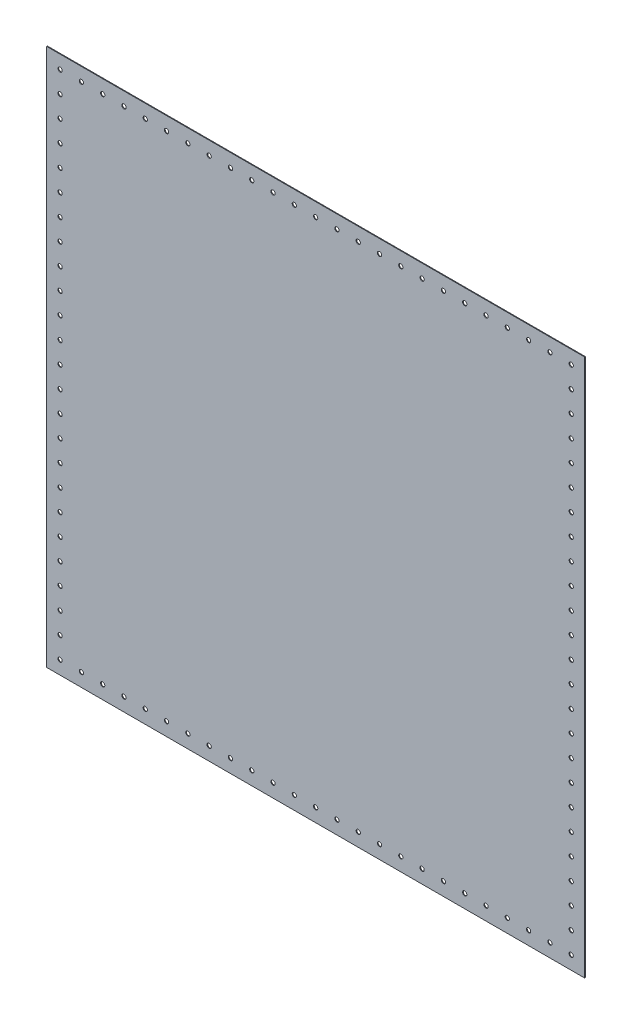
ISO-10303-21;
HEADER;
FILE_DESCRIPTION(('STEP AP214'),'2;1');
FILE_NAME('part.step','',(''),(''),'','','');
FILE_SCHEMA(('AUTOMOTIVE_DESIGN { 1 0 10303 214 1 1 1 1 }'));
ENDSEC;
DATA;
#1=APPLICATION_CONTEXT('core data for automotive mechanical design processes');
#2=APPLICATION_PROTOCOL_DEFINITION('international standard','automotive_design',2000,#1);
#3=PRODUCT_CONTEXT('',#1,'mechanical');
#4=PRODUCT('Part','Part','',(#3));
#5=PRODUCT_RELATED_PRODUCT_CATEGORY('part','',(#4));
#6=PRODUCT_DEFINITION_FORMATION('','',#4);
#7=PRODUCT_DEFINITION_CONTEXT('part definition',#1,'design');
#8=PRODUCT_DEFINITION('design','',#6,#7);
#9=PRODUCT_DEFINITION_SHAPE('','',#8);
#10=(LENGTH_UNIT() NAMED_UNIT(*) SI_UNIT(.MILLI.,.METRE.));
#11=(NAMED_UNIT(*) PLANE_ANGLE_UNIT() SI_UNIT($,.RADIAN.));
#12=(NAMED_UNIT(*) SI_UNIT($,.STERADIAN.) SOLID_ANGLE_UNIT());
#13=UNCERTAINTY_MEASURE_WITH_UNIT(LENGTH_MEASURE(1.E-05),#10,'distance_accuracy_value','');
#14=(GEOMETRIC_REPRESENTATION_CONTEXT(3) GLOBAL_UNCERTAINTY_ASSIGNED_CONTEXT((#13)) GLOBAL_UNIT_ASSIGNED_CONTEXT((#10,
#11,#12)) REPRESENTATION_CONTEXT('',''));
#15=CARTESIAN_POINT('',(0.,0.,0.));
#16=DIRECTION('',(0.,0.,1.));
#17=DIRECTION('',(1.,0.,0.));
#18=AXIS2_PLACEMENT_3D('',#15,#16,#17);
#19=CARTESIAN_POINT('',(-609.4222,609.4222,1.5875));
#20=DIRECTION('',(0.,-1.,0.));
#21=DIRECTION('',(1.,0.,0.));
#22=AXIS2_PLACEMENT_3D('',#19,#20,#21);
#23=PLANE('',#22);
#24=DIRECTION('',(-1.,0.,0.));
#25=VECTOR('',#24,1.);
#26=CARTESIAN_POINT('',(-609.4222,609.4222,0.));
#27=LINE('',#26,#25);
#28=CARTESIAN_POINT('',(609.4222,609.4222,0.));
#29=VERTEX_POINT('',#28);
#30=CARTESIAN_POINT('',(-609.4222,609.4222,0.));
#31=VERTEX_POINT('',#30);
#32=EDGE_CURVE('E106',#29,#31,#27,.T.);
#33=ORIENTED_EDGE('',*,*,#32,.T.);
#34=DIRECTION('',(0.,0.,-1.));
#35=VECTOR('',#34,1.);
#36=CARTESIAN_POINT('',(-609.4222,609.4222,1.5875));
#37=LINE('',#36,#35);
#38=CARTESIAN_POINT('',(-609.4222,609.4222,1.5875));
#39=VERTEX_POINT('',#38);
#40=EDGE_CURVE('E11',#39,#31,#37,.T.);
#41=ORIENTED_EDGE('',*,*,#40,.F.);
#42=DIRECTION('',(-1.,0.,0.));
#43=VECTOR('',#42,1.);
#44=CARTESIAN_POINT('',(-609.4222,609.4222,1.5875));
#45=LINE('',#44,#43);
#46=CARTESIAN_POINT('',(609.4222,609.4222,1.5875));
#47=VERTEX_POINT('',#46);
#48=EDGE_CURVE('E94',#47,#39,#45,.T.);
#49=ORIENTED_EDGE('',*,*,#48,.F.);
#50=DIRECTION('',(0.,0.,-1.));
#51=VECTOR('',#50,1.);
#52=CARTESIAN_POINT('',(609.4222,609.4222,1.5875));
#53=LINE('',#52,#51);
#54=EDGE_CURVE('E105',#47,#29,#53,.T.);
#55=ORIENTED_EDGE('',*,*,#54,.T.);
#56=EDGE_LOOP('',(#33,#41,#49,#55));
#57=FACE_BOUND('',#56,.T.);
#58=ADVANCED_FACE('F43',(#57),#23,.F.);
#59=CARTESIAN_POINT('',(-609.4222,-609.4222,1.5875));
#60=DIRECTION('',(1.,0.,0.));
#61=DIRECTION('',(0.,0.,-1.));
#62=AXIS2_PLACEMENT_3D('',#59,#60,#61);
#63=PLANE('',#62);
#64=DIRECTION('',(0.,-1.,0.));
#65=VECTOR('',#64,1.);
#66=CARTESIAN_POINT('',(-609.4222,-609.4222,0.));
#67=LINE('',#66,#65);
#68=CARTESIAN_POINT('',(-609.4222,-609.4222,0.));
#69=VERTEX_POINT('',#68);
#70=EDGE_CURVE('E98',#31,#69,#67,.T.);
#71=ORIENTED_EDGE('',*,*,#70,.T.);
#72=DIRECTION('',(0.,0.,-1.));
#73=VECTOR('',#72,1.);
#74=CARTESIAN_POINT('',(-609.4222,-609.4222,1.5875));
#75=LINE('',#74,#73);
#76=CARTESIAN_POINT('',(-609.4222,-609.4222,1.5875));
#77=VERTEX_POINT('',#76);
#78=EDGE_CURVE('E51',#77,#69,#75,.T.);
#79=ORIENTED_EDGE('',*,*,#78,.F.);
#80=DIRECTION('',(0.,-1.,0.));
#81=VECTOR('',#80,1.);
#82=CARTESIAN_POINT('',(-609.4222,-609.4222,1.5875));
#83=LINE('',#82,#81);
#84=EDGE_CURVE('E90',#39,#77,#83,.T.);
#85=ORIENTED_EDGE('',*,*,#84,.F.);
#86=ORIENTED_EDGE('',*,*,#40,.T.);
#87=EDGE_LOOP('',(#71,#79,#85,#86));
#88=FACE_BOUND('',#87,.T.);
#89=ADVANCED_FACE('F100',(#88),#63,.F.);
#90=CARTESIAN_POINT('',(-609.4222,-609.4222,1.5875));
#91=DIRECTION('',(0.,1.,0.));
#92=DIRECTION('',(-1.,0.,0.));
#93=AXIS2_PLACEMENT_3D('',#90,#91,#92);
#94=PLANE('',#93);
#95=DIRECTION('',(1.,0.,0.));
#96=VECTOR('',#95,1.);
#97=CARTESIAN_POINT('',(-609.4222,-609.4222,0.));
#98=LINE('',#97,#96);
#99=CARTESIAN_POINT('',(609.4222,-609.4222,0.));
#100=VERTEX_POINT('',#99);
#101=EDGE_CURVE('E79',#69,#100,#98,.T.);
#102=ORIENTED_EDGE('',*,*,#101,.T.);
#103=DIRECTION('',(0.,0.,-1.));
#104=VECTOR('',#103,1.);
#105=CARTESIAN_POINT('',(609.4222,-609.4222,1.5875));
#106=LINE('',#105,#104);
#107=CARTESIAN_POINT('',(609.4222,-609.4222,1.5875));
#108=VERTEX_POINT('',#107);
#109=EDGE_CURVE('E97',#108,#100,#106,.T.);
#110=ORIENTED_EDGE('',*,*,#109,.F.);
#111=DIRECTION('',(1.,0.,0.));
#112=VECTOR('',#111,1.);
#113=CARTESIAN_POINT('',(-609.4222,-609.4222,1.5875));
#114=LINE('',#113,#112);
#115=EDGE_CURVE('E95',#77,#108,#114,.T.);
#116=ORIENTED_EDGE('',*,*,#115,.F.);
#117=ORIENTED_EDGE('',*,*,#78,.T.);
#118=EDGE_LOOP('',(#102,#110,#116,#117));
#119=FACE_BOUND('',#118,.T.);
#120=ADVANCED_FACE('F99',(#119),#94,.F.);
#121=CARTESIAN_POINT('',(609.4222,-609.4222,1.5875));
#122=DIRECTION('',(-1.,0.,0.));
#123=DIRECTION('',(0.,0.,1.));
#124=AXIS2_PLACEMENT_3D('',#121,#122,#123);
#125=PLANE('',#124);
#126=DIRECTION('',(0.,1.,0.));
#127=VECTOR('',#126,1.);
#128=CARTESIAN_POINT('',(609.4222,-609.4222,0.));
#129=LINE('',#128,#127);
#130=EDGE_CURVE('E84',#100,#29,#129,.T.);
#131=ORIENTED_EDGE('',*,*,#130,.T.);
#132=ORIENTED_EDGE('',*,*,#54,.F.);
#133=DIRECTION('',(0.,1.,0.));
#134=VECTOR('',#133,1.);
#135=CARTESIAN_POINT('',(609.4222,-609.4222,1.5875));
#136=LINE('',#135,#134);
#137=EDGE_CURVE('E56',#108,#47,#136,.T.);
#138=ORIENTED_EDGE('',*,*,#137,.F.);
#139=ORIENTED_EDGE('',*,*,#109,.T.);
#140=EDGE_LOOP('',(#131,#132,#138,#139));
#141=FACE_BOUND('',#140,.T.);
#142=ADVANCED_FACE('F111',(#141),#125,.F.);
#143=CARTESIAN_POINT('',(0.,0.,1.5875));
#144=DIRECTION('',(0.,0.,1.));
#145=DIRECTION('',(1.,0.,0.));
#146=AXIS2_PLACEMENT_3D('',#143,#144,#145);
#147=PLANE('',#146);
#148=CARTESIAN_POINT('',(530.86,-579.12,1.5875));
#149=DIRECTION('',(0.,0.,1.));
#150=DIRECTION('',(1.,0.,0.));
#151=AXIS2_PLACEMENT_3D('',#148,#149,#150);
#152=CIRCLE('',#151,4.826);
#153=CARTESIAN_POINT('',(535.686,-579.12,1.5875));
#154=VERTEX_POINT('',#153);
#155=EDGE_CURVE('E368',#154,#154,#152,.T.);
#156=ORIENTED_EDGE('',*,*,#155,.F.);
#157=EDGE_LOOP('',(#156));
#158=FACE_BOUND('',#157,.T.);
#159=CARTESIAN_POINT('',(482.6,-579.12,1.5875));
#160=DIRECTION('',(0.,0.,1.));
#161=DIRECTION('',(1.,0.,0.));
#162=AXIS2_PLACEMENT_3D('',#159,#160,#161);
#163=CIRCLE('',#162,4.826);
#164=CARTESIAN_POINT('',(487.426,-579.12,1.5875));
#165=VERTEX_POINT('',#164);
#166=EDGE_CURVE('E373',#165,#165,#163,.T.);
#167=ORIENTED_EDGE('',*,*,#166,.F.);
#168=EDGE_LOOP('',(#167));
#169=FACE_BOUND('',#168,.T.);
#170=CARTESIAN_POINT('',(579.12,530.86,1.5875));
#171=DIRECTION('',(0.,0.,1.));
#172=DIRECTION('',(1.,0.,0.));
#173=AXIS2_PLACEMENT_3D('',#170,#171,#172);
#174=CIRCLE('',#173,4.826);
#175=CARTESIAN_POINT('',(583.946,530.86,1.5875));
#176=VERTEX_POINT('',#175);
#177=EDGE_CURVE('E377',#176,#176,#174,.T.);
#178=ORIENTED_EDGE('',*,*,#177,.F.);
#179=EDGE_LOOP('',(#178));
#180=FACE_BOUND('',#179,.T.);
#181=CARTESIAN_POINT('',(579.12,579.12,1.5875));
#182=DIRECTION('',(0.,0.,1.));
#183=DIRECTION('',(1.,0.,0.));
#184=AXIS2_PLACEMENT_3D('',#181,#182,#183);
#185=CIRCLE('',#184,4.826);
#186=CARTESIAN_POINT('',(583.946,579.12,1.5875));
#187=VERTEX_POINT('',#186);
#188=EDGE_CURVE('E384',#187,#187,#185,.T.);
#189=ORIENTED_EDGE('',*,*,#188,.F.);
#190=EDGE_LOOP('',(#189));
#191=FACE_BOUND('',#190,.T.);
#192=CARTESIAN_POINT('',(337.82,-579.120000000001,1.5875));
#193=DIRECTION('',(0.,0.,1.));
#194=DIRECTION('',(1.,0.,0.));
#195=AXIS2_PLACEMENT_3D('',#192,#193,#194);
#196=CIRCLE('',#195,4.826);
#197=CARTESIAN_POINT('',(342.646,-579.120000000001,1.5875));
#198=VERTEX_POINT('',#197);
#199=EDGE_CURVE('E394',#198,#198,#196,.T.);
#200=ORIENTED_EDGE('',*,*,#199,.F.);
#201=EDGE_LOOP('',(#200));
#202=FACE_BOUND('',#201,.T.);
#203=CARTESIAN_POINT('',(289.56,-579.120000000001,1.5875));
#204=DIRECTION('',(0.,0.,1.));
#205=DIRECTION('',(1.,0.,0.));
#206=AXIS2_PLACEMENT_3D('',#203,#204,#205);
#207=CIRCLE('',#206,4.826);
#208=CARTESIAN_POINT('',(294.386,-579.120000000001,1.5875));
#209=VERTEX_POINT('',#208);
#210=EDGE_CURVE('E399',#209,#209,#207,.T.);
#211=ORIENTED_EDGE('',*,*,#210,.F.);
#212=EDGE_LOOP('',(#211));
#213=FACE_BOUND('',#212,.T.);
#214=CARTESIAN_POINT('',(434.34,-579.12,1.5875));
#215=DIRECTION('',(0.,0.,1.));
#216=DIRECTION('',(1.,0.,0.));
#217=AXIS2_PLACEMENT_3D('',#214,#215,#216);
#218=CIRCLE('',#217,4.826);
#219=CARTESIAN_POINT('',(439.166,-579.12,1.5875));
#220=VERTEX_POINT('',#219);
#221=EDGE_CURVE('E401',#220,#220,#218,.T.);
#222=ORIENTED_EDGE('',*,*,#221,.F.);
#223=EDGE_LOOP('',(#222));
#224=FACE_BOUND('',#223,.T.);
#225=CARTESIAN_POINT('',(386.08,-579.120000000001,1.5875));
#226=DIRECTION('',(0.,0.,1.));
#227=DIRECTION('',(1.,0.,0.));
#228=AXIS2_PLACEMENT_3D('',#225,#226,#227);
#229=CIRCLE('',#228,4.826);
#230=CARTESIAN_POINT('',(390.906,-579.120000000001,1.5875));
#231=VERTEX_POINT('',#230);
#232=EDGE_CURVE('E408',#231,#231,#229,.T.);
#233=ORIENTED_EDGE('',*,*,#232,.F.);
#234=EDGE_LOOP('',(#233));
#235=FACE_BOUND('',#234,.T.);
#236=CARTESIAN_POINT('',(579.12,241.3,1.5875));
#237=DIRECTION('',(0.,0.,1.));
#238=DIRECTION('',(1.,0.,0.));
#239=AXIS2_PLACEMENT_3D('',#236,#237,#238);
#240=CIRCLE('',#239,4.826);
#241=CARTESIAN_POINT('',(583.946,241.3,1.5875));
#242=VERTEX_POINT('',#241);
#243=EDGE_CURVE('E318',#242,#242,#240,.T.);
#244=ORIENTED_EDGE('',*,*,#243,.F.);
#245=EDGE_LOOP('',(#244));
#246=FACE_BOUND('',#245,.T.);
#247=CARTESIAN_POINT('',(579.12,289.56,1.5875));
#248=DIRECTION('',(0.,0.,1.));
#249=DIRECTION('',(1.,0.,0.));
#250=AXIS2_PLACEMENT_3D('',#247,#248,#249);
#251=CIRCLE('',#250,4.826);
#252=CARTESIAN_POINT('',(583.946,289.56,1.5875));
#253=VERTEX_POINT('',#252);
#254=EDGE_CURVE('E324',#253,#253,#251,.T.);
#255=ORIENTED_EDGE('',*,*,#254,.F.);
#256=EDGE_LOOP('',(#255));
#257=FACE_BOUND('',#256,.T.);
#258=CARTESIAN_POINT('',(579.12,144.78,1.5875));
#259=DIRECTION('',(0.,0.,1.));
#260=DIRECTION('',(1.,0.,0.));
#261=AXIS2_PLACEMENT_3D('',#258,#259,#260);
#262=CIRCLE('',#261,4.826);
#263=CARTESIAN_POINT('',(583.946,144.78,1.5875));
#264=VERTEX_POINT('',#263);
#265=EDGE_CURVE('E332',#264,#264,#262,.T.);
#266=ORIENTED_EDGE('',*,*,#265,.F.);
#267=EDGE_LOOP('',(#266));
#268=FACE_BOUND('',#267,.T.);
#269=CARTESIAN_POINT('',(579.12,193.04,1.5875));
#270=DIRECTION('',(0.,0.,1.));
#271=DIRECTION('',(1.,0.,0.));
#272=AXIS2_PLACEMENT_3D('',#269,#270,#271);
#273=CIRCLE('',#272,4.826);
#274=CARTESIAN_POINT('',(583.946,193.04,1.5875));
#275=VERTEX_POINT('',#274);
#276=EDGE_CURVE('E336',#275,#275,#273,.T.);
#277=ORIENTED_EDGE('',*,*,#276,.F.);
#278=EDGE_LOOP('',(#277));
#279=FACE_BOUND('',#278,.T.);
#280=CARTESIAN_POINT('',(579.12,434.34,1.5875));
#281=DIRECTION('',(0.,0.,1.));
#282=DIRECTION('',(1.,0.,0.));
#283=AXIS2_PLACEMENT_3D('',#280,#281,#282);
#284=CIRCLE('',#283,4.826);
#285=CARTESIAN_POINT('',(583.946,434.34,1.5875));
#286=VERTEX_POINT('',#285);
#287=EDGE_CURVE('E345',#286,#286,#284,.T.);
#288=ORIENTED_EDGE('',*,*,#287,.F.);
#289=EDGE_LOOP('',(#288));
#290=FACE_BOUND('',#289,.T.);
#291=CARTESIAN_POINT('',(579.12,482.6,1.5875));
#292=DIRECTION('',(0.,0.,1.));
#293=DIRECTION('',(1.,0.,0.));
#294=AXIS2_PLACEMENT_3D('',#291,#292,#293);
#295=CIRCLE('',#294,4.826);
#296=CARTESIAN_POINT('',(583.946,482.6,1.5875));
#297=VERTEX_POINT('',#296);
#298=EDGE_CURVE('E349',#297,#297,#295,.T.);
#299=ORIENTED_EDGE('',*,*,#298,.F.);
#300=EDGE_LOOP('',(#299));
#301=FACE_BOUND('',#300,.T.);
#302=CARTESIAN_POINT('',(579.12,337.82,1.5875));
#303=DIRECTION('',(0.,0.,1.));
#304=DIRECTION('',(1.,0.,0.));
#305=AXIS2_PLACEMENT_3D('',#302,#303,#304);
#306=CIRCLE('',#305,4.826);
#307=CARTESIAN_POINT('',(583.946,337.82,1.5875));
#308=VERTEX_POINT('',#307);
#309=EDGE_CURVE('E352',#308,#308,#306,.T.);
#310=ORIENTED_EDGE('',*,*,#309,.F.);
#311=EDGE_LOOP('',(#310));
#312=FACE_BOUND('',#311,.T.);
#313=CARTESIAN_POINT('',(579.12,386.08,1.5875));
#314=DIRECTION('',(0.,0.,1.));
#315=DIRECTION('',(1.,0.,0.));
#316=AXIS2_PLACEMENT_3D('',#313,#314,#315);
#317=CIRCLE('',#316,4.826);
#318=CARTESIAN_POINT('',(583.946,386.08,1.5875));
#319=VERTEX_POINT('',#318);
#320=EDGE_CURVE('E363',#319,#319,#317,.T.);
#321=ORIENTED_EDGE('',*,*,#320,.F.);
#322=EDGE_LOOP('',(#321));
#323=FACE_BOUND('',#322,.T.);
#324=CARTESIAN_POINT('',(579.12,-193.04,1.5875));
#325=DIRECTION('',(0.,0.,1.));
#326=DIRECTION('',(1.,0.,0.));
#327=AXIS2_PLACEMENT_3D('',#324,#325,#326);
#328=CIRCLE('',#327,4.826);
#329=CARTESIAN_POINT('',(583.946,-193.04,1.5875));
#330=VERTEX_POINT('',#329);
#331=EDGE_CURVE('E475',#330,#330,#328,.T.);
#332=ORIENTED_EDGE('',*,*,#331,.F.);
#333=EDGE_LOOP('',(#332));
#334=FACE_BOUND('',#333,.T.);
#335=CARTESIAN_POINT('',(579.12,48.26,1.5875));
#336=DIRECTION('',(0.,0.,1.));
#337=DIRECTION('',(1.,0.,0.));
#338=AXIS2_PLACEMENT_3D('',#335,#336,#337);
#339=CIRCLE('',#338,4.826);
#340=CARTESIAN_POINT('',(583.946,48.26,1.5875));
#341=VERTEX_POINT('',#340);
#342=EDGE_CURVE('E481',#341,#341,#339,.T.);
#343=ORIENTED_EDGE('',*,*,#342,.F.);
#344=EDGE_LOOP('',(#343));
#345=FACE_BOUND('',#344,.T.);
#346=CARTESIAN_POINT('',(579.12,96.5200000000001,1.5875));
#347=DIRECTION('',(0.,0.,1.));
#348=DIRECTION('',(1.,0.,0.));
#349=AXIS2_PLACEMENT_3D('',#346,#347,#348);
#350=CIRCLE('',#349,4.826);
#351=CARTESIAN_POINT('',(583.946,96.5200000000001,1.5875));
#352=VERTEX_POINT('',#351);
#353=EDGE_CURVE('E461',#352,#352,#350,.T.);
#354=ORIENTED_EDGE('',*,*,#353,.F.);
#355=EDGE_LOOP('',(#354));
#356=FACE_BOUND('',#355,.T.);
#357=CARTESIAN_POINT('',(579.12,-48.26,1.5875));
#358=DIRECTION('',(0.,0.,1.));
#359=DIRECTION('',(1.,0.,0.));
#360=AXIS2_PLACEMENT_3D('',#357,#358,#359);
#361=CIRCLE('',#360,4.826);
#362=CARTESIAN_POINT('',(583.946,-48.26,1.5875));
#363=VERTEX_POINT('',#362);
#364=EDGE_CURVE('E466',#363,#363,#361,.T.);
#365=ORIENTED_EDGE('',*,*,#364,.F.);
#366=EDGE_LOOP('',(#365));
#367=FACE_BOUND('',#366,.T.);
#368=CARTESIAN_POINT('',(-579.119999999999,386.08,1.5875));
#369=DIRECTION('',(0.,0.,1.));
#370=DIRECTION('',(1.,0.,0.));
#371=AXIS2_PLACEMENT_3D('',#368,#369,#370);
#372=CIRCLE('',#371,4.826);
#373=CARTESIAN_POINT('',(-574.293999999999,386.08,1.5875));
#374=VERTEX_POINT('',#373);
#375=EDGE_CURVE('E499',#374,#374,#372,.T.);
#376=ORIENTED_EDGE('',*,*,#375,.F.);
#377=EDGE_LOOP('',(#376));
#378=FACE_BOUND('',#377,.T.);
#379=CARTESIAN_POINT('',(579.12,-144.78,1.5875));
#380=DIRECTION('',(0.,0.,1.));
#381=DIRECTION('',(1.,0.,0.));
#382=AXIS2_PLACEMENT_3D('',#379,#380,#381);
#383=CIRCLE('',#382,4.826);
#384=CARTESIAN_POINT('',(583.946,-144.78,1.5875));
#385=VERTEX_POINT('',#384);
#386=EDGE_CURVE('E502',#385,#385,#383,.T.);
#387=ORIENTED_EDGE('',*,*,#386,.F.);
#388=EDGE_LOOP('',(#387));
#389=FACE_BOUND('',#388,.T.);
#390=CARTESIAN_POINT('',(579.12,-96.52,1.5875));
#391=DIRECTION('',(0.,0.,1.));
#392=DIRECTION('',(1.,0.,0.));
#393=AXIS2_PLACEMENT_3D('',#390,#391,#392);
#394=CIRCLE('',#393,4.826);
#395=CARTESIAN_POINT('',(583.946,-96.52,1.5875));
#396=VERTEX_POINT('',#395);
#397=EDGE_CURVE('E486',#396,#396,#394,.T.);
#398=ORIENTED_EDGE('',*,*,#397,.F.);
#399=EDGE_LOOP('',(#398));
#400=FACE_BOUND('',#399,.T.);
#401=CARTESIAN_POINT('',(579.12,-241.3,1.5875));
#402=DIRECTION('',(0.,0.,1.));
#403=DIRECTION('',(1.,0.,0.));
#404=AXIS2_PLACEMENT_3D('',#401,#402,#403);
#405=CIRCLE('',#404,4.826);
#406=CARTESIAN_POINT('',(583.946,-241.3,1.5875));
#407=VERTEX_POINT('',#406);
#408=EDGE_CURVE('E492',#407,#407,#405,.T.);
#409=ORIENTED_EDGE('',*,*,#408,.F.);
#410=EDGE_LOOP('',(#409));
#411=FACE_BOUND('',#410,.T.);
#412=CARTESIAN_POINT('',(579.12,-386.08,1.5875));
#413=DIRECTION('',(0.,0.,1.));
#414=DIRECTION('',(1.,0.,0.));
#415=AXIS2_PLACEMENT_3D('',#412,#413,#414);
#416=CIRCLE('',#415,4.826);
#417=CARTESIAN_POINT('',(583.946,-386.08,1.5875));
#418=VERTEX_POINT('',#417);
#419=EDGE_CURVE('E433',#418,#418,#416,.T.);
#420=ORIENTED_EDGE('',*,*,#419,.F.);
#421=EDGE_LOOP('',(#420));
#422=FACE_BOUND('',#421,.T.);
#423=CARTESIAN_POINT('',(579.12,-434.34,1.5875));
#424=DIRECTION('',(0.,0.,1.));
#425=DIRECTION('',(1.,0.,0.));
#426=AXIS2_PLACEMENT_3D('',#423,#424,#425);
#427=CIRCLE('',#426,4.826);
#428=CARTESIAN_POINT('',(583.946,-434.34,1.5875));
#429=VERTEX_POINT('',#428);
#430=EDGE_CURVE('E430',#429,#429,#427,.T.);
#431=ORIENTED_EDGE('',*,*,#430,.F.);
#432=EDGE_LOOP('',(#431));
#433=FACE_BOUND('',#432,.T.);
#434=CARTESIAN_POINT('',(579.12,-289.56,1.5875));
#435=DIRECTION('',(0.,0.,1.));
#436=DIRECTION('',(1.,0.,0.));
#437=AXIS2_PLACEMENT_3D('',#434,#435,#436);
#438=CIRCLE('',#437,4.826);
#439=CARTESIAN_POINT('',(583.946,-289.56,1.5875));
#440=VERTEX_POINT('',#439);
#441=EDGE_CURVE('E423',#440,#440,#438,.T.);
#442=ORIENTED_EDGE('',*,*,#441,.F.);
#443=EDGE_LOOP('',(#442));
#444=FACE_BOUND('',#443,.T.);
#445=CARTESIAN_POINT('',(579.12,-337.82,1.5875));
#446=DIRECTION('',(0.,0.,1.));
#447=DIRECTION('',(1.,0.,0.));
#448=AXIS2_PLACEMENT_3D('',#445,#446,#447);
#449=CIRCLE('',#448,4.826);
#450=CARTESIAN_POINT('',(583.946,-337.82,1.5875));
#451=VERTEX_POINT('',#450);
#452=EDGE_CURVE('E411',#451,#451,#449,.T.);
#453=ORIENTED_EDGE('',*,*,#452,.F.);
#454=EDGE_LOOP('',(#453));
#455=FACE_BOUND('',#454,.T.);
#456=CARTESIAN_POINT('',(579.12,0.,1.5875));
#457=DIRECTION('',(0.,0.,1.));
#458=DIRECTION('',(1.,0.,0.));
#459=AXIS2_PLACEMENT_3D('',#456,#457,#458);
#460=CIRCLE('',#459,4.826);
#461=CARTESIAN_POINT('',(583.946,0.,1.5875));
#462=VERTEX_POINT('',#461);
#463=EDGE_CURVE('E447',#462,#462,#460,.T.);
#464=ORIENTED_EDGE('',*,*,#463,.F.);
#465=EDGE_LOOP('',(#464));
#466=FACE_BOUND('',#465,.T.);
#467=CARTESIAN_POINT('',(579.12,-530.86,1.5875));
#468=DIRECTION('',(0.,0.,1.));
#469=DIRECTION('',(1.,0.,0.));
#470=AXIS2_PLACEMENT_3D('',#467,#468,#469);
#471=CIRCLE('',#470,4.826);
#472=CARTESIAN_POINT('',(583.946,-530.86,1.5875));
#473=VERTEX_POINT('',#472);
#474=EDGE_CURVE('E460',#473,#473,#471,.T.);
#475=ORIENTED_EDGE('',*,*,#474,.F.);
#476=EDGE_LOOP('',(#475));
#477=FACE_BOUND('',#476,.T.);
#478=CARTESIAN_POINT('',(579.12,-482.6,1.5875));
#479=DIRECTION('',(0.,0.,1.));
#480=DIRECTION('',(1.,0.,0.));
#481=AXIS2_PLACEMENT_3D('',#478,#479,#480);
#482=CIRCLE('',#481,4.826);
#483=CARTESIAN_POINT('',(583.946,-482.6,1.5875));
#484=VERTEX_POINT('',#483);
#485=EDGE_CURVE('E437',#484,#484,#482,.T.);
#486=ORIENTED_EDGE('',*,*,#485,.F.);
#487=EDGE_LOOP('',(#486));
#488=FACE_BOUND('',#487,.T.);
#489=CARTESIAN_POINT('',(-579.12,579.12,1.5875));
#490=DIRECTION('',(0.,0.,1.));
#491=DIRECTION('',(1.,0.,0.));
#492=AXIS2_PLACEMENT_3D('',#489,#490,#491);
#493=CIRCLE('',#492,4.826);
#494=CARTESIAN_POINT('',(-574.294,579.12,1.5875));
#495=VERTEX_POINT('',#494);
#496=EDGE_CURVE('E443',#495,#495,#493,.T.);
#497=ORIENTED_EDGE('',*,*,#496,.F.);
#498=EDGE_LOOP('',(#497));
#499=FACE_BOUND('',#498,.T.);
#500=CARTESIAN_POINT('',(-579.119999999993,-386.08,1.5875));
#501=DIRECTION('',(0.,0.,1.));
#502=DIRECTION('',(1.,0.,0.));
#503=AXIS2_PLACEMENT_3D('',#500,#501,#502);
#504=CIRCLE('',#503,4.826);
#505=CARTESIAN_POINT('',(-574.293999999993,-386.08,1.5875));
#506=VERTEX_POINT('',#505);
#507=EDGE_CURVE('E166',#506,#506,#504,.T.);
#508=ORIENTED_EDGE('',*,*,#507,.F.);
#509=EDGE_LOOP('',(#508));
#510=FACE_BOUND('',#509,.T.);
#511=CARTESIAN_POINT('',(-579.119999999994,-337.82,1.5875));
#512=DIRECTION('',(0.,0.,1.));
#513=DIRECTION('',(1.,0.,0.));
#514=AXIS2_PLACEMENT_3D('',#511,#512,#513);
#515=CIRCLE('',#514,4.826);
#516=CARTESIAN_POINT('',(-574.293999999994,-337.82,1.5875));
#517=VERTEX_POINT('',#516);
#518=EDGE_CURVE('E162',#517,#517,#515,.T.);
#519=ORIENTED_EDGE('',*,*,#518,.F.);
#520=EDGE_LOOP('',(#519));
#521=FACE_BOUND('',#520,.T.);
#522=CARTESIAN_POINT('',(-579.119999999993,-482.6,1.5875));
#523=DIRECTION('',(0.,0.,1.));
#524=DIRECTION('',(1.,0.,0.));
#525=AXIS2_PLACEMENT_3D('',#522,#523,#524);
#526=CIRCLE('',#525,4.826);
#527=CARTESIAN_POINT('',(-574.293999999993,-482.6,1.5875));
#528=VERTEX_POINT('',#527);
#529=EDGE_CURVE('E160',#528,#528,#526,.T.);
#530=ORIENTED_EDGE('',*,*,#529,.F.);
#531=EDGE_LOOP('',(#530));
#532=FACE_BOUND('',#531,.T.);
#533=CARTESIAN_POINT('',(-579.119999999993,-434.34,1.5875));
#534=DIRECTION('',(0.,0.,1.));
#535=DIRECTION('',(1.,0.,0.));
#536=AXIS2_PLACEMENT_3D('',#533,#534,#535);
#537=CIRCLE('',#536,4.826);
#538=CARTESIAN_POINT('',(-574.293999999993,-434.34,1.5875));
#539=VERTEX_POINT('',#538);
#540=EDGE_CURVE('E151',#539,#539,#537,.T.);
#541=ORIENTED_EDGE('',*,*,#540,.F.);
#542=EDGE_LOOP('',(#541));
#543=FACE_BOUND('',#542,.T.);
#544=CARTESIAN_POINT('',(-579.119999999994,-193.04,1.5875));
#545=DIRECTION('',(0.,0.,1.));
#546=DIRECTION('',(1.,0.,0.));
#547=AXIS2_PLACEMENT_3D('',#544,#545,#546);
#548=CIRCLE('',#547,4.826);
#549=CARTESIAN_POINT('',(-574.293999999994,-193.04,1.5875));
#550=VERTEX_POINT('',#549);
#551=EDGE_CURVE('E144',#550,#550,#548,.T.);
#552=ORIENTED_EDGE('',*,*,#551,.F.);
#553=EDGE_LOOP('',(#552));
#554=FACE_BOUND('',#553,.T.);
#555=CARTESIAN_POINT('',(-579.119999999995,-144.78,1.5875));
#556=DIRECTION('',(0.,0.,1.));
#557=DIRECTION('',(1.,0.,0.));
#558=AXIS2_PLACEMENT_3D('',#555,#556,#557);
#559=CIRCLE('',#558,4.826);
#560=CARTESIAN_POINT('',(-574.293999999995,-144.78,1.5875));
#561=VERTEX_POINT('',#560);
#562=EDGE_CURVE('E136',#561,#561,#559,.T.);
#563=ORIENTED_EDGE('',*,*,#562,.F.);
#564=EDGE_LOOP('',(#563));
#565=FACE_BOUND('',#564,.T.);
#566=CARTESIAN_POINT('',(-579.119999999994,-289.56,1.5875));
#567=DIRECTION('',(0.,0.,1.));
#568=DIRECTION('',(1.,0.,0.));
#569=AXIS2_PLACEMENT_3D('',#566,#567,#568);
#570=CIRCLE('',#569,4.826);
#571=CARTESIAN_POINT('',(-574.293999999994,-289.56,1.5875));
#572=VERTEX_POINT('',#571);
#573=EDGE_CURVE('E135',#572,#572,#570,.T.);
#574=ORIENTED_EDGE('',*,*,#573,.F.);
#575=EDGE_LOOP('',(#574));
#576=FACE_BOUND('',#575,.T.);
#577=CARTESIAN_POINT('',(-579.119999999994,-241.3,1.5875));
#578=DIRECTION('',(0.,0.,1.));
#579=DIRECTION('',(1.,0.,0.));
#580=AXIS2_PLACEMENT_3D('',#577,#578,#579);
#581=CIRCLE('',#580,4.826);
#582=CARTESIAN_POINT('',(-574.293999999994,-241.3,1.5875));
#583=VERTEX_POINT('',#582);
#584=EDGE_CURVE('E127',#583,#583,#581,.T.);
#585=ORIENTED_EDGE('',*,*,#584,.F.);
#586=EDGE_LOOP('',(#585));
#587=FACE_BOUND('',#586,.T.);
#588=CARTESIAN_POINT('',(-337.82,579.120000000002,1.5875));
#589=DIRECTION('',(0.,0.,1.));
#590=DIRECTION('',(1.,0.,0.));
#591=AXIS2_PLACEMENT_3D('',#588,#589,#590);
#592=CIRCLE('',#591,4.82600000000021);
#593=CARTESIAN_POINT('',(-332.994,579.120000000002,1.5875));
#594=VERTEX_POINT('',#593);
#595=EDGE_CURVE('E218',#594,#594,#592,.T.);
#596=ORIENTED_EDGE('',*,*,#595,.F.);
#597=EDGE_LOOP('',(#596));
#598=FACE_BOUND('',#597,.T.);
#599=CARTESIAN_POINT('',(-386.08,579.120000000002,1.5875));
#600=DIRECTION('',(0.,0.,1.));
#601=DIRECTION('',(1.,0.,0.));
#602=AXIS2_PLACEMENT_3D('',#599,#600,#601);
#603=CIRCLE('',#602,4.826);
#604=CARTESIAN_POINT('',(-381.254,579.120000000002,1.5875));
#605=VERTEX_POINT('',#604);
#606=EDGE_CURVE('E213',#605,#605,#603,.T.);
#607=ORIENTED_EDGE('',*,*,#606,.F.);
#608=EDGE_LOOP('',(#607));
#609=FACE_BOUND('',#608,.T.);
#610=CARTESIAN_POINT('',(-241.3,579.120000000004,1.5875));
#611=DIRECTION('',(0.,0.,1.));
#612=DIRECTION('',(1.,0.,0.));
#613=AXIS2_PLACEMENT_3D('',#610,#611,#612);
#614=CIRCLE('',#613,4.826);
#615=CARTESIAN_POINT('',(-236.474,579.120000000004,1.5875));
#616=VERTEX_POINT('',#615);
#617=EDGE_CURVE('E210',#616,#616,#614,.T.);
#618=ORIENTED_EDGE('',*,*,#617,.F.);
#619=EDGE_LOOP('',(#618));
#620=FACE_BOUND('',#619,.T.);
#621=CARTESIAN_POINT('',(-289.56,579.120000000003,1.5875));
#622=DIRECTION('',(0.,0.,1.));
#623=DIRECTION('',(1.,0.,0.));
#624=AXIS2_PLACEMENT_3D('',#621,#622,#623);
#625=CIRCLE('',#624,4.82600000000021);
#626=CARTESIAN_POINT('',(-284.734,579.120000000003,1.5875));
#627=VERTEX_POINT('',#626);
#628=EDGE_CURVE('E203',#627,#627,#625,.T.);
#629=ORIENTED_EDGE('',*,*,#628,.F.);
#630=EDGE_LOOP('',(#629));
#631=FACE_BOUND('',#630,.T.);
#632=CARTESIAN_POINT('',(-530.86,579.120000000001,1.5875));
#633=DIRECTION('',(0.,0.,1.));
#634=DIRECTION('',(1.,0.,0.));
#635=AXIS2_PLACEMENT_3D('',#632,#633,#634);
#636=CIRCLE('',#635,4.82599999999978);
#637=CARTESIAN_POINT('',(-526.034,579.120000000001,1.5875));
#638=VERTEX_POINT('',#637);
#639=EDGE_CURVE('E193',#638,#638,#636,.T.);
#640=ORIENTED_EDGE('',*,*,#639,.F.);
#641=EDGE_LOOP('',(#640));
#642=FACE_BOUND('',#641,.T.);
#643=CARTESIAN_POINT('',(-579.119999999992,-530.86,1.5875));
#644=DIRECTION('',(0.,0.,1.));
#645=DIRECTION('',(1.,0.,0.));
#646=AXIS2_PLACEMENT_3D('',#643,#644,#645);
#647=CIRCLE('',#646,4.826);
#648=CARTESIAN_POINT('',(-574.293999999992,-530.86,1.5875));
#649=VERTEX_POINT('',#648);
#650=EDGE_CURVE('E188',#649,#649,#647,.T.);
#651=ORIENTED_EDGE('',*,*,#650,.F.);
#652=EDGE_LOOP('',(#651));
#653=FACE_BOUND('',#652,.T.);
#654=CARTESIAN_POINT('',(-434.34,579.120000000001,1.5875));
#655=DIRECTION('',(0.,0.,1.));
#656=DIRECTION('',(1.,0.,0.));
#657=AXIS2_PLACEMENT_3D('',#654,#655,#656);
#658=CIRCLE('',#657,4.826);
#659=CARTESIAN_POINT('',(-429.514,579.120000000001,1.5875));
#660=VERTEX_POINT('',#659);
#661=EDGE_CURVE('E181',#660,#660,#658,.T.);
#662=ORIENTED_EDGE('',*,*,#661,.F.);
#663=EDGE_LOOP('',(#662));
#664=FACE_BOUND('',#663,.T.);
#665=CARTESIAN_POINT('',(-482.6,579.120000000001,1.5875));
#666=DIRECTION('',(0.,0.,1.));
#667=DIRECTION('',(1.,0.,0.));
#668=AXIS2_PLACEMENT_3D('',#665,#666,#667);
#669=CIRCLE('',#668,4.82599999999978);
#670=CARTESIAN_POINT('',(-477.774,579.120000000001,1.5875));
#671=VERTEX_POINT('',#670);
#672=EDGE_CURVE('E177',#671,#671,#669,.T.);
#673=ORIENTED_EDGE('',*,*,#672,.F.);
#674=EDGE_LOOP('',(#673));
#675=FACE_BOUND('',#674,.T.);
#676=CARTESIAN_POINT('',(289.56,579.120000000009,1.5875));
#677=DIRECTION('',(0.,0.,1.));
#678=DIRECTION('',(1.,0.,0.));
#679=AXIS2_PLACEMENT_3D('',#676,#677,#678);
#680=CIRCLE('',#679,4.82599999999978);
#681=CARTESIAN_POINT('',(294.386,579.120000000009,1.5875));
#682=VERTEX_POINT('',#681);
#683=EDGE_CURVE('E172',#682,#682,#680,.T.);
#684=ORIENTED_EDGE('',*,*,#683,.F.);
#685=EDGE_LOOP('',(#684));
#686=FACE_BOUND('',#685,.T.);
#687=CARTESIAN_POINT('',(337.82,579.12000000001,1.5875));
#688=DIRECTION('',(0.,0.,1.));
#689=DIRECTION('',(1.,0.,0.));
#690=AXIS2_PLACEMENT_3D('',#687,#688,#689);
#691=CIRCLE('',#690,4.826);
#692=CARTESIAN_POINT('',(342.646,579.12000000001,1.5875));
#693=VERTEX_POINT('',#692);
#694=EDGE_CURVE('E228',#693,#693,#691,.T.);
#695=ORIENTED_EDGE('',*,*,#694,.F.);
#696=EDGE_LOOP('',(#695));
#697=FACE_BOUND('',#696,.T.);
#698=CARTESIAN_POINT('',(193.04,579.120000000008,1.5875));
#699=DIRECTION('',(0.,0.,1.));
#700=DIRECTION('',(1.,0.,0.));
#701=AXIS2_PLACEMENT_3D('',#698,#699,#700);
#702=CIRCLE('',#701,4.826);
#703=CARTESIAN_POINT('',(197.866,579.120000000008,1.5875));
#704=VERTEX_POINT('',#703);
#705=EDGE_CURVE('E233',#704,#704,#702,.T.);
#706=ORIENTED_EDGE('',*,*,#705,.F.);
#707=EDGE_LOOP('',(#706));
#708=FACE_BOUND('',#707,.T.);
#709=CARTESIAN_POINT('',(241.3,579.120000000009,1.5875));
#710=DIRECTION('',(0.,0.,1.));
#711=DIRECTION('',(1.,0.,0.));
#712=AXIS2_PLACEMENT_3D('',#709,#710,#711);
#713=CIRCLE('',#712,4.82599999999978);
#714=CARTESIAN_POINT('',(246.126,579.120000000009,1.5875));
#715=VERTEX_POINT('',#714);
#716=EDGE_CURVE('E244',#715,#715,#713,.T.);
#717=ORIENTED_EDGE('',*,*,#716,.F.);
#718=EDGE_LOOP('',(#717));
#719=FACE_BOUND('',#718,.T.);
#720=CARTESIAN_POINT('',(482.6,579.120000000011,1.5875));
#721=DIRECTION('',(0.,0.,1.));
#722=DIRECTION('',(1.,0.,0.));
#723=AXIS2_PLACEMENT_3D('',#720,#721,#722);
#724=CIRCLE('',#723,4.826);
#725=CARTESIAN_POINT('',(487.426,579.120000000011,1.5875));
#726=VERTEX_POINT('',#725);
#727=EDGE_CURVE('E249',#726,#726,#724,.T.);
#728=ORIENTED_EDGE('',*,*,#727,.F.);
#729=EDGE_LOOP('',(#728));
#730=FACE_BOUND('',#729,.T.);
#731=CARTESIAN_POINT('',(530.86,579.120000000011,1.5875));
#732=DIRECTION('',(0.,0.,1.));
#733=DIRECTION('',(1.,0.,0.));
#734=AXIS2_PLACEMENT_3D('',#731,#732,#733);
#735=CIRCLE('',#734,4.826);
#736=CARTESIAN_POINT('',(535.686,579.120000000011,1.5875));
#737=VERTEX_POINT('',#736);
#738=EDGE_CURVE('E251',#737,#737,#735,.T.);
#739=ORIENTED_EDGE('',*,*,#738,.F.);
#740=EDGE_LOOP('',(#739));
#741=FACE_BOUND('',#740,.T.);
#742=CARTESIAN_POINT('',(386.08,579.12000000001,1.5875));
#743=DIRECTION('',(0.,0.,1.));
#744=DIRECTION('',(1.,0.,0.));
#745=AXIS2_PLACEMENT_3D('',#742,#743,#744);
#746=CIRCLE('',#745,4.82600000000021);
#747=CARTESIAN_POINT('',(390.906,579.12000000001,1.5875));
#748=VERTEX_POINT('',#747);
#749=EDGE_CURVE('E259',#748,#748,#746,.T.);
#750=ORIENTED_EDGE('',*,*,#749,.F.);
#751=EDGE_LOOP('',(#750));
#752=FACE_BOUND('',#751,.T.);
#753=CARTESIAN_POINT('',(434.34,579.12000000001,1.5875));
#754=DIRECTION('',(0.,0.,1.));
#755=DIRECTION('',(1.,0.,0.));
#756=AXIS2_PLACEMENT_3D('',#753,#754,#755);
#757=CIRCLE('',#756,4.82600000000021);
#758=CARTESIAN_POINT('',(439.166,579.12000000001,1.5875));
#759=VERTEX_POINT('',#758);
#760=EDGE_CURVE('E264',#759,#759,#757,.T.);
#761=ORIENTED_EDGE('',*,*,#760,.F.);
#762=EDGE_LOOP('',(#761));
#763=FACE_BOUND('',#762,.T.);
#764=CARTESIAN_POINT('',(-96.5200000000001,579.120000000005,1.5875));
#765=DIRECTION('',(0.,0.,1.));
#766=DIRECTION('',(1.,0.,0.));
#767=AXIS2_PLACEMENT_3D('',#764,#765,#766);
#768=CIRCLE('',#767,4.82599999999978);
#769=CARTESIAN_POINT('',(-91.6940000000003,579.120000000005,1.5875));
#770=VERTEX_POINT('',#769);
#771=EDGE_CURVE('E271',#770,#770,#768,.T.);
#772=ORIENTED_EDGE('',*,*,#771,.F.);
#773=EDGE_LOOP('',(#772));
#774=FACE_BOUND('',#773,.T.);
#775=CARTESIAN_POINT('',(-48.26,579.120000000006,1.5875));
#776=DIRECTION('',(0.,0.,1.));
#777=DIRECTION('',(1.,0.,0.));
#778=AXIS2_PLACEMENT_3D('',#775,#776,#777);
#779=CIRCLE('',#778,4.826);
#780=CARTESIAN_POINT('',(-43.434,579.120000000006,1.5875));
#781=VERTEX_POINT('',#780);
#782=EDGE_CURVE('E280',#781,#781,#779,.T.);
#783=ORIENTED_EDGE('',*,*,#782,.F.);
#784=EDGE_LOOP('',(#783));
#785=FACE_BOUND('',#784,.T.);
#786=CARTESIAN_POINT('',(-193.04,579.120000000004,1.5875));
#787=DIRECTION('',(0.,0.,1.));
#788=DIRECTION('',(1.,0.,0.));
#789=AXIS2_PLACEMENT_3D('',#786,#787,#788);
#790=CIRCLE('',#789,4.826);
#791=CARTESIAN_POINT('',(-188.214,579.120000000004,1.5875));
#792=VERTEX_POINT('',#791);
#793=EDGE_CURVE('E285',#792,#792,#790,.T.);
#794=ORIENTED_EDGE('',*,*,#793,.F.);
#795=EDGE_LOOP('',(#794));
#796=FACE_BOUND('',#795,.T.);
#797=CARTESIAN_POINT('',(-144.78,579.120000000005,1.5875));
#798=DIRECTION('',(0.,0.,1.));
#799=DIRECTION('',(1.,0.,0.));
#800=AXIS2_PLACEMENT_3D('',#797,#798,#799);
#801=CIRCLE('',#800,4.82599999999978);
#802=CARTESIAN_POINT('',(-139.954,579.120000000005,1.5875));
#803=VERTEX_POINT('',#802);
#804=EDGE_CURVE('E286',#803,#803,#801,.T.);
#805=ORIENTED_EDGE('',*,*,#804,.F.);
#806=EDGE_LOOP('',(#805));
#807=FACE_BOUND('',#806,.T.);
#808=CARTESIAN_POINT('',(96.5200000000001,579.120000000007,1.5875));
#809=DIRECTION('',(0.,0.,1.));
#810=DIRECTION('',(1.,0.,0.));
#811=AXIS2_PLACEMENT_3D('',#808,#809,#810);
#812=CIRCLE('',#811,4.82600000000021);
#813=CARTESIAN_POINT('',(101.346,579.120000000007,1.5875));
#814=VERTEX_POINT('',#813);
#815=EDGE_CURVE('E293',#814,#814,#812,.T.);
#816=ORIENTED_EDGE('',*,*,#815,.F.);
#817=EDGE_LOOP('',(#816));
#818=FACE_BOUND('',#817,.T.);
#819=CARTESIAN_POINT('',(144.78,579.120000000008,1.5875));
#820=DIRECTION('',(0.,0.,1.));
#821=DIRECTION('',(1.,0.,0.));
#822=AXIS2_PLACEMENT_3D('',#819,#820,#821);
#823=CIRCLE('',#822,4.826);
#824=CARTESIAN_POINT('',(149.606,579.120000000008,1.5875));
#825=VERTEX_POINT('',#824);
#826=EDGE_CURVE('E302',#825,#825,#823,.T.);
#827=ORIENTED_EDGE('',*,*,#826,.F.);
#828=EDGE_LOOP('',(#827));
#829=FACE_BOUND('',#828,.T.);
#830=CARTESIAN_POINT('',(0.,579.120000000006,1.5875));
#831=DIRECTION('',(0.,0.,1.));
#832=DIRECTION('',(1.,0.,0.));
#833=AXIS2_PLACEMENT_3D('',#830,#831,#832);
#834=CIRCLE('',#833,4.826);
#835=CARTESIAN_POINT('',(4.826,579.120000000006,1.5875));
#836=VERTEX_POINT('',#835);
#837=EDGE_CURVE('E307',#836,#836,#834,.T.);
#838=ORIENTED_EDGE('',*,*,#837,.F.);
#839=EDGE_LOOP('',(#838));
#840=FACE_BOUND('',#839,.T.);
#841=CARTESIAN_POINT('',(48.26,579.120000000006,1.5875));
#842=DIRECTION('',(0.,0.,1.));
#843=DIRECTION('',(1.,0.,0.));
#844=AXIS2_PLACEMENT_3D('',#841,#842,#843);
#845=CIRCLE('',#844,4.82600000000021);
#846=CARTESIAN_POINT('',(53.0860000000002,579.120000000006,1.5875));
#847=VERTEX_POINT('',#846);
#848=EDGE_CURVE('E311',#847,#847,#845,.T.);
#849=ORIENTED_EDGE('',*,*,#848,.F.);
#850=EDGE_LOOP('',(#849));
#851=FACE_BOUND('',#850,.T.);
#852=CARTESIAN_POINT('',(241.3,-579.120000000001,1.5875));
#853=DIRECTION('',(0.,0.,1.));
#854=DIRECTION('',(1.,0.,0.));
#855=AXIS2_PLACEMENT_3D('',#852,#853,#854);
#856=CIRCLE('',#855,4.826);
#857=CARTESIAN_POINT('',(246.126,-579.120000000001,1.5875));
#858=VERTEX_POINT('',#857);
#859=EDGE_CURVE('E637',#858,#858,#856,.T.);
#860=ORIENTED_EDGE('',*,*,#859,.F.);
#861=EDGE_LOOP('',(#860));
#862=FACE_BOUND('',#861,.T.);
#863=CARTESIAN_POINT('',(96.52,-579.120000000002,1.5875));
#864=DIRECTION('',(0.,0.,1.));
#865=DIRECTION('',(1.,0.,0.));
#866=AXIS2_PLACEMENT_3D('',#863,#864,#865);
#867=CIRCLE('',#866,4.826);
#868=CARTESIAN_POINT('',(101.346,-579.120000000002,1.5875));
#869=VERTEX_POINT('',#868);
#870=EDGE_CURVE('E627',#869,#869,#867,.T.);
#871=ORIENTED_EDGE('',*,*,#870,.F.);
#872=EDGE_LOOP('',(#871));
#873=FACE_BOUND('',#872,.T.);
#874=CARTESIAN_POINT('',(144.78,-579.120000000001,1.5875));
#875=DIRECTION('',(0.,0.,1.));
#876=DIRECTION('',(1.,0.,0.));
#877=AXIS2_PLACEMENT_3D('',#874,#875,#876);
#878=CIRCLE('',#877,4.826);
#879=CARTESIAN_POINT('',(149.606,-579.120000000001,1.5875));
#880=VERTEX_POINT('',#879);
#881=EDGE_CURVE('E647',#880,#880,#878,.T.);
#882=ORIENTED_EDGE('',*,*,#881,.F.);
#883=EDGE_LOOP('',(#882));
#884=FACE_BOUND('',#883,.T.);
#885=CARTESIAN_POINT('',(-386.08,-579.120000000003,1.5875));
#886=DIRECTION('',(0.,0.,1.));
#887=DIRECTION('',(1.,0.,0.));
#888=AXIS2_PLACEMENT_3D('',#885,#886,#887);
#889=CIRCLE('',#888,4.826);
#890=CARTESIAN_POINT('',(-381.254,-579.120000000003,1.5875));
#891=VERTEX_POINT('',#890);
#892=EDGE_CURVE('E645',#891,#891,#889,.T.);
#893=ORIENTED_EDGE('',*,*,#892,.F.);
#894=EDGE_LOOP('',(#893));
#895=FACE_BOUND('',#894,.T.);
#896=CARTESIAN_POINT('',(48.26,-579.120000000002,1.5875));
#897=DIRECTION('',(0.,0.,1.));
#898=DIRECTION('',(1.,0.,0.));
#899=AXIS2_PLACEMENT_3D('',#896,#897,#898);
#900=CIRCLE('',#899,4.826);
#901=CARTESIAN_POINT('',(53.086,-579.120000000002,1.5875));
#902=VERTEX_POINT('',#901);
#903=EDGE_CURVE('E615',#902,#902,#900,.T.);
#904=ORIENTED_EDGE('',*,*,#903,.F.);
#905=EDGE_LOOP('',(#904));
#906=FACE_BOUND('',#905,.T.);
#907=CARTESIAN_POINT('',(-96.5200000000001,-579.120000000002,1.5875));
#908=DIRECTION('',(0.,0.,1.));
#909=DIRECTION('',(1.,0.,0.));
#910=AXIS2_PLACEMENT_3D('',#907,#908,#909);
#911=CIRCLE('',#910,4.826);
#912=CARTESIAN_POINT('',(-91.6940000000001,-579.120000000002,1.5875));
#913=VERTEX_POINT('',#912);
#914=EDGE_CURVE('E607',#913,#913,#911,.T.);
#915=ORIENTED_EDGE('',*,*,#914,.F.);
#916=EDGE_LOOP('',(#915));
#917=FACE_BOUND('',#916,.T.);
#918=CARTESIAN_POINT('',(-48.26,-579.120000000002,1.5875));
#919=DIRECTION('',(0.,0.,1.));
#920=DIRECTION('',(1.,0.,0.));
#921=AXIS2_PLACEMENT_3D('',#918,#919,#920);
#922=CIRCLE('',#921,4.826);
#923=CARTESIAN_POINT('',(-43.434,-579.120000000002,1.5875));
#924=VERTEX_POINT('',#923);
#925=EDGE_CURVE('E623',#924,#924,#922,.T.);
#926=ORIENTED_EDGE('',*,*,#925,.F.);
#927=EDGE_LOOP('',(#926));
#928=FACE_BOUND('',#927,.T.);
#929=CARTESIAN_POINT('',(193.04,-579.120000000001,1.5875));
#930=DIRECTION('',(0.,0.,1.));
#931=DIRECTION('',(1.,0.,0.));
#932=AXIS2_PLACEMENT_3D('',#929,#930,#931);
#933=CIRCLE('',#932,4.826);
#934=CARTESIAN_POINT('',(197.866,-579.120000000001,1.5875));
#935=VERTEX_POINT('',#934);
#936=EDGE_CURVE('E620',#935,#935,#933,.T.);
#937=ORIENTED_EDGE('',*,*,#936,.F.);
#938=EDGE_LOOP('',(#937));
#939=FACE_BOUND('',#938,.T.);
#940=CARTESIAN_POINT('',(-144.78,-579.120000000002,1.5875));
#941=DIRECTION('',(0.,0.,1.));
#942=DIRECTION('',(1.,0.,0.));
#943=AXIS2_PLACEMENT_3D('',#940,#941,#942);
#944=CIRCLE('',#943,4.826);
#945=CARTESIAN_POINT('',(-139.954,-579.120000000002,1.5875));
#946=VERTEX_POINT('',#945);
#947=EDGE_CURVE('E682',#946,#946,#944,.T.);
#948=ORIENTED_EDGE('',*,*,#947,.F.);
#949=EDGE_LOOP('',(#948));
#950=FACE_BOUND('',#949,.T.);
#951=CARTESIAN_POINT('',(-289.56,-579.120000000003,1.5875));
#952=DIRECTION('',(0.,0.,1.));
#953=DIRECTION('',(1.,0.,0.));
#954=AXIS2_PLACEMENT_3D('',#951,#952,#953);
#955=CIRCLE('',#954,4.826);
#956=CARTESIAN_POINT('',(-284.734,-579.120000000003,1.5875));
#957=VERTEX_POINT('',#956);
#958=EDGE_CURVE('E676',#957,#957,#955,.T.);
#959=ORIENTED_EDGE('',*,*,#958,.F.);
#960=EDGE_LOOP('',(#959));
#961=FACE_BOUND('',#960,.T.);
#962=CARTESIAN_POINT('',(-241.3,-579.120000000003,1.5875));
#963=DIRECTION('',(0.,0.,1.));
#964=DIRECTION('',(1.,0.,0.));
#965=AXIS2_PLACEMENT_3D('',#962,#963,#964);
#966=CIRCLE('',#965,4.826);
#967=CARTESIAN_POINT('',(-236.474,-579.120000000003,1.5875));
#968=VERTEX_POINT('',#967);
#969=EDGE_CURVE('E688',#968,#968,#966,.T.);
#970=ORIENTED_EDGE('',*,*,#969,.F.);
#971=EDGE_LOOP('',(#970));
#972=FACE_BOUND('',#971,.T.);
#973=CARTESIAN_POINT('',(-337.82,-579.120000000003,1.5875));
#974=DIRECTION('',(0.,0.,1.));
#975=DIRECTION('',(1.,0.,0.));
#976=AXIS2_PLACEMENT_3D('',#973,#974,#975);
#977=CIRCLE('',#976,4.826);
#978=CARTESIAN_POINT('',(-332.994,-579.120000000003,1.5875));
#979=VERTEX_POINT('',#978);
#980=EDGE_CURVE('E662',#979,#979,#977,.T.);
#981=ORIENTED_EDGE('',*,*,#980,.F.);
#982=EDGE_LOOP('',(#981));
#983=FACE_BOUND('',#982,.T.);
#984=CARTESIAN_POINT('',(-482.6,-579.120000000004,1.5875));
#985=DIRECTION('',(0.,0.,1.));
#986=DIRECTION('',(1.,0.,0.));
#987=AXIS2_PLACEMENT_3D('',#984,#985,#986);
#988=CIRCLE('',#987,4.826);
#989=CARTESIAN_POINT('',(-477.774,-579.120000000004,1.5875));
#990=VERTEX_POINT('',#989);
#991=EDGE_CURVE('E652',#990,#990,#988,.T.);
#992=ORIENTED_EDGE('',*,*,#991,.F.);
#993=EDGE_LOOP('',(#992));
#994=FACE_BOUND('',#993,.T.);
#995=CARTESIAN_POINT('',(-434.34,-579.120000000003,1.5875));
#996=DIRECTION('',(0.,0.,1.));
#997=DIRECTION('',(1.,0.,0.));
#998=AXIS2_PLACEMENT_3D('',#995,#996,#997);
#999=CIRCLE('',#998,4.826);
#1000=CARTESIAN_POINT('',(-429.514,-579.120000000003,1.5875));
#1001=VERTEX_POINT('',#1000);
#1002=EDGE_CURVE('E675',#1001,#1001,#999,.T.);
#1003=ORIENTED_EDGE('',*,*,#1002,.F.);
#1004=EDGE_LOOP('',(#1003));
#1005=FACE_BOUND('',#1004,.T.);
#1006=CARTESIAN_POINT('',(-193.04,-579.120000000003,1.5875));
#1007=DIRECTION('',(0.,0.,1.));
#1008=DIRECTION('',(1.,0.,0.));
#1009=AXIS2_PLACEMENT_3D('',#1006,#1007,#1008);
#1010=CIRCLE('',#1009,4.826);
#1011=CARTESIAN_POINT('',(-188.214,-579.120000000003,1.5875));
#1012=VERTEX_POINT('',#1011);
#1013=EDGE_CURVE('E669',#1012,#1012,#1010,.T.);
#1014=ORIENTED_EDGE('',*,*,#1013,.F.);
#1015=EDGE_LOOP('',(#1014));
#1016=FACE_BOUND('',#1015,.T.);
#1017=CARTESIAN_POINT('',(-530.86,-579.120000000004,1.5875));
#1018=DIRECTION('',(0.,0.,1.));
#1019=DIRECTION('',(1.,0.,0.));
#1020=AXIS2_PLACEMENT_3D('',#1017,#1018,#1019);
#1021=CIRCLE('',#1020,4.826);
#1022=CARTESIAN_POINT('',(-526.034,-579.120000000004,1.5875));
#1023=VERTEX_POINT('',#1022);
#1024=EDGE_CURVE('E541',#1023,#1023,#1021,.T.);
#1025=ORIENTED_EDGE('',*,*,#1024,.F.);
#1026=EDGE_LOOP('',(#1025));
#1027=FACE_BOUND('',#1026,.T.);
#1028=CARTESIAN_POINT('',(-579.119999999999,482.6,1.5875));
#1029=DIRECTION('',(0.,0.,1.));
#1030=DIRECTION('',(1.,0.,0.));
#1031=AXIS2_PLACEMENT_3D('',#1028,#1029,#1030);
#1032=CIRCLE('',#1031,4.826);
#1033=CARTESIAN_POINT('',(-574.293999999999,482.6,1.5875));
#1034=VERTEX_POINT('',#1033);
#1035=EDGE_CURVE('E534',#1034,#1034,#1032,.T.);
#1036=ORIENTED_EDGE('',*,*,#1035,.F.);
#1037=EDGE_LOOP('',(#1036));
#1038=FACE_BOUND('',#1037,.T.);
#1039=CARTESIAN_POINT('',(-579.12,530.86,1.5875));
#1040=DIRECTION('',(0.,0.,1.));
#1041=DIRECTION('',(1.,0.,0.));
#1042=AXIS2_PLACEMENT_3D('',#1039,#1040,#1041);
#1043=CIRCLE('',#1042,4.826);
#1044=CARTESIAN_POINT('',(-574.294,530.86,1.5875));
#1045=VERTEX_POINT('',#1044);
#1046=EDGE_CURVE('E554',#1045,#1045,#1043,.T.);
#1047=ORIENTED_EDGE('',*,*,#1046,.F.);
#1048=EDGE_LOOP('',(#1047));
#1049=FACE_BOUND('',#1048,.T.);
#1050=CARTESIAN_POINT('',(-579.119999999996,0.,1.5875));
#1051=DIRECTION('',(0.,0.,1.));
#1052=DIRECTION('',(1.,0.,0.));
#1053=AXIS2_PLACEMENT_3D('',#1050,#1051,#1052);
#1054=CIRCLE('',#1053,4.826);
#1055=CARTESIAN_POINT('',(-574.293999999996,0.,1.5875));
#1056=VERTEX_POINT('',#1055);
#1057=EDGE_CURVE('E546',#1056,#1056,#1054,.T.);
#1058=ORIENTED_EDGE('',*,*,#1057,.F.);
#1059=EDGE_LOOP('',(#1058));
#1060=FACE_BOUND('',#1059,.T.);
#1061=CARTESIAN_POINT('',(-579.119999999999,434.34,1.5875));
#1062=DIRECTION('',(0.,0.,1.));
#1063=DIRECTION('',(1.,0.,0.));
#1064=AXIS2_PLACEMENT_3D('',#1061,#1062,#1063);
#1065=CIRCLE('',#1064,4.82600000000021);
#1066=CARTESIAN_POINT('',(-574.293999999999,434.34,1.5875));
#1067=VERTEX_POINT('',#1066);
#1068=EDGE_CURVE('E516',#1067,#1067,#1065,.T.);
#1069=ORIENTED_EDGE('',*,*,#1068,.F.);
#1070=EDGE_LOOP('',(#1069));
#1071=FACE_BOUND('',#1070,.T.);
#1072=CARTESIAN_POINT('',(-579.119999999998,289.56,1.5875));
#1073=DIRECTION('',(0.,0.,1.));
#1074=DIRECTION('',(1.,0.,0.));
#1075=AXIS2_PLACEMENT_3D('',#1072,#1073,#1074);
#1076=CIRCLE('',#1075,4.826);
#1077=CARTESIAN_POINT('',(-574.293999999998,289.56,1.5875));
#1078=VERTEX_POINT('',#1077);
#1079=EDGE_CURVE('E508',#1078,#1078,#1076,.T.);
#1080=ORIENTED_EDGE('',*,*,#1079,.F.);
#1081=EDGE_LOOP('',(#1080));
#1082=FACE_BOUND('',#1081,.T.);
#1083=CARTESIAN_POINT('',(-579.119999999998,337.82,1.5875));
#1084=DIRECTION('',(0.,0.,1.));
#1085=DIRECTION('',(1.,0.,0.));
#1086=AXIS2_PLACEMENT_3D('',#1083,#1084,#1085);
#1087=CIRCLE('',#1086,4.826);
#1088=CARTESIAN_POINT('',(-574.293999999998,337.82,1.5875));
#1089=VERTEX_POINT('',#1088);
#1090=EDGE_CURVE('E530',#1089,#1089,#1087,.T.);
#1091=ORIENTED_EDGE('',*,*,#1090,.F.);
#1092=EDGE_LOOP('',(#1091));
#1093=FACE_BOUND('',#1092,.T.);
#1094=CARTESIAN_POINT('',(-579.12,-579.120000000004,1.5875));
#1095=DIRECTION('',(0.,0.,1.));
#1096=DIRECTION('',(1.,0.,0.));
#1097=AXIS2_PLACEMENT_3D('',#1094,#1095,#1096);
#1098=CIRCLE('',#1097,4.826);
#1099=CARTESIAN_POINT('',(-574.294,-579.120000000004,1.5875));
#1100=VERTEX_POINT('',#1099);
#1101=EDGE_CURVE('E524',#1100,#1100,#1098,.T.);
#1102=ORIENTED_EDGE('',*,*,#1101,.F.);
#1103=EDGE_LOOP('',(#1102));
#1104=FACE_BOUND('',#1103,.T.);
#1105=CARTESIAN_POINT('',(-579.119999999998,241.3,1.5875));
#1106=DIRECTION('',(0.,0.,1.));
#1107=DIRECTION('',(1.,0.,0.));
#1108=AXIS2_PLACEMENT_3D('',#1105,#1106,#1107);
#1109=CIRCLE('',#1108,4.826);
#1110=CARTESIAN_POINT('',(-574.293999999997,241.3,1.5875));
#1111=VERTEX_POINT('',#1110);
#1112=EDGE_CURVE('E589',#1111,#1111,#1109,.T.);
#1113=ORIENTED_EDGE('',*,*,#1112,.F.);
#1114=EDGE_LOOP('',(#1113));
#1115=FACE_BOUND('',#1114,.T.);
#1116=CARTESIAN_POINT('',(-579.119999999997,96.5200000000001,1.5875));
#1117=DIRECTION('',(0.,0.,1.));
#1118=DIRECTION('',(1.,0.,0.));
#1119=AXIS2_PLACEMENT_3D('',#1116,#1117,#1118);
#1120=CIRCLE('',#1119,4.826);
#1121=CARTESIAN_POINT('',(-574.293999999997,96.5200000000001,1.5875));
#1122=VERTEX_POINT('',#1121);
#1123=EDGE_CURVE('E582',#1122,#1122,#1120,.T.);
#1124=ORIENTED_EDGE('',*,*,#1123,.F.);
#1125=EDGE_LOOP('',(#1124));
#1126=FACE_BOUND('',#1125,.T.);
#1127=CARTESIAN_POINT('',(-579.119999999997,144.78,1.5875));
#1128=DIRECTION('',(0.,0.,1.));
#1129=DIRECTION('',(1.,0.,0.));
#1130=AXIS2_PLACEMENT_3D('',#1127,#1128,#1129);
#1131=CIRCLE('',#1130,4.826);
#1132=CARTESIAN_POINT('',(-574.293999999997,144.78,1.5875));
#1133=VERTEX_POINT('',#1132);
#1134=EDGE_CURVE('E601',#1133,#1133,#1131,.T.);
#1135=ORIENTED_EDGE('',*,*,#1134,.F.);
#1136=EDGE_LOOP('',(#1135));
#1137=FACE_BOUND('',#1136,.T.);
#1138=CARTESIAN_POINT('',(1.11022302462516E-13,-579.120000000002,1.5875));
#1139=DIRECTION('',(0.,0.,1.));
#1140=DIRECTION('',(1.,0.,0.));
#1141=AXIS2_PLACEMENT_3D('',#1138,#1139,#1140);
#1142=CIRCLE('',#1141,4.82600000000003);
#1143=CARTESIAN_POINT('',(4.82600000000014,-579.120000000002,1.5875));
#1144=VERTEX_POINT('',#1143);
#1145=EDGE_CURVE('E592',#1144,#1144,#1142,.T.);
#1146=ORIENTED_EDGE('',*,*,#1145,.F.);
#1147=EDGE_LOOP('',(#1146));
#1148=FACE_BOUND('',#1147,.T.);
#1149=CARTESIAN_POINT('',(-579.119999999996,48.26,1.5875));
#1150=DIRECTION('',(0.,0.,1.));
#1151=DIRECTION('',(1.,0.,0.));
#1152=AXIS2_PLACEMENT_3D('',#1149,#1150,#1151);
#1153=CIRCLE('',#1152,4.826);
#1154=CARTESIAN_POINT('',(-574.293999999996,48.26,1.5875));
#1155=VERTEX_POINT('',#1154);
#1156=EDGE_CURVE('E563',#1155,#1155,#1153,.T.);
#1157=ORIENTED_EDGE('',*,*,#1156,.F.);
#1158=EDGE_LOOP('',(#1157));
#1159=FACE_BOUND('',#1158,.T.);
#1160=CARTESIAN_POINT('',(-579.119999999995,-96.5200000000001,1.5875));
#1161=DIRECTION('',(0.,0.,1.));
#1162=DIRECTION('',(1.,0.,0.));
#1163=AXIS2_PLACEMENT_3D('',#1160,#1161,#1162);
#1164=CIRCLE('',#1163,4.826);
#1165=CARTESIAN_POINT('',(-574.293999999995,-96.5200000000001,1.5875));
#1166=VERTEX_POINT('',#1165);
#1167=EDGE_CURVE('E560',#1166,#1166,#1164,.T.);
#1168=ORIENTED_EDGE('',*,*,#1167,.F.);
#1169=EDGE_LOOP('',(#1168));
#1170=FACE_BOUND('',#1169,.T.);
#1171=CARTESIAN_POINT('',(-579.119999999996,-48.26,1.5875));
#1172=DIRECTION('',(0.,0.,1.));
#1173=DIRECTION('',(1.,0.,0.));
#1174=AXIS2_PLACEMENT_3D('',#1171,#1172,#1173);
#1175=CIRCLE('',#1174,4.826);
#1176=CARTESIAN_POINT('',(-574.293999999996,-48.26,1.5875));
#1177=VERTEX_POINT('',#1176);
#1178=EDGE_CURVE('E579',#1177,#1177,#1175,.T.);
#1179=ORIENTED_EDGE('',*,*,#1178,.F.);
#1180=EDGE_LOOP('',(#1179));
#1181=FACE_BOUND('',#1180,.T.);
#1182=CARTESIAN_POINT('',(-579.119999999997,193.04,1.5875));
#1183=DIRECTION('',(0.,0.,1.));
#1184=DIRECTION('',(1.,0.,0.));
#1185=AXIS2_PLACEMENT_3D('',#1182,#1183,#1184);
#1186=CIRCLE('',#1185,4.826);
#1187=CARTESIAN_POINT('',(-574.293999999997,193.04,1.5875));
#1188=VERTEX_POINT('',#1187);
#1189=EDGE_CURVE('E568',#1188,#1188,#1186,.T.);
#1190=ORIENTED_EDGE('',*,*,#1189,.F.);
#1191=EDGE_LOOP('',(#1190));
#1192=FACE_BOUND('',#1191,.T.);
#1193=CARTESIAN_POINT('',(579.12,-579.12,1.5875));
#1194=DIRECTION('',(0.,0.,1.));
#1195=DIRECTION('',(1.,0.,0.));
#1196=AXIS2_PLACEMENT_3D('',#1193,#1194,#1195);
#1197=CIRCLE('',#1196,4.826);
#1198=CARTESIAN_POINT('',(583.946,-579.12,1.5875));
#1199=VERTEX_POINT('',#1198);
#1200=EDGE_CURVE('E108',#1199,#1199,#1197,.T.);
#1201=ORIENTED_EDGE('',*,*,#1200,.F.);
#1202=EDGE_LOOP('',(#1201));
#1203=FACE_BOUND('',#1202,.T.);
#1204=ORIENTED_EDGE('',*,*,#48,.T.);
#1205=ORIENTED_EDGE('',*,*,#84,.T.);
#1206=ORIENTED_EDGE('',*,*,#115,.T.);
#1207=ORIENTED_EDGE('',*,*,#137,.T.);
#1208=EDGE_LOOP('',(#1204,#1205,#1206,#1207));
#1209=FACE_BOUND('',#1208,.T.);
#1210=ADVANCED_FACE('F89',(#158,#169,#180,#191,#202,#213,#224,#235,#246,#257,#268,#279,#290,
#301,#312,#323,#334,#345,#356,#367,#378,#389,#400,#411,#422,#433,#444,#455,#466,#477,#488,#499,
#510,#521,#532,#543,#554,#565,#576,#587,#598,#609,#620,#631,#642,#653,#664,#675,#686,#697,#708,
#719,#730,#741,#752,#763,#774,#785,#796,#807,#818,#829,#840,#851,#862,#873,#884,#895,#906,#917,
#928,#939,#950,#961,#972,#983,#994,#1005,#1016,#1027,#1038,#1049,#1060,#1071,#1082,#1093,#1104,
#1115,#1126,#1137,#1148,#1159,#1170,#1181,#1192,#1203,#1209),#147,.T.);
#1211=CARTESIAN_POINT('',(0.,0.,0.));
#1212=DIRECTION('',(0.,0.,1.));
#1213=DIRECTION('',(1.,0.,0.));
#1214=AXIS2_PLACEMENT_3D('',#1211,#1212,#1213);
#1215=PLANE('',#1214);
#1216=CARTESIAN_POINT('',(530.86,-579.12,0.));
#1217=DIRECTION('',(0.,0.,1.));
#1218=DIRECTION('',(1.,0.,0.));
#1219=AXIS2_PLACEMENT_3D('',#1216,#1217,#1218);
#1220=CIRCLE('',#1219,4.826);
#1221=CARTESIAN_POINT('',(535.686,-579.12,0.));
#1222=VERTEX_POINT('',#1221);
#1223=EDGE_CURVE('E369',#1222,#1222,#1220,.T.);
#1224=ORIENTED_EDGE('',*,*,#1223,.T.);
#1225=EDGE_LOOP('',(#1224));
#1226=FACE_BOUND('',#1225,.T.);
#1227=CARTESIAN_POINT('',(482.6,-579.12,0.));
#1228=DIRECTION('',(0.,0.,1.));
#1229=DIRECTION('',(1.,0.,0.));
#1230=AXIS2_PLACEMENT_3D('',#1227,#1228,#1229);
#1231=CIRCLE('',#1230,4.826);
#1232=CARTESIAN_POINT('',(487.426,-579.12,0.));
#1233=VERTEX_POINT('',#1232);
#1234=EDGE_CURVE('E376',#1233,#1233,#1231,.T.);
#1235=ORIENTED_EDGE('',*,*,#1234,.T.);
#1236=EDGE_LOOP('',(#1235));
#1237=FACE_BOUND('',#1236,.T.);
#1238=CARTESIAN_POINT('',(579.12,530.86,0.));
#1239=DIRECTION('',(0.,0.,1.));
#1240=DIRECTION('',(1.,0.,0.));
#1241=AXIS2_PLACEMENT_3D('',#1238,#1239,#1240);
#1242=CIRCLE('',#1241,4.826);
#1243=CARTESIAN_POINT('',(583.946,530.86,0.));
#1244=VERTEX_POINT('',#1243);
#1245=EDGE_CURVE('E385',#1244,#1244,#1242,.T.);
#1246=ORIENTED_EDGE('',*,*,#1245,.T.);
#1247=EDGE_LOOP('',(#1246));
#1248=FACE_BOUND('',#1247,.T.);
#1249=CARTESIAN_POINT('',(579.12,579.12,0.));
#1250=DIRECTION('',(0.,0.,1.));
#1251=DIRECTION('',(1.,0.,0.));
#1252=AXIS2_PLACEMENT_3D('',#1249,#1250,#1251);
#1253=CIRCLE('',#1252,4.826);
#1254=CARTESIAN_POINT('',(583.946,579.12,0.));
#1255=VERTEX_POINT('',#1254);
#1256=EDGE_CURVE('E389',#1255,#1255,#1253,.T.);
#1257=ORIENTED_EDGE('',*,*,#1256,.T.);
#1258=EDGE_LOOP('',(#1257));
#1259=FACE_BOUND('',#1258,.T.);
#1260=CARTESIAN_POINT('',(337.82,-579.120000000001,0.));
#1261=DIRECTION('',(0.,0.,1.));
#1262=DIRECTION('',(1.,0.,0.));
#1263=AXIS2_PLACEMENT_3D('',#1260,#1261,#1262);
#1264=CIRCLE('',#1263,4.826);
#1265=CARTESIAN_POINT('',(342.646,-579.120000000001,0.));
#1266=VERTEX_POINT('',#1265);
#1267=EDGE_CURVE('E393',#1266,#1266,#1264,.T.);
#1268=ORIENTED_EDGE('',*,*,#1267,.T.);
#1269=EDGE_LOOP('',(#1268));
#1270=FACE_BOUND('',#1269,.T.);
#1271=CARTESIAN_POINT('',(289.56,-579.120000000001,0.));
#1272=DIRECTION('',(0.,0.,1.));
#1273=DIRECTION('',(1.,0.,0.));
#1274=AXIS2_PLACEMENT_3D('',#1271,#1272,#1273);
#1275=CIRCLE('',#1274,4.826);
#1276=CARTESIAN_POINT('',(294.386,-579.120000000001,0.));
#1277=VERTEX_POINT('',#1276);
#1278=EDGE_CURVE('E398',#1277,#1277,#1275,.T.);
#1279=ORIENTED_EDGE('',*,*,#1278,.T.);
#1280=EDGE_LOOP('',(#1279));
#1281=FACE_BOUND('',#1280,.T.);
#1282=CARTESIAN_POINT('',(434.34,-579.12,0.));
#1283=DIRECTION('',(0.,0.,1.));
#1284=DIRECTION('',(1.,0.,0.));
#1285=AXIS2_PLACEMENT_3D('',#1282,#1283,#1284);
#1286=CIRCLE('',#1285,4.826);
#1287=CARTESIAN_POINT('',(439.166,-579.12,0.));
#1288=VERTEX_POINT('',#1287);
#1289=EDGE_CURVE('E409',#1288,#1288,#1286,.T.);
#1290=ORIENTED_EDGE('',*,*,#1289,.T.);
#1291=EDGE_LOOP('',(#1290));
#1292=FACE_BOUND('',#1291,.T.);
#1293=CARTESIAN_POINT('',(386.08,-579.120000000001,0.));
#1294=DIRECTION('',(0.,0.,1.));
#1295=DIRECTION('',(1.,0.,0.));
#1296=AXIS2_PLACEMENT_3D('',#1293,#1294,#1295);
#1297=CIRCLE('',#1296,4.826);
#1298=CARTESIAN_POINT('',(390.906,-579.120000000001,0.));
#1299=VERTEX_POINT('',#1298);
#1300=EDGE_CURVE('E325',#1299,#1299,#1297,.T.);
#1301=ORIENTED_EDGE('',*,*,#1300,.T.);
#1302=EDGE_LOOP('',(#1301));
#1303=FACE_BOUND('',#1302,.T.);
#1304=CARTESIAN_POINT('',(579.12,241.3,0.));
#1305=DIRECTION('',(0.,0.,1.));
#1306=DIRECTION('',(1.,0.,0.));
#1307=AXIS2_PLACEMENT_3D('',#1304,#1305,#1306);
#1308=CIRCLE('',#1307,4.826);
#1309=CARTESIAN_POINT('',(583.946,241.3,0.));
#1310=VERTEX_POINT('',#1309);
#1311=EDGE_CURVE('E321',#1310,#1310,#1308,.T.);
#1312=ORIENTED_EDGE('',*,*,#1311,.T.);
#1313=EDGE_LOOP('',(#1312));
#1314=FACE_BOUND('',#1313,.T.);
#1315=CARTESIAN_POINT('',(579.12,289.56,0.));
#1316=DIRECTION('',(0.,0.,1.));
#1317=DIRECTION('',(1.,0.,0.));
#1318=AXIS2_PLACEMENT_3D('',#1315,#1316,#1317);
#1319=CIRCLE('',#1318,4.826);
#1320=CARTESIAN_POINT('',(583.946,289.56,0.));
#1321=VERTEX_POINT('',#1320);
#1322=EDGE_CURVE('E327',#1321,#1321,#1319,.T.);
#1323=ORIENTED_EDGE('',*,*,#1322,.T.);
#1324=EDGE_LOOP('',(#1323));
#1325=FACE_BOUND('',#1324,.T.);
#1326=CARTESIAN_POINT('',(579.12,144.78,0.));
#1327=DIRECTION('',(0.,0.,1.));
#1328=DIRECTION('',(1.,0.,0.));
#1329=AXIS2_PLACEMENT_3D('',#1326,#1327,#1328);
#1330=CIRCLE('',#1329,4.826);
#1331=CARTESIAN_POINT('',(583.946,144.78,0.));
#1332=VERTEX_POINT('',#1331);
#1333=EDGE_CURVE('E331',#1332,#1332,#1330,.T.);
#1334=ORIENTED_EDGE('',*,*,#1333,.T.);
#1335=EDGE_LOOP('',(#1334));
#1336=FACE_BOUND('',#1335,.T.);
#1337=CARTESIAN_POINT('',(579.12,193.04,0.));
#1338=DIRECTION('',(0.,0.,1.));
#1339=DIRECTION('',(1.,0.,0.));
#1340=AXIS2_PLACEMENT_3D('',#1337,#1338,#1339);
#1341=CIRCLE('',#1340,4.826);
#1342=CARTESIAN_POINT('',(583.946,193.04,0.));
#1343=VERTEX_POINT('',#1342);
#1344=EDGE_CURVE('E337',#1343,#1343,#1341,.T.);
#1345=ORIENTED_EDGE('',*,*,#1344,.T.);
#1346=EDGE_LOOP('',(#1345));
#1347=FACE_BOUND('',#1346,.T.);
#1348=CARTESIAN_POINT('',(579.12,434.34,0.));
#1349=DIRECTION('',(0.,0.,1.));
#1350=DIRECTION('',(1.,0.,0.));
#1351=AXIS2_PLACEMENT_3D('',#1348,#1349,#1350);
#1352=CIRCLE('',#1351,4.826);
#1353=CARTESIAN_POINT('',(583.946,434.34,0.));
#1354=VERTEX_POINT('',#1353);
#1355=EDGE_CURVE('E347',#1354,#1354,#1352,.T.);
#1356=ORIENTED_EDGE('',*,*,#1355,.T.);
#1357=EDGE_LOOP('',(#1356));
#1358=FACE_BOUND('',#1357,.T.);
#1359=CARTESIAN_POINT('',(579.12,482.6,0.));
#1360=DIRECTION('',(0.,0.,1.));
#1361=DIRECTION('',(1.,0.,0.));
#1362=AXIS2_PLACEMENT_3D('',#1359,#1360,#1361);
#1363=CIRCLE('',#1362,4.826);
#1364=CARTESIAN_POINT('',(583.946,482.6,0.));
#1365=VERTEX_POINT('',#1364);
#1366=EDGE_CURVE('E351',#1365,#1365,#1363,.T.);
#1367=ORIENTED_EDGE('',*,*,#1366,.T.);
#1368=EDGE_LOOP('',(#1367));
#1369=FACE_BOUND('',#1368,.T.);
#1370=CARTESIAN_POINT('',(579.12,337.82,0.));
#1371=DIRECTION('',(0.,0.,1.));
#1372=DIRECTION('',(1.,0.,0.));
#1373=AXIS2_PLACEMENT_3D('',#1370,#1371,#1372);
#1374=CIRCLE('',#1373,4.826);
#1375=CARTESIAN_POINT('',(583.946,337.82,0.));
#1376=VERTEX_POINT('',#1375);
#1377=EDGE_CURVE('E360',#1376,#1376,#1374,.T.);
#1378=ORIENTED_EDGE('',*,*,#1377,.T.);
#1379=EDGE_LOOP('',(#1378));
#1380=FACE_BOUND('',#1379,.T.);
#1381=CARTESIAN_POINT('',(579.12,386.08,0.));
#1382=DIRECTION('',(0.,0.,1.));
#1383=DIRECTION('',(1.,0.,0.));
#1384=AXIS2_PLACEMENT_3D('',#1381,#1382,#1383);
#1385=CIRCLE('',#1384,4.826);
#1386=CARTESIAN_POINT('',(583.946,386.08,0.));
#1387=VERTEX_POINT('',#1386);
#1388=EDGE_CURVE('E178',#1387,#1387,#1385,.T.);
#1389=ORIENTED_EDGE('',*,*,#1388,.T.);
#1390=EDGE_LOOP('',(#1389));
#1391=FACE_BOUND('',#1390,.T.);
#1392=CARTESIAN_POINT('',(579.12,-193.04,0.));
#1393=DIRECTION('',(0.,0.,1.));
#1394=DIRECTION('',(1.,0.,0.));
#1395=AXIS2_PLACEMENT_3D('',#1392,#1393,#1394);
#1396=CIRCLE('',#1395,4.826);
#1397=CARTESIAN_POINT('',(583.946,-193.04,0.));
#1398=VERTEX_POINT('',#1397);
#1399=EDGE_CURVE('E480',#1398,#1398,#1396,.T.);
#1400=ORIENTED_EDGE('',*,*,#1399,.T.);
#1401=EDGE_LOOP('',(#1400));
#1402=FACE_BOUND('',#1401,.T.);
#1403=CARTESIAN_POINT('',(579.12,48.26,0.));
#1404=DIRECTION('',(0.,0.,1.));
#1405=DIRECTION('',(1.,0.,0.));
#1406=AXIS2_PLACEMENT_3D('',#1403,#1404,#1405);
#1407=CIRCLE('',#1406,4.826);
#1408=CARTESIAN_POINT('',(583.946,48.26,0.));
#1409=VERTEX_POINT('',#1408);
#1410=EDGE_CURVE('E467',#1409,#1409,#1407,.T.);
#1411=ORIENTED_EDGE('',*,*,#1410,.T.);
#1412=EDGE_LOOP('',(#1411));
#1413=FACE_BOUND('',#1412,.T.);
#1414=CARTESIAN_POINT('',(579.12,96.5200000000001,0.));
#1415=DIRECTION('',(0.,0.,1.));
#1416=DIRECTION('',(1.,0.,0.));
#1417=AXIS2_PLACEMENT_3D('',#1414,#1415,#1416);
#1418=CIRCLE('',#1417,4.826);
#1419=CARTESIAN_POINT('',(583.946,96.5200000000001,0.));
#1420=VERTEX_POINT('',#1419);
#1421=EDGE_CURVE('E462',#1420,#1420,#1418,.T.);
#1422=ORIENTED_EDGE('',*,*,#1421,.T.);
#1423=EDGE_LOOP('',(#1422));
#1424=FACE_BOUND('',#1423,.T.);
#1425=CARTESIAN_POINT('',(579.12,-48.26,0.));
#1426=DIRECTION('',(0.,0.,1.));
#1427=DIRECTION('',(1.,0.,0.));
#1428=AXIS2_PLACEMENT_3D('',#1425,#1426,#1427);
#1429=CIRCLE('',#1428,4.826);
#1430=CARTESIAN_POINT('',(583.946,-48.26,0.));
#1431=VERTEX_POINT('',#1430);
#1432=EDGE_CURVE('E451',#1431,#1431,#1429,.T.);
#1433=ORIENTED_EDGE('',*,*,#1432,.T.);
#1434=EDGE_LOOP('',(#1433));
#1435=FACE_BOUND('',#1434,.T.);
#1436=CARTESIAN_POINT('',(-579.119999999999,386.08,0.));
#1437=DIRECTION('',(0.,0.,1.));
#1438=DIRECTION('',(1.,0.,0.));
#1439=AXIS2_PLACEMENT_3D('',#1436,#1437,#1438);
#1440=CIRCLE('',#1439,4.826);
#1441=CARTESIAN_POINT('',(-574.293999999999,386.08,0.));
#1442=VERTEX_POINT('',#1441);
#1443=EDGE_CURVE('E504',#1442,#1442,#1440,.T.);
#1444=ORIENTED_EDGE('',*,*,#1443,.T.);
#1445=EDGE_LOOP('',(#1444));
#1446=FACE_BOUND('',#1445,.T.);
#1447=CARTESIAN_POINT('',(579.12,-144.78,0.));
#1448=DIRECTION('',(0.,0.,1.));
#1449=DIRECTION('',(1.,0.,0.));
#1450=AXIS2_PLACEMENT_3D('',#1447,#1448,#1449);
#1451=CIRCLE('',#1450,4.826);
#1452=CARTESIAN_POINT('',(583.946,-144.78,0.));
#1453=VERTEX_POINT('',#1452);
#1454=EDGE_CURVE('E489',#1453,#1453,#1451,.T.);
#1455=ORIENTED_EDGE('',*,*,#1454,.T.);
#1456=EDGE_LOOP('',(#1455));
#1457=FACE_BOUND('',#1456,.T.);
#1458=CARTESIAN_POINT('',(579.12,-96.52,0.));
#1459=DIRECTION('',(0.,0.,1.));
#1460=DIRECTION('',(1.,0.,0.));
#1461=AXIS2_PLACEMENT_3D('',#1458,#1459,#1460);
#1462=CIRCLE('',#1461,4.826);
#1463=CARTESIAN_POINT('',(583.946,-96.52,0.));
#1464=VERTEX_POINT('',#1463);
#1465=EDGE_CURVE('E487',#1464,#1464,#1462,.T.);
#1466=ORIENTED_EDGE('',*,*,#1465,.T.);
#1467=EDGE_LOOP('',(#1466));
#1468=FACE_BOUND('',#1467,.T.);
#1469=CARTESIAN_POINT('',(579.12,-241.3,0.));
#1470=DIRECTION('',(0.,0.,1.));
#1471=DIRECTION('',(1.,0.,0.));
#1472=AXIS2_PLACEMENT_3D('',#1469,#1470,#1471);
#1473=CIRCLE('',#1472,4.826);
#1474=CARTESIAN_POINT('',(583.946,-241.3,0.));
#1475=VERTEX_POINT('',#1474);
#1476=EDGE_CURVE('E476',#1475,#1475,#1473,.T.);
#1477=ORIENTED_EDGE('',*,*,#1476,.T.);
#1478=EDGE_LOOP('',(#1477));
#1479=FACE_BOUND('',#1478,.T.);
#1480=CARTESIAN_POINT('',(579.12,-386.08,0.));
#1481=DIRECTION('',(0.,0.,1.));
#1482=DIRECTION('',(1.,0.,0.));
#1483=AXIS2_PLACEMENT_3D('',#1480,#1481,#1482);
#1484=CIRCLE('',#1483,4.826);
#1485=CARTESIAN_POINT('',(583.946,-386.08,0.));
#1486=VERTEX_POINT('',#1485);
#1487=EDGE_CURVE('E367',#1486,#1486,#1484,.T.);
#1488=ORIENTED_EDGE('',*,*,#1487,.T.);
#1489=EDGE_LOOP('',(#1488));
#1490=FACE_BOUND('',#1489,.T.);
#1491=CARTESIAN_POINT('',(579.12,-434.34,0.));
#1492=DIRECTION('',(0.,0.,1.));
#1493=DIRECTION('',(1.,0.,0.));
#1494=AXIS2_PLACEMENT_3D('',#1491,#1492,#1493);
#1495=CIRCLE('',#1494,4.826);
#1496=CARTESIAN_POINT('',(583.946,-434.34,0.));
#1497=VERTEX_POINT('',#1496);
#1498=EDGE_CURVE('E429',#1497,#1497,#1495,.T.);
#1499=ORIENTED_EDGE('',*,*,#1498,.T.);
#1500=EDGE_LOOP('',(#1499));
#1501=FACE_BOUND('',#1500,.T.);
#1502=CARTESIAN_POINT('',(579.12,-289.56,0.));
#1503=DIRECTION('',(0.,0.,1.));
#1504=DIRECTION('',(1.,0.,0.));
#1505=AXIS2_PLACEMENT_3D('',#1502,#1503,#1504);
#1506=CIRCLE('',#1505,4.826);
#1507=CARTESIAN_POINT('',(583.946,-289.56,0.));
#1508=VERTEX_POINT('',#1507);
#1509=EDGE_CURVE('E424',#1508,#1508,#1506,.T.);
#1510=ORIENTED_EDGE('',*,*,#1509,.T.);
#1511=EDGE_LOOP('',(#1510));
#1512=FACE_BOUND('',#1511,.T.);
#1513=CARTESIAN_POINT('',(579.12,-337.82,0.));
#1514=DIRECTION('',(0.,0.,1.));
#1515=DIRECTION('',(1.,0.,0.));
#1516=AXIS2_PLACEMENT_3D('',#1513,#1514,#1515);
#1517=CIRCLE('',#1516,4.826);
#1518=CARTESIAN_POINT('',(583.946,-337.82,0.));
#1519=VERTEX_POINT('',#1518);
#1520=EDGE_CURVE('E417',#1519,#1519,#1517,.T.);
#1521=ORIENTED_EDGE('',*,*,#1520,.T.);
#1522=EDGE_LOOP('',(#1521));
#1523=FACE_BOUND('',#1522,.T.);
#1524=CARTESIAN_POINT('',(579.12,0.,0.));
#1525=DIRECTION('',(0.,0.,1.));
#1526=DIRECTION('',(1.,0.,0.));
#1527=AXIS2_PLACEMENT_3D('',#1524,#1525,#1526);
#1528=CIRCLE('',#1527,4.826);
#1529=CARTESIAN_POINT('',(583.946,0.,0.));
#1530=VERTEX_POINT('',#1529);
#1531=EDGE_CURVE('E455',#1530,#1530,#1528,.T.);
#1532=ORIENTED_EDGE('',*,*,#1531,.T.);
#1533=EDGE_LOOP('',(#1532));
#1534=FACE_BOUND('',#1533,.T.);
#1535=CARTESIAN_POINT('',(579.12,-530.86,0.));
#1536=DIRECTION('',(0.,0.,1.));
#1537=DIRECTION('',(1.,0.,0.));
#1538=AXIS2_PLACEMENT_3D('',#1535,#1536,#1537);
#1539=CIRCLE('',#1538,4.826);
#1540=CARTESIAN_POINT('',(583.946,-530.86,0.));
#1541=VERTEX_POINT('',#1540);
#1542=EDGE_CURVE('E445',#1541,#1541,#1539,.T.);
#1543=ORIENTED_EDGE('',*,*,#1542,.T.);
#1544=EDGE_LOOP('',(#1543));
#1545=FACE_BOUND('',#1544,.T.);
#1546=CARTESIAN_POINT('',(579.12,-482.6,0.));
#1547=DIRECTION('',(0.,0.,1.));
#1548=DIRECTION('',(1.,0.,0.));
#1549=AXIS2_PLACEMENT_3D('',#1546,#1547,#1548);
#1550=CIRCLE('',#1549,4.826);
#1551=CARTESIAN_POINT('',(583.946,-482.6,0.));
#1552=VERTEX_POINT('',#1551);
#1553=EDGE_CURVE('E442',#1552,#1552,#1550,.T.);
#1554=ORIENTED_EDGE('',*,*,#1553,.T.);
#1555=EDGE_LOOP('',(#1554));
#1556=FACE_BOUND('',#1555,.T.);
#1557=CARTESIAN_POINT('',(-579.12,579.12,0.));
#1558=DIRECTION('',(0.,0.,1.));
#1559=DIRECTION('',(1.,0.,0.));
#1560=AXIS2_PLACEMENT_3D('',#1557,#1558,#1559);
#1561=CIRCLE('',#1560,4.826);
#1562=CARTESIAN_POINT('',(-574.294,579.12,0.));
#1563=VERTEX_POINT('',#1562);
#1564=EDGE_CURVE('E416',#1563,#1563,#1561,.T.);
#1565=ORIENTED_EDGE('',*,*,#1564,.T.);
#1566=EDGE_LOOP('',(#1565));
#1567=FACE_BOUND('',#1566,.T.);
#1568=CARTESIAN_POINT('',(-579.119999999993,-386.08,0.));
#1569=DIRECTION('',(0.,0.,1.));
#1570=DIRECTION('',(1.,0.,0.));
#1571=AXIS2_PLACEMENT_3D('',#1568,#1569,#1570);
#1572=CIRCLE('',#1571,4.826);
#1573=CARTESIAN_POINT('',(-574.293999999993,-386.08,0.));
#1574=VERTEX_POINT('',#1573);
#1575=EDGE_CURVE('E171',#1574,#1574,#1572,.T.);
#1576=ORIENTED_EDGE('',*,*,#1575,.T.);
#1577=EDGE_LOOP('',(#1576));
#1578=FACE_BOUND('',#1577,.T.);
#1579=CARTESIAN_POINT('',(-579.119999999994,-337.82,0.));
#1580=DIRECTION('',(0.,0.,1.));
#1581=DIRECTION('',(1.,0.,0.));
#1582=AXIS2_PLACEMENT_3D('',#1579,#1580,#1581);
#1583=CIRCLE('',#1582,4.826);
#1584=CARTESIAN_POINT('',(-574.293999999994,-337.82,0.));
#1585=VERTEX_POINT('',#1584);
#1586=EDGE_CURVE('E167',#1585,#1585,#1583,.T.);
#1587=ORIENTED_EDGE('',*,*,#1586,.T.);
#1588=EDGE_LOOP('',(#1587));
#1589=FACE_BOUND('',#1588,.T.);
#1590=CARTESIAN_POINT('',(-579.119999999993,-482.6,0.));
#1591=DIRECTION('',(0.,0.,1.));
#1592=DIRECTION('',(1.,0.,0.));
#1593=AXIS2_PLACEMENT_3D('',#1590,#1591,#1592);
#1594=CIRCLE('',#1593,4.826);
#1595=CARTESIAN_POINT('',(-574.293999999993,-482.6,0.));
#1596=VERTEX_POINT('',#1595);
#1597=EDGE_CURVE('E159',#1596,#1596,#1594,.T.);
#1598=ORIENTED_EDGE('',*,*,#1597,.T.);
#1599=EDGE_LOOP('',(#1598));
#1600=FACE_BOUND('',#1599,.T.);
#1601=CARTESIAN_POINT('',(-579.119999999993,-434.34,0.));
#1602=DIRECTION('',(0.,0.,1.));
#1603=DIRECTION('',(1.,0.,0.));
#1604=AXIS2_PLACEMENT_3D('',#1601,#1602,#1603);
#1605=CIRCLE('',#1604,4.826);
#1606=CARTESIAN_POINT('',(-574.293999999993,-434.34,0.));
#1607=VERTEX_POINT('',#1606);
#1608=EDGE_CURVE('E152',#1607,#1607,#1605,.T.);
#1609=ORIENTED_EDGE('',*,*,#1608,.T.);
#1610=EDGE_LOOP('',(#1609));
#1611=FACE_BOUND('',#1610,.T.);
#1612=CARTESIAN_POINT('',(-579.119999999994,-193.04,0.));
#1613=DIRECTION('',(0.,0.,1.));
#1614=DIRECTION('',(1.,0.,0.));
#1615=AXIS2_PLACEMENT_3D('',#1612,#1613,#1614);
#1616=CIRCLE('',#1615,4.826);
#1617=CARTESIAN_POINT('',(-574.293999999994,-193.04,0.));
#1618=VERTEX_POINT('',#1617);
#1619=EDGE_CURVE('E146',#1618,#1618,#1616,.T.);
#1620=ORIENTED_EDGE('',*,*,#1619,.T.);
#1621=EDGE_LOOP('',(#1620));
#1622=FACE_BOUND('',#1621,.T.);
#1623=CARTESIAN_POINT('',(-579.119999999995,-144.78,0.));
#1624=DIRECTION('',(0.,0.,1.));
#1625=DIRECTION('',(1.,0.,0.));
#1626=AXIS2_PLACEMENT_3D('',#1623,#1624,#1625);
#1627=CIRCLE('',#1626,4.826);
#1628=CARTESIAN_POINT('',(-574.293999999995,-144.78,0.));
#1629=VERTEX_POINT('',#1628);
#1630=EDGE_CURVE('E142',#1629,#1629,#1627,.T.);
#1631=ORIENTED_EDGE('',*,*,#1630,.T.);
#1632=EDGE_LOOP('',(#1631));
#1633=FACE_BOUND('',#1632,.T.);
#1634=CARTESIAN_POINT('',(-579.119999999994,-289.56,0.));
#1635=DIRECTION('',(0.,0.,1.));
#1636=DIRECTION('',(1.,0.,0.));
#1637=AXIS2_PLACEMENT_3D('',#1634,#1635,#1636);
#1638=CIRCLE('',#1637,4.826);
#1639=CARTESIAN_POINT('',(-574.293999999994,-289.56,0.));
#1640=VERTEX_POINT('',#1639);
#1641=EDGE_CURVE('E137',#1640,#1640,#1638,.T.);
#1642=ORIENTED_EDGE('',*,*,#1641,.T.);
#1643=EDGE_LOOP('',(#1642));
#1644=FACE_BOUND('',#1643,.T.);
#1645=CARTESIAN_POINT('',(-579.119999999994,-241.3,0.));
#1646=DIRECTION('',(0.,0.,1.));
#1647=DIRECTION('',(1.,0.,0.));
#1648=AXIS2_PLACEMENT_3D('',#1645,#1646,#1647);
#1649=CIRCLE('',#1648,4.826);
#1650=CARTESIAN_POINT('',(-574.293999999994,-241.3,0.));
#1651=VERTEX_POINT('',#1650);
#1652=EDGE_CURVE('E129',#1651,#1651,#1649,.T.);
#1653=ORIENTED_EDGE('',*,*,#1652,.T.);
#1654=EDGE_LOOP('',(#1653));
#1655=FACE_BOUND('',#1654,.T.);
#1656=CARTESIAN_POINT('',(-337.82,579.120000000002,0.));
#1657=DIRECTION('',(0.,0.,1.));
#1658=DIRECTION('',(1.,0.,0.));
#1659=AXIS2_PLACEMENT_3D('',#1656,#1657,#1658);
#1660=CIRCLE('',#1659,4.82600000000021);
#1661=CARTESIAN_POINT('',(-332.994,579.120000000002,0.));
#1662=VERTEX_POINT('',#1661);
#1663=EDGE_CURVE('E128',#1662,#1662,#1660,.T.);
#1664=ORIENTED_EDGE('',*,*,#1663,.T.);
#1665=EDGE_LOOP('',(#1664));
#1666=FACE_BOUND('',#1665,.T.);
#1667=CARTESIAN_POINT('',(-386.08,579.120000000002,0.));
#1668=DIRECTION('',(0.,0.,1.));
#1669=DIRECTION('',(1.,0.,0.));
#1670=AXIS2_PLACEMENT_3D('',#1667,#1668,#1669);
#1671=CIRCLE('',#1670,4.826);
#1672=CARTESIAN_POINT('',(-381.254,579.120000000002,0.));
#1673=VERTEX_POINT('',#1672);
#1674=EDGE_CURVE('E216',#1673,#1673,#1671,.T.);
#1675=ORIENTED_EDGE('',*,*,#1674,.T.);
#1676=EDGE_LOOP('',(#1675));
#1677=FACE_BOUND('',#1676,.T.);
#1678=CARTESIAN_POINT('',(-241.3,579.120000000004,0.));
#1679=DIRECTION('',(0.,0.,1.));
#1680=DIRECTION('',(1.,0.,0.));
#1681=AXIS2_PLACEMENT_3D('',#1678,#1679,#1680);
#1682=CIRCLE('',#1681,4.826);
#1683=CARTESIAN_POINT('',(-236.474,579.120000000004,0.));
#1684=VERTEX_POINT('',#1683);
#1685=EDGE_CURVE('E209',#1684,#1684,#1682,.T.);
#1686=ORIENTED_EDGE('',*,*,#1685,.T.);
#1687=EDGE_LOOP('',(#1686));
#1688=FACE_BOUND('',#1687,.T.);
#1689=CARTESIAN_POINT('',(-289.56,579.120000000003,0.));
#1690=DIRECTION('',(0.,0.,1.));
#1691=DIRECTION('',(1.,0.,0.));
#1692=AXIS2_PLACEMENT_3D('',#1689,#1690,#1691);
#1693=CIRCLE('',#1692,4.82600000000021);
#1694=CARTESIAN_POINT('',(-284.734,579.120000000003,0.));
#1695=VERTEX_POINT('',#1694);
#1696=EDGE_CURVE('E204',#1695,#1695,#1693,.T.);
#1697=ORIENTED_EDGE('',*,*,#1696,.T.);
#1698=EDGE_LOOP('',(#1697));
#1699=FACE_BOUND('',#1698,.T.);
#1700=CARTESIAN_POINT('',(-530.86,579.120000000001,0.));
#1701=DIRECTION('',(0.,0.,1.));
#1702=DIRECTION('',(1.,0.,0.));
#1703=AXIS2_PLACEMENT_3D('',#1700,#1701,#1702);
#1704=CIRCLE('',#1703,4.82599999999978);
#1705=CARTESIAN_POINT('',(-526.034,579.120000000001,0.));
#1706=VERTEX_POINT('',#1705);
#1707=EDGE_CURVE('E196',#1706,#1706,#1704,.T.);
#1708=ORIENTED_EDGE('',*,*,#1707,.T.);
#1709=EDGE_LOOP('',(#1708));
#1710=FACE_BOUND('',#1709,.T.);
#1711=CARTESIAN_POINT('',(-579.119999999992,-530.86,0.));
#1712=DIRECTION('',(0.,0.,1.));
#1713=DIRECTION('',(1.,0.,0.));
#1714=AXIS2_PLACEMENT_3D('',#1711,#1712,#1713);
#1715=CIRCLE('',#1714,4.826);
#1716=CARTESIAN_POINT('',(-574.293999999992,-530.86,0.));
#1717=VERTEX_POINT('',#1716);
#1718=EDGE_CURVE('E194',#1717,#1717,#1715,.T.);
#1719=ORIENTED_EDGE('',*,*,#1718,.T.);
#1720=EDGE_LOOP('',(#1719));
#1721=FACE_BOUND('',#1720,.T.);
#1722=CARTESIAN_POINT('',(-434.34,579.120000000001,0.));
#1723=DIRECTION('',(0.,0.,1.));
#1724=DIRECTION('',(1.,0.,0.));
#1725=AXIS2_PLACEMENT_3D('',#1722,#1723,#1724);
#1726=CIRCLE('',#1725,4.826);
#1727=CARTESIAN_POINT('',(-429.514,579.120000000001,0.));
#1728=VERTEX_POINT('',#1727);
#1729=EDGE_CURVE('E189',#1728,#1728,#1726,.T.);
#1730=ORIENTED_EDGE('',*,*,#1729,.T.);
#1731=EDGE_LOOP('',(#1730));
#1732=FACE_BOUND('',#1731,.T.);
#1733=CARTESIAN_POINT('',(-482.6,579.120000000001,0.));
#1734=DIRECTION('',(0.,0.,1.));
#1735=DIRECTION('',(1.,0.,0.));
#1736=AXIS2_PLACEMENT_3D('',#1733,#1734,#1735);
#1737=CIRCLE('',#1736,4.82599999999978);
#1738=CARTESIAN_POINT('',(-477.774,579.120000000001,0.));
#1739=VERTEX_POINT('',#1738);
#1740=EDGE_CURVE('E176',#1739,#1739,#1737,.T.);
#1741=ORIENTED_EDGE('',*,*,#1740,.T.);
#1742=EDGE_LOOP('',(#1741));
#1743=FACE_BOUND('',#1742,.T.);
#1744=CARTESIAN_POINT('',(289.56,579.120000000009,0.));
#1745=DIRECTION('',(0.,0.,1.));
#1746=DIRECTION('',(1.,0.,0.));
#1747=AXIS2_PLACEMENT_3D('',#1744,#1745,#1746);
#1748=CIRCLE('',#1747,4.82599999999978);
#1749=CARTESIAN_POINT('',(294.386,579.120000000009,0.));
#1750=VERTEX_POINT('',#1749);
#1751=EDGE_CURVE('E229',#1750,#1750,#1748,.T.);
#1752=ORIENTED_EDGE('',*,*,#1751,.T.);
#1753=EDGE_LOOP('',(#1752));
#1754=FACE_BOUND('',#1753,.T.);
#1755=CARTESIAN_POINT('',(337.82,579.12000000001,0.));
#1756=DIRECTION('',(0.,0.,1.));
#1757=DIRECTION('',(1.,0.,0.));
#1758=AXIS2_PLACEMENT_3D('',#1755,#1756,#1757);
#1759=CIRCLE('',#1758,4.826);
#1760=CARTESIAN_POINT('',(342.646,579.12000000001,0.));
#1761=VERTEX_POINT('',#1760);
#1762=EDGE_CURVE('E234',#1761,#1761,#1759,.T.);
#1763=ORIENTED_EDGE('',*,*,#1762,.T.);
#1764=EDGE_LOOP('',(#1763));
#1765=FACE_BOUND('',#1764,.T.);
#1766=CARTESIAN_POINT('',(193.04,579.120000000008,0.));
#1767=DIRECTION('',(0.,0.,1.));
#1768=DIRECTION('',(1.,0.,0.));
#1769=AXIS2_PLACEMENT_3D('',#1766,#1767,#1768);
#1770=CIRCLE('',#1769,4.826);
#1771=CARTESIAN_POINT('',(197.866,579.120000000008,0.));
#1772=VERTEX_POINT('',#1771);
#1773=EDGE_CURVE('E236',#1772,#1772,#1770,.T.);
#1774=ORIENTED_EDGE('',*,*,#1773,.T.);
#1775=EDGE_LOOP('',(#1774));
#1776=FACE_BOUND('',#1775,.T.);
#1777=CARTESIAN_POINT('',(241.3,579.120000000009,0.));
#1778=DIRECTION('',(0.,0.,1.));
#1779=DIRECTION('',(1.,0.,0.));
#1780=AXIS2_PLACEMENT_3D('',#1777,#1778,#1779);
#1781=CIRCLE('',#1780,4.82599999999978);
#1782=CARTESIAN_POINT('',(246.126,579.120000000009,0.));
#1783=VERTEX_POINT('',#1782);
#1784=EDGE_CURVE('E243',#1783,#1783,#1781,.T.);
#1785=ORIENTED_EDGE('',*,*,#1784,.T.);
#1786=EDGE_LOOP('',(#1785));
#1787=FACE_BOUND('',#1786,.T.);
#1788=CARTESIAN_POINT('',(482.6,579.120000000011,0.));
#1789=DIRECTION('',(0.,0.,1.));
#1790=DIRECTION('',(1.,0.,0.));
#1791=AXIS2_PLACEMENT_3D('',#1788,#1789,#1790);
#1792=CIRCLE('',#1791,4.826);
#1793=CARTESIAN_POINT('',(487.426,579.120000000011,0.));
#1794=VERTEX_POINT('',#1793);
#1795=EDGE_CURVE('E248',#1794,#1794,#1792,.T.);
#1796=ORIENTED_EDGE('',*,*,#1795,.T.);
#1797=EDGE_LOOP('',(#1796));
#1798=FACE_BOUND('',#1797,.T.);
#1799=CARTESIAN_POINT('',(530.86,579.120000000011,0.));
#1800=DIRECTION('',(0.,0.,1.));
#1801=DIRECTION('',(1.,0.,0.));
#1802=AXIS2_PLACEMENT_3D('',#1799,#1800,#1801);
#1803=CIRCLE('',#1802,4.826);
#1804=CARTESIAN_POINT('',(535.686,579.120000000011,0.));
#1805=VERTEX_POINT('',#1804);
#1806=EDGE_CURVE('E258',#1805,#1805,#1803,.T.);
#1807=ORIENTED_EDGE('',*,*,#1806,.T.);
#1808=EDGE_LOOP('',(#1807));
#1809=FACE_BOUND('',#1808,.T.);
#1810=CARTESIAN_POINT('',(386.08,579.12000000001,0.));
#1811=DIRECTION('',(0.,0.,1.));
#1812=DIRECTION('',(1.,0.,0.));
#1813=AXIS2_PLACEMENT_3D('',#1810,#1811,#1812);
#1814=CIRCLE('',#1813,4.82600000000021);
#1815=CARTESIAN_POINT('',(390.906,579.12000000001,0.));
#1816=VERTEX_POINT('',#1815);
#1817=EDGE_CURVE('E265',#1816,#1816,#1814,.T.);
#1818=ORIENTED_EDGE('',*,*,#1817,.T.);
#1819=EDGE_LOOP('',(#1818));
#1820=FACE_BOUND('',#1819,.T.);
#1821=CARTESIAN_POINT('',(434.34,579.12000000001,0.));
#1822=DIRECTION('',(0.,0.,1.));
#1823=DIRECTION('',(1.,0.,0.));
#1824=AXIS2_PLACEMENT_3D('',#1821,#1822,#1823);
#1825=CIRCLE('',#1824,4.82600000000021);
#1826=CARTESIAN_POINT('',(439.166,579.12000000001,0.));
#1827=VERTEX_POINT('',#1826);
#1828=EDGE_CURVE('E268',#1827,#1827,#1825,.T.);
#1829=ORIENTED_EDGE('',*,*,#1828,.T.);
#1830=EDGE_LOOP('',(#1829));
#1831=FACE_BOUND('',#1830,.T.);
#1832=CARTESIAN_POINT('',(-96.5200000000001,579.120000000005,0.));
#1833=DIRECTION('',(0.,0.,1.));
#1834=DIRECTION('',(1.,0.,0.));
#1835=AXIS2_PLACEMENT_3D('',#1832,#1833,#1834);
#1836=CIRCLE('',#1835,4.82599999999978);
#1837=CARTESIAN_POINT('',(-91.6940000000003,579.120000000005,0.));
#1838=VERTEX_POINT('',#1837);
#1839=EDGE_CURVE('E273',#1838,#1838,#1836,.T.);
#1840=ORIENTED_EDGE('',*,*,#1839,.T.);
#1841=EDGE_LOOP('',(#1840));
#1842=FACE_BOUND('',#1841,.T.);
#1843=CARTESIAN_POINT('',(-48.26,579.120000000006,0.));
#1844=DIRECTION('',(0.,0.,1.));
#1845=DIRECTION('',(1.,0.,0.));
#1846=AXIS2_PLACEMENT_3D('',#1843,#1844,#1845);
#1847=CIRCLE('',#1846,4.826);
#1848=CARTESIAN_POINT('',(-43.434,579.120000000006,0.));
#1849=VERTEX_POINT('',#1848);
#1850=EDGE_CURVE('E278',#1849,#1849,#1847,.T.);
#1851=ORIENTED_EDGE('',*,*,#1850,.T.);
#1852=EDGE_LOOP('',(#1851));
#1853=FACE_BOUND('',#1852,.T.);
#1854=CARTESIAN_POINT('',(-193.04,579.120000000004,0.));
#1855=DIRECTION('',(0.,0.,1.));
#1856=DIRECTION('',(1.,0.,0.));
#1857=AXIS2_PLACEMENT_3D('',#1854,#1855,#1856);
#1858=CIRCLE('',#1857,4.826);
#1859=CARTESIAN_POINT('',(-188.214,579.120000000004,0.));
#1860=VERTEX_POINT('',#1859);
#1861=EDGE_CURVE('E287',#1860,#1860,#1858,.T.);
#1862=ORIENTED_EDGE('',*,*,#1861,.T.);
#1863=EDGE_LOOP('',(#1862));
#1864=FACE_BOUND('',#1863,.T.);
#1865=CARTESIAN_POINT('',(-144.78,579.120000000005,0.));
#1866=DIRECTION('',(0.,0.,1.));
#1867=DIRECTION('',(1.,0.,0.));
#1868=AXIS2_PLACEMENT_3D('',#1865,#1866,#1867);
#1869=CIRCLE('',#1868,4.82599999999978);
#1870=CARTESIAN_POINT('',(-139.954,579.120000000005,0.));
#1871=VERTEX_POINT('',#1870);
#1872=EDGE_CURVE('E295',#1871,#1871,#1869,.T.);
#1873=ORIENTED_EDGE('',*,*,#1872,.T.);
#1874=EDGE_LOOP('',(#1873));
#1875=FACE_BOUND('',#1874,.T.);
#1876=CARTESIAN_POINT('',(96.5200000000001,579.120000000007,0.));
#1877=DIRECTION('',(0.,0.,1.));
#1878=DIRECTION('',(1.,0.,0.));
#1879=AXIS2_PLACEMENT_3D('',#1876,#1877,#1878);
#1880=CIRCLE('',#1879,4.82600000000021);
#1881=CARTESIAN_POINT('',(101.346,579.120000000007,0.));
#1882=VERTEX_POINT('',#1881);
#1883=EDGE_CURVE('E300',#1882,#1882,#1880,.T.);
#1884=ORIENTED_EDGE('',*,*,#1883,.T.);
#1885=EDGE_LOOP('',(#1884));
#1886=FACE_BOUND('',#1885,.T.);
#1887=CARTESIAN_POINT('',(144.78,579.120000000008,0.));
#1888=DIRECTION('',(0.,0.,1.));
#1889=DIRECTION('',(1.,0.,0.));
#1890=AXIS2_PLACEMENT_3D('',#1887,#1888,#1889);
#1891=CIRCLE('',#1890,4.826);
#1892=CARTESIAN_POINT('',(149.606,579.120000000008,0.));
#1893=VERTEX_POINT('',#1892);
#1894=EDGE_CURVE('E301',#1893,#1893,#1891,.T.);
#1895=ORIENTED_EDGE('',*,*,#1894,.T.);
#1896=EDGE_LOOP('',(#1895));
#1897=FACE_BOUND('',#1896,.T.);
#1898=CARTESIAN_POINT('',(0.,579.120000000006,0.));
#1899=DIRECTION('',(0.,0.,1.));
#1900=DIRECTION('',(1.,0.,0.));
#1901=AXIS2_PLACEMENT_3D('',#1898,#1899,#1900);
#1902=CIRCLE('',#1901,4.826);
#1903=CARTESIAN_POINT('',(4.826,579.120000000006,0.));
#1904=VERTEX_POINT('',#1903);
#1905=EDGE_CURVE('E309',#1904,#1904,#1902,.T.);
#1906=ORIENTED_EDGE('',*,*,#1905,.T.);
#1907=EDGE_LOOP('',(#1906));
#1908=FACE_BOUND('',#1907,.T.);
#1909=CARTESIAN_POINT('',(48.26,579.120000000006,0.));
#1910=DIRECTION('',(0.,0.,1.));
#1911=DIRECTION('',(1.,0.,0.));
#1912=AXIS2_PLACEMENT_3D('',#1909,#1910,#1911);
#1913=CIRCLE('',#1912,4.82600000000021);
#1914=CARTESIAN_POINT('',(53.0860000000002,579.120000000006,0.));
#1915=VERTEX_POINT('',#1914);
#1916=EDGE_CURVE('E125',#1915,#1915,#1913,.T.);
#1917=ORIENTED_EDGE('',*,*,#1916,.T.);
#1918=EDGE_LOOP('',(#1917));
#1919=FACE_BOUND('',#1918,.T.);
#1920=CARTESIAN_POINT('',(241.3,-579.120000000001,0.));
#1921=DIRECTION('',(0.,0.,1.));
#1922=DIRECTION('',(1.,0.,0.));
#1923=AXIS2_PLACEMENT_3D('',#1920,#1921,#1922);
#1924=CIRCLE('',#1923,4.826);
#1925=CARTESIAN_POINT('',(246.126,-579.120000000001,0.));
#1926=VERTEX_POINT('',#1925);
#1927=EDGE_CURVE('E625',#1926,#1926,#1924,.T.);
#1928=ORIENTED_EDGE('',*,*,#1927,.T.);
#1929=EDGE_LOOP('',(#1928));
#1930=FACE_BOUND('',#1929,.T.);
#1931=CARTESIAN_POINT('',(96.52,-579.120000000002,0.));
#1932=DIRECTION('',(0.,0.,1.));
#1933=DIRECTION('',(1.,0.,0.));
#1934=AXIS2_PLACEMENT_3D('',#1931,#1932,#1933);
#1935=CIRCLE('',#1934,4.826);
#1936=CARTESIAN_POINT('',(101.346,-579.120000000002,0.));
#1937=VERTEX_POINT('',#1936);
#1938=EDGE_CURVE('E635',#1937,#1937,#1935,.T.);
#1939=ORIENTED_EDGE('',*,*,#1938,.T.);
#1940=EDGE_LOOP('',(#1939));
#1941=FACE_BOUND('',#1940,.T.);
#1942=CARTESIAN_POINT('',(144.78,-579.120000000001,0.));
#1943=DIRECTION('',(0.,0.,1.));
#1944=DIRECTION('',(1.,0.,0.));
#1945=AXIS2_PLACEMENT_3D('',#1942,#1943,#1944);
#1946=CIRCLE('',#1945,4.826);
#1947=CARTESIAN_POINT('',(149.606,-579.120000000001,0.));
#1948=VERTEX_POINT('',#1947);
#1949=EDGE_CURVE('E631',#1948,#1948,#1946,.T.);
#1950=ORIENTED_EDGE('',*,*,#1949,.T.);
#1951=EDGE_LOOP('',(#1950));
#1952=FACE_BOUND('',#1951,.T.);
#1953=CARTESIAN_POINT('',(-386.08,-579.120000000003,0.));
#1954=DIRECTION('',(0.,0.,1.));
#1955=DIRECTION('',(1.,0.,0.));
#1956=AXIS2_PLACEMENT_3D('',#1953,#1954,#1955);
#1957=CIRCLE('',#1956,4.826);
#1958=CARTESIAN_POINT('',(-381.254,-579.120000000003,0.));
#1959=VERTEX_POINT('',#1958);
#1960=EDGE_CURVE('E642',#1959,#1959,#1957,.T.);
#1961=ORIENTED_EDGE('',*,*,#1960,.T.);
#1962=EDGE_LOOP('',(#1961));
#1963=FACE_BOUND('',#1962,.T.);
#1964=CARTESIAN_POINT('',(48.26,-579.120000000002,0.));
#1965=DIRECTION('',(0.,0.,1.));
#1966=DIRECTION('',(1.,0.,0.));
#1967=AXIS2_PLACEMENT_3D('',#1964,#1965,#1966);
#1968=CIRCLE('',#1967,4.826);
#1969=CARTESIAN_POINT('',(53.086,-579.120000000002,0.));
#1970=VERTEX_POINT('',#1969);
#1971=EDGE_CURVE('E598',#1970,#1970,#1968,.T.);
#1972=ORIENTED_EDGE('',*,*,#1971,.T.);
#1973=EDGE_LOOP('',(#1972));
#1974=FACE_BOUND('',#1973,.T.);
#1975=CARTESIAN_POINT('',(-96.5200000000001,-579.120000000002,0.));
#1976=DIRECTION('',(0.,0.,1.));
#1977=DIRECTION('',(1.,0.,0.));
#1978=AXIS2_PLACEMENT_3D('',#1975,#1976,#1977);
#1979=CIRCLE('',#1978,4.826);
#1980=CARTESIAN_POINT('',(-91.6940000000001,-579.120000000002,0.));
#1981=VERTEX_POINT('',#1980);
#1982=EDGE_CURVE('E606',#1981,#1981,#1979,.T.);
#1983=ORIENTED_EDGE('',*,*,#1982,.T.);
#1984=EDGE_LOOP('',(#1983));
#1985=FACE_BOUND('',#1984,.T.);
#1986=CARTESIAN_POINT('',(-48.26,-579.120000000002,0.));
#1987=DIRECTION('',(0.,0.,1.));
#1988=DIRECTION('',(1.,0.,0.));
#1989=AXIS2_PLACEMENT_3D('',#1986,#1987,#1988);
#1990=CIRCLE('',#1989,4.826);
#1991=CARTESIAN_POINT('',(-43.434,-579.120000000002,0.));
#1992=VERTEX_POINT('',#1991);
#1993=EDGE_CURVE('E608',#1992,#1992,#1990,.T.);
#1994=ORIENTED_EDGE('',*,*,#1993,.T.);
#1995=EDGE_LOOP('',(#1994));
#1996=FACE_BOUND('',#1995,.T.);
#1997=CARTESIAN_POINT('',(193.04,-579.120000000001,0.));
#1998=DIRECTION('',(0.,0.,1.));
#1999=DIRECTION('',(1.,0.,0.));
#2000=AXIS2_PLACEMENT_3D('',#1997,#1998,#1999);
#2001=CIRCLE('',#2000,4.826);
#2002=CARTESIAN_POINT('',(197.866,-579.120000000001,0.));
#2003=VERTEX_POINT('',#2002);
#2004=EDGE_CURVE('E622',#2003,#2003,#2001,.T.);
#2005=ORIENTED_EDGE('',*,*,#2004,.T.);
#2006=EDGE_LOOP('',(#2005));
#2007=FACE_BOUND('',#2006,.T.);
#2008=CARTESIAN_POINT('',(-144.78,-579.120000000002,0.));
#2009=DIRECTION('',(0.,0.,1.));
#2010=DIRECTION('',(1.,0.,0.));
#2011=AXIS2_PLACEMENT_3D('',#2008,#2009,#2010);
#2012=CIRCLE('',#2011,4.826);
#2013=CARTESIAN_POINT('',(-139.954,-579.120000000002,0.));
#2014=VERTEX_POINT('',#2013);
#2015=EDGE_CURVE('E667',#2014,#2014,#2012,.T.);
#2016=ORIENTED_EDGE('',*,*,#2015,.T.);
#2017=EDGE_LOOP('',(#2016));
#2018=FACE_BOUND('',#2017,.T.);
#2019=CARTESIAN_POINT('',(-289.56,-579.120000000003,0.));
#2020=DIRECTION('',(0.,0.,1.));
#2021=DIRECTION('',(1.,0.,0.));
#2022=AXIS2_PLACEMENT_3D('',#2019,#2020,#2021);
#2023=CIRCLE('',#2022,4.826);
#2024=CARTESIAN_POINT('',(-284.734,-579.120000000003,0.));
#2025=VERTEX_POINT('',#2024);
#2026=EDGE_CURVE('E684',#2025,#2025,#2023,.T.);
#2027=ORIENTED_EDGE('',*,*,#2026,.T.);
#2028=EDGE_LOOP('',(#2027));
#2029=FACE_BOUND('',#2028,.T.);
#2030=CARTESIAN_POINT('',(-241.3,-579.120000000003,0.));
#2031=DIRECTION('',(0.,0.,1.));
#2032=DIRECTION('',(1.,0.,0.));
#2033=AXIS2_PLACEMENT_3D('',#2030,#2031,#2032);
#2034=CIRCLE('',#2033,4.826);
#2035=CARTESIAN_POINT('',(-236.474,-579.120000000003,0.));
#2036=VERTEX_POINT('',#2035);
#2037=EDGE_CURVE('E681',#2036,#2036,#2034,.T.);
#2038=ORIENTED_EDGE('',*,*,#2037,.T.);
#2039=EDGE_LOOP('',(#2038));
#2040=FACE_BOUND('',#2039,.T.);
#2041=CARTESIAN_POINT('',(-337.82,-579.120000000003,0.));
#2042=DIRECTION('',(0.,0.,1.));
#2043=DIRECTION('',(1.,0.,0.));
#2044=AXIS2_PLACEMENT_3D('',#2041,#2042,#2043);
#2045=CIRCLE('',#2044,4.826);
#2046=CARTESIAN_POINT('',(-332.994,-579.120000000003,0.));
#2047=VERTEX_POINT('',#2046);
#2048=EDGE_CURVE('E646',#2047,#2047,#2045,.T.);
#2049=ORIENTED_EDGE('',*,*,#2048,.T.);
#2050=EDGE_LOOP('',(#2049));
#2051=FACE_BOUND('',#2050,.T.);
#2052=CARTESIAN_POINT('',(-482.6,-579.120000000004,0.));
#2053=DIRECTION('',(0.,0.,1.));
#2054=DIRECTION('',(1.,0.,0.));
#2055=AXIS2_PLACEMENT_3D('',#2052,#2053,#2054);
#2056=CIRCLE('',#2055,4.826);
#2057=CARTESIAN_POINT('',(-477.774,-579.120000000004,0.));
#2058=VERTEX_POINT('',#2057);
#2059=EDGE_CURVE('E660',#2058,#2058,#2056,.T.);
#2060=ORIENTED_EDGE('',*,*,#2059,.T.);
#2061=EDGE_LOOP('',(#2060));
#2062=FACE_BOUND('',#2061,.T.);
#2063=CARTESIAN_POINT('',(-434.34,-579.120000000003,0.));
#2064=DIRECTION('',(0.,0.,1.));
#2065=DIRECTION('',(1.,0.,0.));
#2066=AXIS2_PLACEMENT_3D('',#2063,#2064,#2065);
#2067=CIRCLE('',#2066,4.826);
#2068=CARTESIAN_POINT('',(-429.514,-579.120000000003,0.));
#2069=VERTEX_POINT('',#2068);
#2070=EDGE_CURVE('E657',#2069,#2069,#2067,.T.);
#2071=ORIENTED_EDGE('',*,*,#2070,.T.);
#2072=EDGE_LOOP('',(#2071));
#2073=FACE_BOUND('',#2072,.T.);
#2074=CARTESIAN_POINT('',(-193.04,-579.120000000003,0.));
#2075=DIRECTION('',(0.,0.,1.));
#2076=DIRECTION('',(1.,0.,0.));
#2077=AXIS2_PLACEMENT_3D('',#2074,#2075,#2076);
#2078=CIRCLE('',#2077,4.826);
#2079=CARTESIAN_POINT('',(-188.214,-579.120000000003,0.));
#2080=VERTEX_POINT('',#2079);
#2081=EDGE_CURVE('E668',#2080,#2080,#2078,.T.);
#2082=ORIENTED_EDGE('',*,*,#2081,.T.);
#2083=EDGE_LOOP('',(#2082));
#2084=FACE_BOUND('',#2083,.T.);
#2085=CARTESIAN_POINT('',(-530.86,-579.120000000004,0.));
#2086=DIRECTION('',(0.,0.,1.));
#2087=DIRECTION('',(1.,0.,0.));
#2088=AXIS2_PLACEMENT_3D('',#2085,#2086,#2087);
#2089=CIRCLE('',#2088,4.826);
#2090=CARTESIAN_POINT('',(-526.034,-579.120000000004,0.));
#2091=VERTEX_POINT('',#2090);
#2092=EDGE_CURVE('E528',#2091,#2091,#2089,.T.);
#2093=ORIENTED_EDGE('',*,*,#2092,.T.);
#2094=EDGE_LOOP('',(#2093));
#2095=FACE_BOUND('',#2094,.T.);
#2096=CARTESIAN_POINT('',(-579.119999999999,482.6,0.));
#2097=DIRECTION('',(0.,0.,1.));
#2098=DIRECTION('',(1.,0.,0.));
#2099=AXIS2_PLACEMENT_3D('',#2096,#2097,#2098);
#2100=CIRCLE('',#2099,4.826);
#2101=CARTESIAN_POINT('',(-574.293999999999,482.6,0.));
#2102=VERTEX_POINT('',#2101);
#2103=EDGE_CURVE('E540',#2102,#2102,#2100,.T.);
#2104=ORIENTED_EDGE('',*,*,#2103,.T.);
#2105=EDGE_LOOP('',(#2104));
#2106=FACE_BOUND('',#2105,.T.);
#2107=CARTESIAN_POINT('',(-579.12,530.86,0.));
#2108=DIRECTION('',(0.,0.,1.));
#2109=DIRECTION('',(1.,0.,0.));
#2110=AXIS2_PLACEMENT_3D('',#2107,#2108,#2109);
#2111=CIRCLE('',#2110,4.826);
#2112=CARTESIAN_POINT('',(-574.294,530.86,0.));
#2113=VERTEX_POINT('',#2112);
#2114=EDGE_CURVE('E538',#2113,#2113,#2111,.T.);
#2115=ORIENTED_EDGE('',*,*,#2114,.T.);
#2116=EDGE_LOOP('',(#2115));
#2117=FACE_BOUND('',#2116,.T.);
#2118=CARTESIAN_POINT('',(-579.119999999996,0.,0.));
#2119=DIRECTION('',(0.,0.,1.));
#2120=DIRECTION('',(1.,0.,0.));
#2121=AXIS2_PLACEMENT_3D('',#2118,#2119,#2120);
#2122=CIRCLE('',#2121,4.826);
#2123=CARTESIAN_POINT('',(-574.293999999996,0.,0.));
#2124=VERTEX_POINT('',#2123);
#2125=EDGE_CURVE('E548',#2124,#2124,#2122,.T.);
#2126=ORIENTED_EDGE('',*,*,#2125,.T.);
#2127=EDGE_LOOP('',(#2126));
#2128=FACE_BOUND('',#2127,.T.);
#2129=CARTESIAN_POINT('',(-579.119999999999,434.34,0.));
#2130=DIRECTION('',(0.,0.,1.));
#2131=DIRECTION('',(1.,0.,0.));
#2132=AXIS2_PLACEMENT_3D('',#2129,#2130,#2131);
#2133=CIRCLE('',#2132,4.82600000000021);
#2134=CARTESIAN_POINT('',(-574.293999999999,434.34,0.));
#2135=VERTEX_POINT('',#2134);
#2136=EDGE_CURVE('E501',#2135,#2135,#2133,.T.);
#2137=ORIENTED_EDGE('',*,*,#2136,.T.);
#2138=EDGE_LOOP('',(#2137));
#2139=FACE_BOUND('',#2138,.T.);
#2140=CARTESIAN_POINT('',(-579.119999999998,289.56,0.));
#2141=DIRECTION('',(0.,0.,1.));
#2142=DIRECTION('',(1.,0.,0.));
#2143=AXIS2_PLACEMENT_3D('',#2140,#2141,#2142);
#2144=CIRCLE('',#2143,4.826);
#2145=CARTESIAN_POINT('',(-574.293999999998,289.56,0.));
#2146=VERTEX_POINT('',#2145);
#2147=EDGE_CURVE('E511',#2146,#2146,#2144,.T.);
#2148=ORIENTED_EDGE('',*,*,#2147,.T.);
#2149=EDGE_LOOP('',(#2148));
#2150=FACE_BOUND('',#2149,.T.);
#2151=CARTESIAN_POINT('',(-579.119999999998,337.82,0.));
#2152=DIRECTION('',(0.,0.,1.));
#2153=DIRECTION('',(1.,0.,0.));
#2154=AXIS2_PLACEMENT_3D('',#2151,#2152,#2153);
#2155=CIRCLE('',#2154,4.826);
#2156=CARTESIAN_POINT('',(-574.293999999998,337.82,0.));
#2157=VERTEX_POINT('',#2156);
#2158=EDGE_CURVE('E514',#2157,#2157,#2155,.T.);
#2159=ORIENTED_EDGE('',*,*,#2158,.T.);
#2160=EDGE_LOOP('',(#2159));
#2161=FACE_BOUND('',#2160,.T.);
#2162=CARTESIAN_POINT('',(-579.12,-579.120000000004,0.));
#2163=DIRECTION('',(0.,0.,1.));
#2164=DIRECTION('',(1.,0.,0.));
#2165=AXIS2_PLACEMENT_3D('',#2162,#2163,#2164);
#2166=CIRCLE('',#2165,4.826);
#2167=CARTESIAN_POINT('',(-574.294,-579.120000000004,0.));
#2168=VERTEX_POINT('',#2167);
#2169=EDGE_CURVE('E523',#2168,#2168,#2166,.T.);
#2170=ORIENTED_EDGE('',*,*,#2169,.T.);
#2171=EDGE_LOOP('',(#2170));
#2172=FACE_BOUND('',#2171,.T.);
#2173=CARTESIAN_POINT('',(-579.119999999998,241.3,0.));
#2174=DIRECTION('',(0.,0.,1.));
#2175=DIRECTION('',(1.,0.,0.));
#2176=AXIS2_PLACEMENT_3D('',#2173,#2174,#2175);
#2177=CIRCLE('',#2176,4.826);
#2178=CARTESIAN_POINT('',(-574.293999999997,241.3,0.));
#2179=VERTEX_POINT('',#2178);
#2180=EDGE_CURVE('E573',#2179,#2179,#2177,.T.);
#2181=ORIENTED_EDGE('',*,*,#2180,.T.);
#2182=EDGE_LOOP('',(#2181));
#2183=FACE_BOUND('',#2182,.T.);
#2184=CARTESIAN_POINT('',(-579.119999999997,96.5200000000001,0.));
#2185=DIRECTION('',(0.,0.,1.));
#2186=DIRECTION('',(1.,0.,0.));
#2187=AXIS2_PLACEMENT_3D('',#2184,#2185,#2186);
#2188=CIRCLE('',#2187,4.826);
#2189=CARTESIAN_POINT('',(-574.293999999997,96.5200000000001,0.));
#2190=VERTEX_POINT('',#2189);
#2191=EDGE_CURVE('E584',#2190,#2190,#2188,.T.);
#2192=ORIENTED_EDGE('',*,*,#2191,.T.);
#2193=EDGE_LOOP('',(#2192));
#2194=FACE_BOUND('',#2193,.T.);
#2195=CARTESIAN_POINT('',(-579.119999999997,144.78,0.));
#2196=DIRECTION('',(0.,0.,1.));
#2197=DIRECTION('',(1.,0.,0.));
#2198=AXIS2_PLACEMENT_3D('',#2195,#2196,#2197);
#2199=CIRCLE('',#2198,4.826);
#2200=CARTESIAN_POINT('',(-574.293999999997,144.78,0.));
#2201=VERTEX_POINT('',#2200);
#2202=EDGE_CURVE('E588',#2201,#2201,#2199,.T.);
#2203=ORIENTED_EDGE('',*,*,#2202,.T.);
#2204=EDGE_LOOP('',(#2203));
#2205=FACE_BOUND('',#2204,.T.);
#2206=CARTESIAN_POINT('',(1.11022302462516E-13,-579.120000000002,0.));
#2207=DIRECTION('',(0.,0.,1.));
#2208=DIRECTION('',(1.,0.,0.));
#2209=AXIS2_PLACEMENT_3D('',#2206,#2207,#2208);
#2210=CIRCLE('',#2209,4.82600000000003);
#2211=CARTESIAN_POINT('',(4.82600000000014,-579.120000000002,0.));
#2212=VERTEX_POINT('',#2211);
#2213=EDGE_CURVE('E600',#2212,#2212,#2210,.T.);
#2214=ORIENTED_EDGE('',*,*,#2213,.T.);
#2215=EDGE_LOOP('',(#2214));
#2216=FACE_BOUND('',#2215,.T.);
#2217=CARTESIAN_POINT('',(-579.119999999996,48.26,0.));
#2218=DIRECTION('',(0.,0.,1.));
#2219=DIRECTION('',(1.,0.,0.));
#2220=AXIS2_PLACEMENT_3D('',#2217,#2218,#2219);
#2221=CIRCLE('',#2220,4.826);
#2222=CARTESIAN_POINT('',(-574.293999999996,48.26,0.));
#2223=VERTEX_POINT('',#2222);
#2224=EDGE_CURVE('E549',#2223,#2223,#2221,.T.);
#2225=ORIENTED_EDGE('',*,*,#2224,.T.);
#2226=EDGE_LOOP('',(#2225));
#2227=FACE_BOUND('',#2226,.T.);
#2228=CARTESIAN_POINT('',(-579.119999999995,-96.5200000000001,0.));
#2229=DIRECTION('',(0.,0.,1.));
#2230=DIRECTION('',(1.,0.,0.));
#2231=AXIS2_PLACEMENT_3D('',#2228,#2229,#2230);
#2232=CIRCLE('',#2231,4.826);
#2233=CARTESIAN_POINT('',(-574.293999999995,-96.5200000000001,0.));
#2234=VERTEX_POINT('',#2233);
#2235=EDGE_CURVE('E562',#2234,#2234,#2232,.T.);
#2236=ORIENTED_EDGE('',*,*,#2235,.T.);
#2237=EDGE_LOOP('',(#2236));
#2238=FACE_BOUND('',#2237,.T.);
#2239=CARTESIAN_POINT('',(-579.119999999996,-48.26,0.));
#2240=DIRECTION('',(0.,0.,1.));
#2241=DIRECTION('',(1.,0.,0.));
#2242=AXIS2_PLACEMENT_3D('',#2239,#2240,#2241);
#2243=CIRCLE('',#2242,4.826);
#2244=CARTESIAN_POINT('',(-574.293999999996,-48.26,0.));
#2245=VERTEX_POINT('',#2244);
#2246=EDGE_CURVE('E564',#2245,#2245,#2243,.T.);
#2247=ORIENTED_EDGE('',*,*,#2246,.T.);
#2248=EDGE_LOOP('',(#2247));
#2249=FACE_BOUND('',#2248,.T.);
#2250=CARTESIAN_POINT('',(-579.119999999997,193.04,0.));
#2251=DIRECTION('',(0.,0.,1.));
#2252=DIRECTION('',(1.,0.,0.));
#2253=AXIS2_PLACEMENT_3D('',#2250,#2251,#2252);
#2254=CIRCLE('',#2253,4.826);
#2255=CARTESIAN_POINT('',(-574.293999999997,193.04,0.));
#2256=VERTEX_POINT('',#2255);
#2257=EDGE_CURVE('E575',#2256,#2256,#2254,.T.);
#2258=ORIENTED_EDGE('',*,*,#2257,.T.);
#2259=EDGE_LOOP('',(#2258));
#2260=FACE_BOUND('',#2259,.T.);
#2261=CARTESIAN_POINT('',(579.12,-579.12,0.));
#2262=DIRECTION('',(0.,0.,1.));
#2263=DIRECTION('',(1.,0.,0.));
#2264=AXIS2_PLACEMENT_3D('',#2261,#2262,#2263);
#2265=CIRCLE('',#2264,4.826);
#2266=CARTESIAN_POINT('',(583.946,-579.12,0.));
#2267=VERTEX_POINT('',#2266);
#2268=EDGE_CURVE('E117',#2267,#2267,#2265,.T.);
#2269=ORIENTED_EDGE('',*,*,#2268,.T.);
#2270=EDGE_LOOP('',(#2269));
#2271=FACE_BOUND('',#2270,.T.);
#2272=ORIENTED_EDGE('',*,*,#32,.F.);
#2273=ORIENTED_EDGE('',*,*,#130,.F.);
#2274=ORIENTED_EDGE('',*,*,#101,.F.);
#2275=ORIENTED_EDGE('',*,*,#70,.F.);
#2276=EDGE_LOOP('',(#2272,#2273,#2274,#2275));
#2277=FACE_BOUND('',#2276,.T.);
#2278=ADVANCED_FACE('F116',(#1226,#1237,#1248,#1259,#1270,#1281,#1292,#1303,#1314,#1325,#1336,
#1347,#1358,#1369,#1380,#1391,#1402,#1413,#1424,#1435,#1446,#1457,#1468,#1479,#1490,#1501,#1512,
#1523,#1534,#1545,#1556,#1567,#1578,#1589,#1600,#1611,#1622,#1633,#1644,#1655,#1666,#1677,#1688,
#1699,#1710,#1721,#1732,#1743,#1754,#1765,#1776,#1787,#1798,#1809,#1820,#1831,#1842,#1853,#1864,
#1875,#1886,#1897,#1908,#1919,#1930,#1941,#1952,#1963,#1974,#1985,#1996,#2007,#2018,#2029,#2040,
#2051,#2062,#2073,#2084,#2095,#2106,#2117,#2128,#2139,#2150,#2161,#2172,#2183,#2194,#2205,#2216,
#2227,#2238,#2249,#2260,#2271,#2277),#1215,.F.);
#2279=CARTESIAN_POINT('',(579.12,-579.12,1.5875));
#2280=DIRECTION('',(0.,0.,-1.));
#2281=DIRECTION('',(-1.,0.,0.));
#2282=AXIS2_PLACEMENT_3D('',#2279,#2280,#2281);
#2283=CYLINDRICAL_SURFACE('',#2282,4.826);
#2284=ORIENTED_EDGE('',*,*,#1200,.T.);
#2285=EDGE_LOOP('',(#2284));
#2286=FACE_BOUND('',#2285,.T.);
#2287=ORIENTED_EDGE('',*,*,#2268,.F.);
#2288=EDGE_LOOP('',(#2287));
#2289=FACE_BOUND('',#2288,.T.);
#2290=ADVANCED_FACE('F730',(#2286,#2289),#2283,.F.);
#2291=CARTESIAN_POINT('',(-579.119999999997,193.04,1.5875));
#2292=DIRECTION('',(0.,0.,-1.));
#2293=DIRECTION('',(-1.,0.,0.));
#2294=AXIS2_PLACEMENT_3D('',#2291,#2292,#2293);
#2295=CYLINDRICAL_SURFACE('',#2294,4.826);
#2296=ORIENTED_EDGE('',*,*,#1189,.T.);
#2297=EDGE_LOOP('',(#2296));
#2298=FACE_BOUND('',#2297,.T.);
#2299=ORIENTED_EDGE('',*,*,#2257,.F.);
#2300=EDGE_LOOP('',(#2299));
#2301=FACE_BOUND('',#2300,.T.);
#2302=ADVANCED_FACE('F733',(#2298,#2301),#2295,.F.);
#2303=CARTESIAN_POINT('',(-579.119999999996,-48.26,1.5875));
#2304=DIRECTION('',(0.,0.,-1.));
#2305=DIRECTION('',(-1.,0.,0.));
#2306=AXIS2_PLACEMENT_3D('',#2303,#2304,#2305);
#2307=CYLINDRICAL_SURFACE('',#2306,4.826);
#2308=ORIENTED_EDGE('',*,*,#1178,.T.);
#2309=EDGE_LOOP('',(#2308));
#2310=FACE_BOUND('',#2309,.T.);
#2311=ORIENTED_EDGE('',*,*,#2246,.F.);
#2312=EDGE_LOOP('',(#2311));
#2313=FACE_BOUND('',#2312,.T.);
#2314=ADVANCED_FACE('F1035',(#2310,#2313),#2307,.F.);
#2315=CARTESIAN_POINT('',(-579.119999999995,-96.5200000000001,1.5875));
#2316=DIRECTION('',(0.,0.,-1.));
#2317=DIRECTION('',(-1.,0.,0.));
#2318=AXIS2_PLACEMENT_3D('',#2315,#2316,#2317);
#2319=CYLINDRICAL_SURFACE('',#2318,4.826);
#2320=ORIENTED_EDGE('',*,*,#1167,.T.);
#2321=EDGE_LOOP('',(#2320));
#2322=FACE_BOUND('',#2321,.T.);
#2323=ORIENTED_EDGE('',*,*,#2235,.F.);
#2324=EDGE_LOOP('',(#2323));
#2325=FACE_BOUND('',#2324,.T.);
#2326=ADVANCED_FACE('F1026',(#2322,#2325),#2319,.F.);
#2327=CARTESIAN_POINT('',(-579.119999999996,48.26,1.5875));
#2328=DIRECTION('',(0.,0.,-1.));
#2329=DIRECTION('',(-1.,0.,0.));
#2330=AXIS2_PLACEMENT_3D('',#2327,#2328,#2329);
#2331=CYLINDRICAL_SURFACE('',#2330,4.826);
#2332=ORIENTED_EDGE('',*,*,#1156,.T.);
#2333=EDGE_LOOP('',(#2332));
#2334=FACE_BOUND('',#2333,.T.);
#2335=ORIENTED_EDGE('',*,*,#2224,.F.);
#2336=EDGE_LOOP('',(#2335));
#2337=FACE_BOUND('',#2336,.T.);
#2338=ADVANCED_FACE('F1031',(#2334,#2337),#2331,.F.);
#2339=CARTESIAN_POINT('',(1.11022302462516E-13,-579.120000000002,1.5875));
#2340=DIRECTION('',(0.,0.,-1.));
#2341=DIRECTION('',(-1.,0.,0.));
#2342=AXIS2_PLACEMENT_3D('',#2339,#2340,#2341);
#2343=CYLINDRICAL_SURFACE('',#2342,4.82600000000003);
#2344=ORIENTED_EDGE('',*,*,#1145,.T.);
#2345=EDGE_LOOP('',(#2344));
#2346=FACE_BOUND('',#2345,.T.);
#2347=ORIENTED_EDGE('',*,*,#2213,.F.);
#2348=EDGE_LOOP('',(#2347));
#2349=FACE_BOUND('',#2348,.T.);
#2350=ADVANCED_FACE('F1036',(#2346,#2349),#2343,.F.);
#2351=CARTESIAN_POINT('',(-579.119999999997,144.78,1.5875));
#2352=DIRECTION('',(0.,0.,-1.));
#2353=DIRECTION('',(-1.,0.,0.));
#2354=AXIS2_PLACEMENT_3D('',#2351,#2352,#2353);
#2355=CYLINDRICAL_SURFACE('',#2354,4.826);
#2356=ORIENTED_EDGE('',*,*,#1134,.T.);
#2357=EDGE_LOOP('',(#2356));
#2358=FACE_BOUND('',#2357,.T.);
#2359=ORIENTED_EDGE('',*,*,#2202,.F.);
#2360=EDGE_LOOP('',(#2359));
#2361=FACE_BOUND('',#2360,.T.);
#2362=ADVANCED_FACE('F1050',(#2358,#2361),#2355,.F.);
#2363=CARTESIAN_POINT('',(-579.119999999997,96.5200000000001,1.5875));
#2364=DIRECTION('',(0.,0.,-1.));
#2365=DIRECTION('',(-1.,0.,0.));
#2366=AXIS2_PLACEMENT_3D('',#2363,#2364,#2365);
#2367=CYLINDRICAL_SURFACE('',#2366,4.826);
#2368=ORIENTED_EDGE('',*,*,#1123,.T.);
#2369=EDGE_LOOP('',(#2368));
#2370=FACE_BOUND('',#2369,.T.);
#2371=ORIENTED_EDGE('',*,*,#2191,.F.);
#2372=EDGE_LOOP('',(#2371));
#2373=FACE_BOUND('',#2372,.T.);
#2374=ADVANCED_FACE('F1043',(#2370,#2373),#2367,.F.);
#2375=CARTESIAN_POINT('',(-579.119999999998,241.3,1.5875));
#2376=DIRECTION('',(0.,0.,-1.));
#2377=DIRECTION('',(-1.,0.,0.));
#2378=AXIS2_PLACEMENT_3D('',#2375,#2376,#2377);
#2379=CYLINDRICAL_SURFACE('',#2378,4.826);
#2380=ORIENTED_EDGE('',*,*,#1112,.T.);
#2381=EDGE_LOOP('',(#2380));
#2382=FACE_BOUND('',#2381,.T.);
#2383=ORIENTED_EDGE('',*,*,#2180,.F.);
#2384=EDGE_LOOP('',(#2383));
#2385=FACE_BOUND('',#2384,.T.);
#2386=ADVANCED_FACE('F1010',(#2382,#2385),#2379,.F.);
#2387=CARTESIAN_POINT('',(-579.12,-579.120000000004,1.5875));
#2388=DIRECTION('',(0.,0.,-1.));
#2389=DIRECTION('',(-1.,0.,0.));
#2390=AXIS2_PLACEMENT_3D('',#2387,#2388,#2389);
#2391=CYLINDRICAL_SURFACE('',#2390,4.826);
#2392=ORIENTED_EDGE('',*,*,#1101,.T.);
#2393=EDGE_LOOP('',(#2392));
#2394=FACE_BOUND('',#2393,.T.);
#2395=ORIENTED_EDGE('',*,*,#2169,.F.);
#2396=EDGE_LOOP('',(#2395));
#2397=FACE_BOUND('',#2396,.T.);
#2398=ADVANCED_FACE('F1001',(#2394,#2397),#2391,.F.);
#2399=CARTESIAN_POINT('',(-579.119999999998,337.82,1.5875));
#2400=DIRECTION('',(0.,0.,-1.));
#2401=DIRECTION('',(-1.,0.,0.));
#2402=AXIS2_PLACEMENT_3D('',#2399,#2400,#2401);
#2403=CYLINDRICAL_SURFACE('',#2402,4.826);
#2404=ORIENTED_EDGE('',*,*,#1090,.T.);
#2405=EDGE_LOOP('',(#2404));
#2406=FACE_BOUND('',#2405,.T.);
#2407=ORIENTED_EDGE('',*,*,#2158,.F.);
#2408=EDGE_LOOP('',(#2407));
#2409=FACE_BOUND('',#2408,.T.);
#2410=ADVANCED_FACE('F1000',(#2406,#2409),#2403,.F.);
#2411=CARTESIAN_POINT('',(-579.119999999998,289.56,1.5875));
#2412=DIRECTION('',(0.,0.,-1.));
#2413=DIRECTION('',(-1.,0.,0.));
#2414=AXIS2_PLACEMENT_3D('',#2411,#2412,#2413);
#2415=CYLINDRICAL_SURFACE('',#2414,4.826);
#2416=ORIENTED_EDGE('',*,*,#1079,.T.);
#2417=EDGE_LOOP('',(#2416));
#2418=FACE_BOUND('',#2417,.T.);
#2419=ORIENTED_EDGE('',*,*,#2147,.F.);
#2420=EDGE_LOOP('',(#2419));
#2421=FACE_BOUND('',#2420,.T.);
#2422=ADVANCED_FACE('F991',(#2418,#2421),#2415,.F.);
#2423=CARTESIAN_POINT('',(-579.119999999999,434.34,1.5875));
#2424=DIRECTION('',(0.,0.,-1.));
#2425=DIRECTION('',(-1.,0.,0.));
#2426=AXIS2_PLACEMENT_3D('',#2423,#2424,#2425);
#2427=CYLINDRICAL_SURFACE('',#2426,4.82600000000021);
#2428=ORIENTED_EDGE('',*,*,#1068,.T.);
#2429=EDGE_LOOP('',(#2428));
#2430=FACE_BOUND('',#2429,.T.);
#2431=ORIENTED_EDGE('',*,*,#2136,.F.);
#2432=EDGE_LOOP('',(#2431));
#2433=FACE_BOUND('',#2432,.T.);
#2434=ADVANCED_FACE('F996',(#2430,#2433),#2427,.F.);
#2435=CARTESIAN_POINT('',(-579.119999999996,0.,1.5875));
#2436=DIRECTION('',(0.,0.,-1.));
#2437=DIRECTION('',(-1.,0.,0.));
#2438=AXIS2_PLACEMENT_3D('',#2435,#2436,#2437);
#2439=CYLINDRICAL_SURFACE('',#2438,4.826);
#2440=ORIENTED_EDGE('',*,*,#1057,.T.);
#2441=EDGE_LOOP('',(#2440));
#2442=FACE_BOUND('',#2441,.T.);
#2443=ORIENTED_EDGE('',*,*,#2125,.F.);
#2444=EDGE_LOOP('',(#2443));
#2445=FACE_BOUND('',#2444,.T.);
#2446=ADVANCED_FACE('F1004',(#2442,#2445),#2439,.F.);
#2447=CARTESIAN_POINT('',(-579.12,530.86,1.5875));
#2448=DIRECTION('',(0.,0.,-1.));
#2449=DIRECTION('',(-1.,0.,0.));
#2450=AXIS2_PLACEMENT_3D('',#2447,#2448,#2449);
#2451=CYLINDRICAL_SURFACE('',#2450,4.826);
#2452=ORIENTED_EDGE('',*,*,#1046,.T.);
#2453=EDGE_LOOP('',(#2452));
#2454=FACE_BOUND('',#2453,.T.);
#2455=ORIENTED_EDGE('',*,*,#2114,.F.);
#2456=EDGE_LOOP('',(#2455));
#2457=FACE_BOUND('',#2456,.T.);
#2458=ADVANCED_FACE('F1017',(#2454,#2457),#2451,.F.);
#2459=CARTESIAN_POINT('',(-579.119999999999,482.6,1.5875));
#2460=DIRECTION('',(0.,0.,-1.));
#2461=DIRECTION('',(-1.,0.,0.));
#2462=AXIS2_PLACEMENT_3D('',#2459,#2460,#2461);
#2463=CYLINDRICAL_SURFACE('',#2462,4.826);
#2464=ORIENTED_EDGE('',*,*,#1035,.T.);
#2465=EDGE_LOOP('',(#2464));
#2466=FACE_BOUND('',#2465,.T.);
#2467=ORIENTED_EDGE('',*,*,#2103,.F.);
#2468=EDGE_LOOP('',(#2467));
#2469=FACE_BOUND('',#2468,.T.);
#2470=ADVANCED_FACE('F1011',(#2466,#2469),#2463,.F.);
#2471=CARTESIAN_POINT('',(-530.86,-579.120000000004,1.5875));
#2472=DIRECTION('',(0.,0.,-1.));
#2473=DIRECTION('',(-1.,0.,0.));
#2474=AXIS2_PLACEMENT_3D('',#2471,#2472,#2473);
#2475=CYLINDRICAL_SURFACE('',#2474,4.826);
#2476=ORIENTED_EDGE('',*,*,#1024,.T.);
#2477=EDGE_LOOP('',(#2476));
#2478=FACE_BOUND('',#2477,.T.);
#2479=ORIENTED_EDGE('',*,*,#2092,.F.);
#2480=EDGE_LOOP('',(#2479));
#2481=FACE_BOUND('',#2480,.T.);
#2482=ADVANCED_FACE('F1012',(#2478,#2481),#2475,.F.);
#2483=CARTESIAN_POINT('',(-193.04,-579.120000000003,1.5875));
#2484=DIRECTION('',(0.,0.,-1.));
#2485=DIRECTION('',(-1.,0.,0.));
#2486=AXIS2_PLACEMENT_3D('',#2483,#2484,#2485);
#2487=CYLINDRICAL_SURFACE('',#2486,4.826);
#2488=ORIENTED_EDGE('',*,*,#1013,.T.);
#2489=EDGE_LOOP('',(#2488));
#2490=FACE_BOUND('',#2489,.T.);
#2491=ORIENTED_EDGE('',*,*,#2081,.F.);
#2492=EDGE_LOOP('',(#2491));
#2493=FACE_BOUND('',#2492,.T.);
#2494=ADVANCED_FACE('F1018',(#2490,#2493),#2487,.F.);
#2495=CARTESIAN_POINT('',(-434.34,-579.120000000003,1.5875));
#2496=DIRECTION('',(0.,0.,-1.));
#2497=DIRECTION('',(-1.,0.,0.));
#2498=AXIS2_PLACEMENT_3D('',#2495,#2496,#2497);
#2499=CYLINDRICAL_SURFACE('',#2498,4.826);
#2500=ORIENTED_EDGE('',*,*,#1002,.T.);
#2501=EDGE_LOOP('',(#2500));
#2502=FACE_BOUND('',#2501,.T.);
#2503=ORIENTED_EDGE('',*,*,#2070,.F.);
#2504=EDGE_LOOP('',(#2503));
#2505=FACE_BOUND('',#2504,.T.);
#2506=ADVANCED_FACE('F1089',(#2502,#2505),#2499,.F.);
#2507=CARTESIAN_POINT('',(-482.6,-579.120000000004,1.5875));
#2508=DIRECTION('',(0.,0.,-1.));
#2509=DIRECTION('',(-1.,0.,0.));
#2510=AXIS2_PLACEMENT_3D('',#2507,#2508,#2509);
#2511=CYLINDRICAL_SURFACE('',#2510,4.826);
#2512=ORIENTED_EDGE('',*,*,#991,.T.);
#2513=EDGE_LOOP('',(#2512));
#2514=FACE_BOUND('',#2513,.T.);
#2515=ORIENTED_EDGE('',*,*,#2059,.F.);
#2516=EDGE_LOOP('',(#2515));
#2517=FACE_BOUND('',#2516,.T.);
#2518=ADVANCED_FACE('F711',(#2514,#2517),#2511,.F.);
#2519=CARTESIAN_POINT('',(-337.82,-579.120000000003,1.5875));
#2520=DIRECTION('',(0.,0.,-1.));
#2521=DIRECTION('',(-1.,0.,0.));
#2522=AXIS2_PLACEMENT_3D('',#2519,#2520,#2521);
#2523=CYLINDRICAL_SURFACE('',#2522,4.826);
#2524=ORIENTED_EDGE('',*,*,#980,.T.);
#2525=EDGE_LOOP('',(#2524));
#2526=FACE_BOUND('',#2525,.T.);
#2527=ORIENTED_EDGE('',*,*,#2048,.F.);
#2528=EDGE_LOOP('',(#2527));
#2529=FACE_BOUND('',#2528,.T.);
#2530=ADVANCED_FACE('F701',(#2526,#2529),#2523,.F.);
#2531=CARTESIAN_POINT('',(-241.3,-579.120000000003,1.5875));
#2532=DIRECTION('',(0.,0.,-1.));
#2533=DIRECTION('',(-1.,0.,0.));
#2534=AXIS2_PLACEMENT_3D('',#2531,#2532,#2533);
#2535=CYLINDRICAL_SURFACE('',#2534,4.826);
#2536=ORIENTED_EDGE('',*,*,#969,.T.);
#2537=EDGE_LOOP('',(#2536));
#2538=FACE_BOUND('',#2537,.T.);
#2539=ORIENTED_EDGE('',*,*,#2037,.F.);
#2540=EDGE_LOOP('',(#2539));
#2541=FACE_BOUND('',#2540,.T.);
#2542=ADVANCED_FACE('F696',(#2538,#2541),#2535,.F.);
#2543=CARTESIAN_POINT('',(-289.56,-579.120000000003,1.5875));
#2544=DIRECTION('',(0.,0.,-1.));
#2545=DIRECTION('',(-1.,0.,0.));
#2546=AXIS2_PLACEMENT_3D('',#2543,#2544,#2545);
#2547=CYLINDRICAL_SURFACE('',#2546,4.826);
#2548=ORIENTED_EDGE('',*,*,#958,.T.);
#2549=EDGE_LOOP('',(#2548));
#2550=FACE_BOUND('',#2549,.T.);
#2551=ORIENTED_EDGE('',*,*,#2026,.F.);
#2552=EDGE_LOOP('',(#2551));
#2553=FACE_BOUND('',#2552,.T.);
#2554=ADVANCED_FACE('F697',(#2550,#2553),#2547,.F.);
#2555=CARTESIAN_POINT('',(-144.78,-579.120000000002,1.5875));
#2556=DIRECTION('',(0.,0.,-1.));
#2557=DIRECTION('',(-1.,0.,0.));
#2558=AXIS2_PLACEMENT_3D('',#2555,#2556,#2557);
#2559=CYLINDRICAL_SURFACE('',#2558,4.826);
#2560=ORIENTED_EDGE('',*,*,#947,.T.);
#2561=EDGE_LOOP('',(#2560));
#2562=FACE_BOUND('',#2561,.T.);
#2563=ORIENTED_EDGE('',*,*,#2015,.F.);
#2564=EDGE_LOOP('',(#2563));
#2565=FACE_BOUND('',#2564,.T.);
#2566=ADVANCED_FACE('F708',(#2562,#2565),#2559,.F.);
#2567=CARTESIAN_POINT('',(193.04,-579.120000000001,1.5875));
#2568=DIRECTION('',(0.,0.,-1.));
#2569=DIRECTION('',(-1.,0.,0.));
#2570=AXIS2_PLACEMENT_3D('',#2567,#2568,#2569);
#2571=CYLINDRICAL_SURFACE('',#2570,4.826);
#2572=ORIENTED_EDGE('',*,*,#936,.T.);
#2573=EDGE_LOOP('',(#2572));
#2574=FACE_BOUND('',#2573,.T.);
#2575=ORIENTED_EDGE('',*,*,#2004,.F.);
#2576=EDGE_LOOP('',(#2575));
#2577=FACE_BOUND('',#2576,.T.);
#2578=ADVANCED_FACE('F1070',(#2574,#2577),#2571,.F.);
#2579=CARTESIAN_POINT('',(-48.26,-579.120000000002,1.5875));
#2580=DIRECTION('',(0.,0.,-1.));
#2581=DIRECTION('',(-1.,0.,0.));
#2582=AXIS2_PLACEMENT_3D('',#2579,#2580,#2581);
#2583=CYLINDRICAL_SURFACE('',#2582,4.826);
#2584=ORIENTED_EDGE('',*,*,#925,.T.);
#2585=EDGE_LOOP('',(#2584));
#2586=FACE_BOUND('',#2585,.T.);
#2587=ORIENTED_EDGE('',*,*,#1993,.F.);
#2588=EDGE_LOOP('',(#2587));
#2589=FACE_BOUND('',#2588,.T.);
#2590=ADVANCED_FACE('F1065',(#2586,#2589),#2583,.F.);
#2591=CARTESIAN_POINT('',(-96.5200000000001,-579.120000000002,1.5875));
#2592=DIRECTION('',(0.,0.,-1.));
#2593=DIRECTION('',(-1.,0.,0.));
#2594=AXIS2_PLACEMENT_3D('',#2591,#2592,#2593);
#2595=CYLINDRICAL_SURFACE('',#2594,4.826);
#2596=ORIENTED_EDGE('',*,*,#914,.T.);
#2597=EDGE_LOOP('',(#2596));
#2598=FACE_BOUND('',#2597,.T.);
#2599=ORIENTED_EDGE('',*,*,#1982,.F.);
#2600=EDGE_LOOP('',(#2599));
#2601=FACE_BOUND('',#2600,.T.);
#2602=ADVANCED_FACE('F1060',(#2598,#2601),#2595,.F.);
#2603=CARTESIAN_POINT('',(48.26,-579.120000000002,1.5875));
#2604=DIRECTION('',(0.,0.,-1.));
#2605=DIRECTION('',(-1.,0.,0.));
#2606=AXIS2_PLACEMENT_3D('',#2603,#2604,#2605);
#2607=CYLINDRICAL_SURFACE('',#2606,4.826);
#2608=ORIENTED_EDGE('',*,*,#903,.T.);
#2609=EDGE_LOOP('',(#2608));
#2610=FACE_BOUND('',#2609,.T.);
#2611=ORIENTED_EDGE('',*,*,#1971,.F.);
#2612=EDGE_LOOP('',(#2611));
#2613=FACE_BOUND('',#2612,.T.);
#2614=ADVANCED_FACE('F1062',(#2610,#2613),#2607,.F.);
#2615=CARTESIAN_POINT('',(-386.08,-579.120000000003,1.5875));
#2616=DIRECTION('',(0.,0.,-1.));
#2617=DIRECTION('',(-1.,0.,0.));
#2618=AXIS2_PLACEMENT_3D('',#2615,#2616,#2617);
#2619=CYLINDRICAL_SURFACE('',#2618,4.826);
#2620=ORIENTED_EDGE('',*,*,#892,.T.);
#2621=EDGE_LOOP('',(#2620));
#2622=FACE_BOUND('',#2621,.T.);
#2623=ORIENTED_EDGE('',*,*,#1960,.F.);
#2624=EDGE_LOOP('',(#2623));
#2625=FACE_BOUND('',#2624,.T.);
#2626=ADVANCED_FACE('F1069',(#2622,#2625),#2619,.F.);
#2627=CARTESIAN_POINT('',(144.78,-579.120000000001,1.5875));
#2628=DIRECTION('',(0.,0.,-1.));
#2629=DIRECTION('',(-1.,0.,0.));
#2630=AXIS2_PLACEMENT_3D('',#2627,#2628,#2629);
#2631=CYLINDRICAL_SURFACE('',#2630,4.826);
#2632=ORIENTED_EDGE('',*,*,#881,.T.);
#2633=EDGE_LOOP('',(#2632));
#2634=FACE_BOUND('',#2633,.T.);
#2635=ORIENTED_EDGE('',*,*,#1949,.F.);
#2636=EDGE_LOOP('',(#2635));
#2637=FACE_BOUND('',#2636,.T.);
#2638=ADVANCED_FACE('F1076',(#2634,#2637),#2631,.F.);
#2639=CARTESIAN_POINT('',(96.52,-579.120000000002,1.5875));
#2640=DIRECTION('',(0.,0.,-1.));
#2641=DIRECTION('',(-1.,0.,0.));
#2642=AXIS2_PLACEMENT_3D('',#2639,#2640,#2641);
#2643=CYLINDRICAL_SURFACE('',#2642,4.826);
#2644=ORIENTED_EDGE('',*,*,#870,.T.);
#2645=EDGE_LOOP('',(#2644));
#2646=FACE_BOUND('',#2645,.T.);
#2647=ORIENTED_EDGE('',*,*,#1938,.F.);
#2648=EDGE_LOOP('',(#2647));
#2649=FACE_BOUND('',#2648,.T.);
#2650=ADVANCED_FACE('F1073',(#2646,#2649),#2643,.F.);
#2651=CARTESIAN_POINT('',(241.3,-579.120000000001,1.5875));
#2652=DIRECTION('',(0.,0.,-1.));
#2653=DIRECTION('',(-1.,0.,0.));
#2654=AXIS2_PLACEMENT_3D('',#2651,#2652,#2653);
#2655=CYLINDRICAL_SURFACE('',#2654,4.826);
#2656=ORIENTED_EDGE('',*,*,#859,.T.);
#2657=EDGE_LOOP('',(#2656));
#2658=FACE_BOUND('',#2657,.T.);
#2659=ORIENTED_EDGE('',*,*,#1927,.F.);
#2660=EDGE_LOOP('',(#2659));
#2661=FACE_BOUND('',#2660,.T.);
#2662=ADVANCED_FACE('F862',(#2658,#2661),#2655,.F.);
#2663=CARTESIAN_POINT('',(48.26,579.120000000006,1.5875));
#2664=DIRECTION('',(0.,0.,-1.));
#2665=DIRECTION('',(-1.,0.,0.));
#2666=AXIS2_PLACEMENT_3D('',#2663,#2664,#2665);
#2667=CYLINDRICAL_SURFACE('',#2666,4.82600000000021);
#2668=ORIENTED_EDGE('',*,*,#848,.T.);
#2669=EDGE_LOOP('',(#2668));
#2670=FACE_BOUND('',#2669,.T.);
#2671=ORIENTED_EDGE('',*,*,#1916,.F.);
#2672=EDGE_LOOP('',(#2671));
#2673=FACE_BOUND('',#2672,.T.);
#2674=ADVANCED_FACE('F863',(#2670,#2673),#2667,.F.);
#2675=CARTESIAN_POINT('',(0.,579.120000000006,1.5875));
#2676=DIRECTION('',(0.,0.,-1.));
#2677=DIRECTION('',(-1.,0.,0.));
#2678=AXIS2_PLACEMENT_3D('',#2675,#2676,#2677);
#2679=CYLINDRICAL_SURFACE('',#2678,4.826);
#2680=ORIENTED_EDGE('',*,*,#837,.T.);
#2681=EDGE_LOOP('',(#2680));
#2682=FACE_BOUND('',#2681,.T.);
#2683=ORIENTED_EDGE('',*,*,#1905,.F.);
#2684=EDGE_LOOP('',(#2683));
#2685=FACE_BOUND('',#2684,.T.);
#2686=ADVANCED_FACE('F857',(#2682,#2685),#2679,.F.);
#2687=CARTESIAN_POINT('',(144.78,579.120000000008,1.5875));
#2688=DIRECTION('',(0.,0.,-1.));
#2689=DIRECTION('',(-1.,0.,0.));
#2690=AXIS2_PLACEMENT_3D('',#2687,#2688,#2689);
#2691=CYLINDRICAL_SURFACE('',#2690,4.826);
#2692=ORIENTED_EDGE('',*,*,#826,.T.);
#2693=EDGE_LOOP('',(#2692));
#2694=FACE_BOUND('',#2693,.T.);
#2695=ORIENTED_EDGE('',*,*,#1894,.F.);
#2696=EDGE_LOOP('',(#2695));
#2697=FACE_BOUND('',#2696,.T.);
#2698=ADVANCED_FACE('F855',(#2694,#2697),#2691,.F.);
#2699=CARTESIAN_POINT('',(96.5200000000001,579.120000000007,1.5875));
#2700=DIRECTION('',(0.,0.,-1.));
#2701=DIRECTION('',(-1.,0.,0.));
#2702=AXIS2_PLACEMENT_3D('',#2699,#2700,#2701);
#2703=CYLINDRICAL_SURFACE('',#2702,4.82600000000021);
#2704=ORIENTED_EDGE('',*,*,#815,.T.);
#2705=EDGE_LOOP('',(#2704));
#2706=FACE_BOUND('',#2705,.T.);
#2707=ORIENTED_EDGE('',*,*,#1883,.F.);
#2708=EDGE_LOOP('',(#2707));
#2709=FACE_BOUND('',#2708,.T.);
#2710=ADVANCED_FACE('F848',(#2706,#2709),#2703,.F.);
#2711=CARTESIAN_POINT('',(-144.78,579.120000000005,1.5875));
#2712=DIRECTION('',(0.,0.,-1.));
#2713=DIRECTION('',(-1.,0.,0.));
#2714=AXIS2_PLACEMENT_3D('',#2711,#2712,#2713);
#2715=CYLINDRICAL_SURFACE('',#2714,4.82599999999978);
#2716=ORIENTED_EDGE('',*,*,#804,.T.);
#2717=EDGE_LOOP('',(#2716));
#2718=FACE_BOUND('',#2717,.T.);
#2719=ORIENTED_EDGE('',*,*,#1872,.F.);
#2720=EDGE_LOOP('',(#2719));
#2721=FACE_BOUND('',#2720,.T.);
#2722=ADVANCED_FACE('F843',(#2718,#2721),#2715,.F.);
#2723=CARTESIAN_POINT('',(-193.04,579.120000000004,1.5875));
#2724=DIRECTION('',(0.,0.,-1.));
#2725=DIRECTION('',(-1.,0.,0.));
#2726=AXIS2_PLACEMENT_3D('',#2723,#2724,#2725);
#2727=CYLINDRICAL_SURFACE('',#2726,4.826);
#2728=ORIENTED_EDGE('',*,*,#793,.T.);
#2729=EDGE_LOOP('',(#2728));
#2730=FACE_BOUND('',#2729,.T.);
#2731=ORIENTED_EDGE('',*,*,#1861,.F.);
#2732=EDGE_LOOP('',(#2731));
#2733=FACE_BOUND('',#2732,.T.);
#2734=ADVANCED_FACE('F842',(#2730,#2733),#2727,.F.);
#2735=CARTESIAN_POINT('',(-48.26,579.120000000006,1.5875));
#2736=DIRECTION('',(0.,0.,-1.));
#2737=DIRECTION('',(-1.,0.,0.));
#2738=AXIS2_PLACEMENT_3D('',#2735,#2736,#2737);
#2739=CYLINDRICAL_SURFACE('',#2738,4.826);
#2740=ORIENTED_EDGE('',*,*,#782,.T.);
#2741=EDGE_LOOP('',(#2740));
#2742=FACE_BOUND('',#2741,.T.);
#2743=ORIENTED_EDGE('',*,*,#1850,.F.);
#2744=EDGE_LOOP('',(#2743));
#2745=FACE_BOUND('',#2744,.T.);
#2746=ADVANCED_FACE('F839',(#2742,#2745),#2739,.F.);
#2747=CARTESIAN_POINT('',(-96.5200000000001,579.120000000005,1.5875));
#2748=DIRECTION('',(0.,0.,-1.));
#2749=DIRECTION('',(-1.,0.,0.));
#2750=AXIS2_PLACEMENT_3D('',#2747,#2748,#2749);
#2751=CYLINDRICAL_SURFACE('',#2750,4.82599999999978);
#2752=ORIENTED_EDGE('',*,*,#771,.T.);
#2753=EDGE_LOOP('',(#2752));
#2754=FACE_BOUND('',#2753,.T.);
#2755=ORIENTED_EDGE('',*,*,#1839,.F.);
#2756=EDGE_LOOP('',(#2755));
#2757=FACE_BOUND('',#2756,.T.);
#2758=ADVANCED_FACE('F835',(#2754,#2757),#2751,.F.);
#2759=CARTESIAN_POINT('',(434.34,579.12000000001,1.5875));
#2760=DIRECTION('',(0.,0.,-1.));
#2761=DIRECTION('',(-1.,0.,0.));
#2762=AXIS2_PLACEMENT_3D('',#2759,#2760,#2761);
#2763=CYLINDRICAL_SURFACE('',#2762,4.82600000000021);
#2764=ORIENTED_EDGE('',*,*,#760,.T.);
#2765=EDGE_LOOP('',(#2764));
#2766=FACE_BOUND('',#2765,.T.);
#2767=ORIENTED_EDGE('',*,*,#1828,.F.);
#2768=EDGE_LOOP('',(#2767));
#2769=FACE_BOUND('',#2768,.T.);
#2770=ADVANCED_FACE('F826',(#2766,#2769),#2763,.F.);
#2771=CARTESIAN_POINT('',(386.08,579.12000000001,1.5875));
#2772=DIRECTION('',(0.,0.,-1.));
#2773=DIRECTION('',(-1.,0.,0.));
#2774=AXIS2_PLACEMENT_3D('',#2771,#2772,#2773);
#2775=CYLINDRICAL_SURFACE('',#2774,4.82600000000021);
#2776=ORIENTED_EDGE('',*,*,#749,.T.);
#2777=EDGE_LOOP('',(#2776));
#2778=FACE_BOUND('',#2777,.T.);
#2779=ORIENTED_EDGE('',*,*,#1817,.F.);
#2780=EDGE_LOOP('',(#2779));
#2781=FACE_BOUND('',#2780,.T.);
#2782=ADVANCED_FACE('F824',(#2778,#2781),#2775,.F.);
#2783=CARTESIAN_POINT('',(530.86,579.120000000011,1.5875));
#2784=DIRECTION('',(0.,0.,-1.));
#2785=DIRECTION('',(-1.,0.,0.));
#2786=AXIS2_PLACEMENT_3D('',#2783,#2784,#2785);
#2787=CYLINDRICAL_SURFACE('',#2786,4.826);
#2788=ORIENTED_EDGE('',*,*,#738,.T.);
#2789=EDGE_LOOP('',(#2788));
#2790=FACE_BOUND('',#2789,.T.);
#2791=ORIENTED_EDGE('',*,*,#1806,.F.);
#2792=EDGE_LOOP('',(#2791));
#2793=FACE_BOUND('',#2792,.T.);
#2794=ADVANCED_FACE('F821',(#2790,#2793),#2787,.F.);
#2795=CARTESIAN_POINT('',(482.6,579.120000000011,1.5875));
#2796=DIRECTION('',(0.,0.,-1.));
#2797=DIRECTION('',(-1.,0.,0.));
#2798=AXIS2_PLACEMENT_3D('',#2795,#2796,#2797);
#2799=CYLINDRICAL_SURFACE('',#2798,4.826);
#2800=ORIENTED_EDGE('',*,*,#727,.T.);
#2801=EDGE_LOOP('',(#2800));
#2802=FACE_BOUND('',#2801,.T.);
#2803=ORIENTED_EDGE('',*,*,#1795,.F.);
#2804=EDGE_LOOP('',(#2803));
#2805=FACE_BOUND('',#2804,.T.);
#2806=ADVANCED_FACE('F820',(#2802,#2805),#2799,.F.);
#2807=CARTESIAN_POINT('',(241.3,579.120000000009,1.5875));
#2808=DIRECTION('',(0.,0.,-1.));
#2809=DIRECTION('',(-1.,0.,0.));
#2810=AXIS2_PLACEMENT_3D('',#2807,#2808,#2809);
#2811=CYLINDRICAL_SURFACE('',#2810,4.82599999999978);
#2812=ORIENTED_EDGE('',*,*,#716,.T.);
#2813=EDGE_LOOP('',(#2812));
#2814=FACE_BOUND('',#2813,.T.);
#2815=ORIENTED_EDGE('',*,*,#1784,.F.);
#2816=EDGE_LOOP('',(#2815));
#2817=FACE_BOUND('',#2816,.T.);
#2818=ADVANCED_FACE('F813',(#2814,#2817),#2811,.F.);
#2819=CARTESIAN_POINT('',(193.04,579.120000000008,1.5875));
#2820=DIRECTION('',(0.,0.,-1.));
#2821=DIRECTION('',(-1.,0.,0.));
#2822=AXIS2_PLACEMENT_3D('',#2819,#2820,#2821);
#2823=CYLINDRICAL_SURFACE('',#2822,4.826);
#2824=ORIENTED_EDGE('',*,*,#705,.T.);
#2825=EDGE_LOOP('',(#2824));
#2826=FACE_BOUND('',#2825,.T.);
#2827=ORIENTED_EDGE('',*,*,#1773,.F.);
#2828=EDGE_LOOP('',(#2827));
#2829=FACE_BOUND('',#2828,.T.);
#2830=ADVANCED_FACE('F809',(#2826,#2829),#2823,.F.);
#2831=CARTESIAN_POINT('',(337.82,579.12000000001,1.5875));
#2832=DIRECTION('',(0.,0.,-1.));
#2833=DIRECTION('',(-1.,0.,0.));
#2834=AXIS2_PLACEMENT_3D('',#2831,#2832,#2833);
#2835=CYLINDRICAL_SURFACE('',#2834,4.826);
#2836=ORIENTED_EDGE('',*,*,#694,.T.);
#2837=EDGE_LOOP('',(#2836));
#2838=FACE_BOUND('',#2837,.T.);
#2839=ORIENTED_EDGE('',*,*,#1762,.F.);
#2840=EDGE_LOOP('',(#2839));
#2841=FACE_BOUND('',#2840,.T.);
#2842=ADVANCED_FACE('F804',(#2838,#2841),#2835,.F.);
#2843=CARTESIAN_POINT('',(289.56,579.120000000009,1.5875));
#2844=DIRECTION('',(0.,0.,-1.));
#2845=DIRECTION('',(-1.,0.,0.));
#2846=AXIS2_PLACEMENT_3D('',#2843,#2844,#2845);
#2847=CYLINDRICAL_SURFACE('',#2846,4.82599999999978);
#2848=ORIENTED_EDGE('',*,*,#683,.T.);
#2849=EDGE_LOOP('',(#2848));
#2850=FACE_BOUND('',#2849,.T.);
#2851=ORIENTED_EDGE('',*,*,#1751,.F.);
#2852=EDGE_LOOP('',(#2851));
#2853=FACE_BOUND('',#2852,.T.);
#2854=ADVANCED_FACE('F773',(#2850,#2853),#2847,.F.);
#2855=CARTESIAN_POINT('',(-482.6,579.120000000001,1.5875));
#2856=DIRECTION('',(0.,0.,-1.));
#2857=DIRECTION('',(-1.,0.,0.));
#2858=AXIS2_PLACEMENT_3D('',#2855,#2856,#2857);
#2859=CYLINDRICAL_SURFACE('',#2858,4.82599999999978);
#2860=ORIENTED_EDGE('',*,*,#672,.T.);
#2861=EDGE_LOOP('',(#2860));
#2862=FACE_BOUND('',#2861,.T.);
#2863=ORIENTED_EDGE('',*,*,#1740,.F.);
#2864=EDGE_LOOP('',(#2863));
#2865=FACE_BOUND('',#2864,.T.);
#2866=ADVANCED_FACE('F772',(#2862,#2865),#2859,.F.);
#2867=CARTESIAN_POINT('',(-434.34,579.120000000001,1.5875));
#2868=DIRECTION('',(0.,0.,-1.));
#2869=DIRECTION('',(-1.,0.,0.));
#2870=AXIS2_PLACEMENT_3D('',#2867,#2868,#2869);
#2871=CYLINDRICAL_SURFACE('',#2870,4.826);
#2872=ORIENTED_EDGE('',*,*,#661,.T.);
#2873=EDGE_LOOP('',(#2872));
#2874=FACE_BOUND('',#2873,.T.);
#2875=ORIENTED_EDGE('',*,*,#1729,.F.);
#2876=EDGE_LOOP('',(#2875));
#2877=FACE_BOUND('',#2876,.T.);
#2878=ADVANCED_FACE('F771',(#2874,#2877),#2871,.F.);
#2879=CARTESIAN_POINT('',(-579.119999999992,-530.86,1.5875));
#2880=DIRECTION('',(0.,0.,-1.));
#2881=DIRECTION('',(-1.,0.,0.));
#2882=AXIS2_PLACEMENT_3D('',#2879,#2880,#2881);
#2883=CYLINDRICAL_SURFACE('',#2882,4.826);
#2884=ORIENTED_EDGE('',*,*,#650,.T.);
#2885=EDGE_LOOP('',(#2884));
#2886=FACE_BOUND('',#2885,.T.);
#2887=ORIENTED_EDGE('',*,*,#1718,.F.);
#2888=EDGE_LOOP('',(#2887));
#2889=FACE_BOUND('',#2888,.T.);
#2890=ADVANCED_FACE('F778',(#2886,#2889),#2883,.F.);
#2891=CARTESIAN_POINT('',(-530.86,579.120000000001,1.5875));
#2892=DIRECTION('',(0.,0.,-1.));
#2893=DIRECTION('',(-1.,0.,0.));
#2894=AXIS2_PLACEMENT_3D('',#2891,#2892,#2893);
#2895=CYLINDRICAL_SURFACE('',#2894,4.82599999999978);
#2896=ORIENTED_EDGE('',*,*,#639,.T.);
#2897=EDGE_LOOP('',(#2896));
#2898=FACE_BOUND('',#2897,.T.);
#2899=ORIENTED_EDGE('',*,*,#1707,.F.);
#2900=EDGE_LOOP('',(#2899));
#2901=FACE_BOUND('',#2900,.T.);
#2902=ADVANCED_FACE('F785',(#2898,#2901),#2895,.F.);
#2903=CARTESIAN_POINT('',(-289.56,579.120000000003,1.5875));
#2904=DIRECTION('',(0.,0.,-1.));
#2905=DIRECTION('',(-1.,0.,0.));
#2906=AXIS2_PLACEMENT_3D('',#2903,#2904,#2905);
#2907=CYLINDRICAL_SURFACE('',#2906,4.82600000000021);
#2908=ORIENTED_EDGE('',*,*,#628,.T.);
#2909=EDGE_LOOP('',(#2908));
#2910=FACE_BOUND('',#2909,.T.);
#2911=ORIENTED_EDGE('',*,*,#1696,.F.);
#2912=EDGE_LOOP('',(#2911));
#2913=FACE_BOUND('',#2912,.T.);
#2914=ADVANCED_FACE('F790',(#2910,#2913),#2907,.F.);
#2915=CARTESIAN_POINT('',(-241.3,579.120000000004,1.5875));
#2916=DIRECTION('',(0.,0.,-1.));
#2917=DIRECTION('',(-1.,0.,0.));
#2918=AXIS2_PLACEMENT_3D('',#2915,#2916,#2917);
#2919=CYLINDRICAL_SURFACE('',#2918,4.826);
#2920=ORIENTED_EDGE('',*,*,#617,.T.);
#2921=EDGE_LOOP('',(#2920));
#2922=FACE_BOUND('',#2921,.T.);
#2923=ORIENTED_EDGE('',*,*,#1685,.F.);
#2924=EDGE_LOOP('',(#2923));
#2925=FACE_BOUND('',#2924,.T.);
#2926=ADVANCED_FACE('F794',(#2922,#2925),#2919,.F.);
#2927=CARTESIAN_POINT('',(-386.08,579.120000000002,1.5875));
#2928=DIRECTION('',(0.,0.,-1.));
#2929=DIRECTION('',(-1.,0.,0.));
#2930=AXIS2_PLACEMENT_3D('',#2927,#2928,#2929);
#2931=CYLINDRICAL_SURFACE('',#2930,4.826);
#2932=ORIENTED_EDGE('',*,*,#606,.T.);
#2933=EDGE_LOOP('',(#2932));
#2934=FACE_BOUND('',#2933,.T.);
#2935=ORIENTED_EDGE('',*,*,#1674,.F.);
#2936=EDGE_LOOP('',(#2935));
#2937=FACE_BOUND('',#2936,.T.);
#2938=ADVANCED_FACE('F792',(#2934,#2937),#2931,.F.);
#2939=CARTESIAN_POINT('',(-337.82,579.120000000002,1.5875));
#2940=DIRECTION('',(0.,0.,-1.));
#2941=DIRECTION('',(-1.,0.,0.));
#2942=AXIS2_PLACEMENT_3D('',#2939,#2940,#2941);
#2943=CYLINDRICAL_SURFACE('',#2942,4.82600000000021);
#2944=ORIENTED_EDGE('',*,*,#595,.T.);
#2945=EDGE_LOOP('',(#2944));
#2946=FACE_BOUND('',#2945,.T.);
#2947=ORIENTED_EDGE('',*,*,#1663,.F.);
#2948=EDGE_LOOP('',(#2947));
#2949=FACE_BOUND('',#2948,.T.);
#2950=ADVANCED_FACE('F742',(#2946,#2949),#2943,.F.);
#2951=CARTESIAN_POINT('',(-579.119999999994,-241.3,1.5875));
#2952=DIRECTION('',(0.,0.,-1.));
#2953=DIRECTION('',(-1.,0.,0.));
#2954=AXIS2_PLACEMENT_3D('',#2951,#2952,#2953);
#2955=CYLINDRICAL_SURFACE('',#2954,4.826);
#2956=ORIENTED_EDGE('',*,*,#584,.T.);
#2957=EDGE_LOOP('',(#2956));
#2958=FACE_BOUND('',#2957,.T.);
#2959=ORIENTED_EDGE('',*,*,#1652,.F.);
#2960=EDGE_LOOP('',(#2959));
#2961=FACE_BOUND('',#2960,.T.);
#2962=ADVANCED_FACE('F736',(#2958,#2961),#2955,.F.);
#2963=CARTESIAN_POINT('',(-579.119999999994,-289.56,1.5875));
#2964=DIRECTION('',(0.,0.,-1.));
#2965=DIRECTION('',(-1.,0.,0.));
#2966=AXIS2_PLACEMENT_3D('',#2963,#2964,#2965);
#2967=CYLINDRICAL_SURFACE('',#2966,4.826);
#2968=ORIENTED_EDGE('',*,*,#573,.T.);
#2969=EDGE_LOOP('',(#2968));
#2970=FACE_BOUND('',#2969,.T.);
#2971=ORIENTED_EDGE('',*,*,#1641,.F.);
#2972=EDGE_LOOP('',(#2971));
#2973=FACE_BOUND('',#2972,.T.);
#2974=ADVANCED_FACE('F737',(#2970,#2973),#2967,.F.);
#2975=CARTESIAN_POINT('',(-579.119999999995,-144.78,1.5875));
#2976=DIRECTION('',(0.,0.,-1.));
#2977=DIRECTION('',(-1.,0.,0.));
#2978=AXIS2_PLACEMENT_3D('',#2975,#2976,#2977);
#2979=CYLINDRICAL_SURFACE('',#2978,4.826);
#2980=ORIENTED_EDGE('',*,*,#562,.T.);
#2981=EDGE_LOOP('',(#2980));
#2982=FACE_BOUND('',#2981,.T.);
#2983=ORIENTED_EDGE('',*,*,#1630,.F.);
#2984=EDGE_LOOP('',(#2983));
#2985=FACE_BOUND('',#2984,.T.);
#2986=ADVANCED_FACE('F743',(#2982,#2985),#2979,.F.);
#2987=CARTESIAN_POINT('',(-579.119999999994,-193.04,1.5875));
#2988=DIRECTION('',(0.,0.,-1.));
#2989=DIRECTION('',(-1.,0.,0.));
#2990=AXIS2_PLACEMENT_3D('',#2987,#2988,#2989);
#2991=CYLINDRICAL_SURFACE('',#2990,4.826);
#2992=ORIENTED_EDGE('',*,*,#551,.T.);
#2993=EDGE_LOOP('',(#2992));
#2994=FACE_BOUND('',#2993,.T.);
#2995=ORIENTED_EDGE('',*,*,#1619,.F.);
#2996=EDGE_LOOP('',(#2995));
#2997=FACE_BOUND('',#2996,.T.);
#2998=ADVANCED_FACE('F750',(#2994,#2997),#2991,.F.);
#2999=CARTESIAN_POINT('',(-579.119999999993,-434.34,1.5875));
#3000=DIRECTION('',(0.,0.,-1.));
#3001=DIRECTION('',(-1.,0.,0.));
#3002=AXIS2_PLACEMENT_3D('',#2999,#3000,#3001);
#3003=CYLINDRICAL_SURFACE('',#3002,4.826);
#3004=ORIENTED_EDGE('',*,*,#540,.T.);
#3005=EDGE_LOOP('',(#3004));
#3006=FACE_BOUND('',#3005,.T.);
#3007=ORIENTED_EDGE('',*,*,#1608,.F.);
#3008=EDGE_LOOP('',(#3007));
#3009=FACE_BOUND('',#3008,.T.);
#3010=ADVANCED_FACE('F751',(#3006,#3009),#3003,.F.);
#3011=CARTESIAN_POINT('',(-579.119999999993,-482.6,1.5875));
#3012=DIRECTION('',(0.,0.,-1.));
#3013=DIRECTION('',(-1.,0.,0.));
#3014=AXIS2_PLACEMENT_3D('',#3011,#3012,#3013);
#3015=CYLINDRICAL_SURFACE('',#3014,4.826);
#3016=ORIENTED_EDGE('',*,*,#529,.T.);
#3017=EDGE_LOOP('',(#3016));
#3018=FACE_BOUND('',#3017,.T.);
#3019=ORIENTED_EDGE('',*,*,#1597,.F.);
#3020=EDGE_LOOP('',(#3019));
#3021=FACE_BOUND('',#3020,.T.);
#3022=ADVANCED_FACE('F760',(#3018,#3021),#3015,.F.);
#3023=CARTESIAN_POINT('',(-579.119999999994,-337.82,1.5875));
#3024=DIRECTION('',(0.,0.,-1.));
#3025=DIRECTION('',(-1.,0.,0.));
#3026=AXIS2_PLACEMENT_3D('',#3023,#3024,#3025);
#3027=CYLINDRICAL_SURFACE('',#3026,4.826);
#3028=ORIENTED_EDGE('',*,*,#518,.T.);
#3029=EDGE_LOOP('',(#3028));
#3030=FACE_BOUND('',#3029,.T.);
#3031=ORIENTED_EDGE('',*,*,#1586,.F.);
#3032=EDGE_LOOP('',(#3031));
#3033=FACE_BOUND('',#3032,.T.);
#3034=ADVANCED_FACE('F761',(#3030,#3033),#3027,.F.);
#3035=CARTESIAN_POINT('',(-579.119999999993,-386.08,1.5875));
#3036=DIRECTION('',(0.,0.,-1.));
#3037=DIRECTION('',(-1.,0.,0.));
#3038=AXIS2_PLACEMENT_3D('',#3035,#3036,#3037);
#3039=CYLINDRICAL_SURFACE('',#3038,4.826);
#3040=ORIENTED_EDGE('',*,*,#507,.T.);
#3041=EDGE_LOOP('',(#3040));
#3042=FACE_BOUND('',#3041,.T.);
#3043=ORIENTED_EDGE('',*,*,#1575,.F.);
#3044=EDGE_LOOP('',(#3043));
#3045=FACE_BOUND('',#3044,.T.);
#3046=ADVANCED_FACE('F764',(#3042,#3045),#3039,.F.);
#3047=CARTESIAN_POINT('',(-579.12,579.12,1.5875));
#3048=DIRECTION('',(0.,0.,-1.));
#3049=DIRECTION('',(-1.,0.,0.));
#3050=AXIS2_PLACEMENT_3D('',#3047,#3048,#3049);
#3051=CYLINDRICAL_SURFACE('',#3050,4.826);
#3052=ORIENTED_EDGE('',*,*,#496,.T.);
#3053=EDGE_LOOP('',(#3052));
#3054=FACE_BOUND('',#3053,.T.);
#3055=ORIENTED_EDGE('',*,*,#1564,.F.);
#3056=EDGE_LOOP('',(#3055));
#3057=FACE_BOUND('',#3056,.T.);
#3058=ADVANCED_FACE('F768',(#3054,#3057),#3051,.F.);
#3059=CARTESIAN_POINT('',(579.12,-482.6,1.5875));
#3060=DIRECTION('',(0.,0.,-1.));
#3061=DIRECTION('',(-1.,0.,0.));
#3062=AXIS2_PLACEMENT_3D('',#3059,#3060,#3061);
#3063=CYLINDRICAL_SURFACE('',#3062,4.826);
#3064=ORIENTED_EDGE('',*,*,#485,.T.);
#3065=EDGE_LOOP('',(#3064));
#3066=FACE_BOUND('',#3065,.T.);
#3067=ORIENTED_EDGE('',*,*,#1553,.F.);
#3068=EDGE_LOOP('',(#3067));
#3069=FACE_BOUND('',#3068,.T.);
#3070=ADVANCED_FACE('F948',(#3066,#3069),#3063,.F.);
#3071=CARTESIAN_POINT('',(579.12,-530.86,1.5875));
#3072=DIRECTION('',(0.,0.,-1.));
#3073=DIRECTION('',(-1.,0.,0.));
#3074=AXIS2_PLACEMENT_3D('',#3071,#3072,#3073);
#3075=CYLINDRICAL_SURFACE('',#3074,4.826);
#3076=ORIENTED_EDGE('',*,*,#474,.T.);
#3077=EDGE_LOOP('',(#3076));
#3078=FACE_BOUND('',#3077,.T.);
#3079=ORIENTED_EDGE('',*,*,#1542,.F.);
#3080=EDGE_LOOP('',(#3079));
#3081=FACE_BOUND('',#3080,.T.);
#3082=ADVANCED_FACE('F951',(#3078,#3081),#3075,.F.);
#3083=CARTESIAN_POINT('',(579.12,0.,1.5875));
#3084=DIRECTION('',(0.,0.,-1.));
#3085=DIRECTION('',(-1.,0.,0.));
#3086=AXIS2_PLACEMENT_3D('',#3083,#3084,#3085);
#3087=CYLINDRICAL_SURFACE('',#3086,4.826);
#3088=ORIENTED_EDGE('',*,*,#463,.T.);
#3089=EDGE_LOOP('',(#3088));
#3090=FACE_BOUND('',#3089,.T.);
#3091=ORIENTED_EDGE('',*,*,#1531,.F.);
#3092=EDGE_LOOP('',(#3091));
#3093=FACE_BOUND('',#3092,.T.);
#3094=ADVANCED_FACE('F937',(#3090,#3093),#3087,.F.);
#3095=CARTESIAN_POINT('',(579.12,-337.82,1.5875));
#3096=DIRECTION('',(0.,0.,-1.));
#3097=DIRECTION('',(-1.,0.,0.));
#3098=AXIS2_PLACEMENT_3D('',#3095,#3096,#3097);
#3099=CYLINDRICAL_SURFACE('',#3098,4.826);
#3100=ORIENTED_EDGE('',*,*,#452,.T.);
#3101=EDGE_LOOP('',(#3100));
#3102=FACE_BOUND('',#3101,.T.);
#3103=ORIENTED_EDGE('',*,*,#1520,.F.);
#3104=EDGE_LOOP('',(#3103));
#3105=FACE_BOUND('',#3104,.T.);
#3106=ADVANCED_FACE('F935',(#3102,#3105),#3099,.F.);
#3107=CARTESIAN_POINT('',(579.12,-289.56,1.5875));
#3108=DIRECTION('',(0.,0.,-1.));
#3109=DIRECTION('',(-1.,0.,0.));
#3110=AXIS2_PLACEMENT_3D('',#3107,#3108,#3109);
#3111=CYLINDRICAL_SURFACE('',#3110,4.826);
#3112=ORIENTED_EDGE('',*,*,#441,.T.);
#3113=EDGE_LOOP('',(#3112));
#3114=FACE_BOUND('',#3113,.T.);
#3115=ORIENTED_EDGE('',*,*,#1509,.F.);
#3116=EDGE_LOOP('',(#3115));
#3117=FACE_BOUND('',#3116,.T.);
#3118=ADVANCED_FACE('F934',(#3114,#3117),#3111,.F.);
#3119=CARTESIAN_POINT('',(579.12,-434.34,1.5875));
#3120=DIRECTION('',(0.,0.,-1.));
#3121=DIRECTION('',(-1.,0.,0.));
#3122=AXIS2_PLACEMENT_3D('',#3119,#3120,#3121);
#3123=CYLINDRICAL_SURFACE('',#3122,4.826);
#3124=ORIENTED_EDGE('',*,*,#430,.T.);
#3125=EDGE_LOOP('',(#3124));
#3126=FACE_BOUND('',#3125,.T.);
#3127=ORIENTED_EDGE('',*,*,#1498,.F.);
#3128=EDGE_LOOP('',(#3127));
#3129=FACE_BOUND('',#3128,.T.);
#3130=ADVANCED_FACE('F938',(#3126,#3129),#3123,.F.);
#3131=CARTESIAN_POINT('',(579.12,-386.08,1.5875));
#3132=DIRECTION('',(0.,0.,-1.));
#3133=DIRECTION('',(-1.,0.,0.));
#3134=AXIS2_PLACEMENT_3D('',#3131,#3132,#3133);
#3135=CYLINDRICAL_SURFACE('',#3134,4.826);
#3136=ORIENTED_EDGE('',*,*,#419,.T.);
#3137=EDGE_LOOP('',(#3136));
#3138=FACE_BOUND('',#3137,.T.);
#3139=ORIENTED_EDGE('',*,*,#1487,.F.);
#3140=EDGE_LOOP('',(#3139));
#3141=FACE_BOUND('',#3140,.T.);
#3142=ADVANCED_FACE('F943',(#3138,#3141),#3135,.F.);
#3143=CARTESIAN_POINT('',(579.12,-241.3,1.5875));
#3144=DIRECTION('',(0.,0.,-1.));
#3145=DIRECTION('',(-1.,0.,0.));
#3146=AXIS2_PLACEMENT_3D('',#3143,#3144,#3145);
#3147=CYLINDRICAL_SURFACE('',#3146,4.826);
#3148=ORIENTED_EDGE('',*,*,#408,.T.);
#3149=EDGE_LOOP('',(#3148));
#3150=FACE_BOUND('',#3149,.T.);
#3151=ORIENTED_EDGE('',*,*,#1476,.F.);
#3152=EDGE_LOOP('',(#3151));
#3153=FACE_BOUND('',#3152,.T.);
#3154=ADVANCED_FACE('F950',(#3150,#3153),#3147,.F.);
#3155=CARTESIAN_POINT('',(579.12,-96.52,1.5875));
#3156=DIRECTION('',(0.,0.,-1.));
#3157=DIRECTION('',(-1.,0.,0.));
#3158=AXIS2_PLACEMENT_3D('',#3155,#3156,#3157);
#3159=CYLINDRICAL_SURFACE('',#3158,4.826);
#3160=ORIENTED_EDGE('',*,*,#397,.T.);
#3161=EDGE_LOOP('',(#3160));
#3162=FACE_BOUND('',#3161,.T.);
#3163=ORIENTED_EDGE('',*,*,#1465,.F.);
#3164=EDGE_LOOP('',(#3163));
#3165=FACE_BOUND('',#3164,.T.);
#3166=ADVANCED_FACE('F979',(#3162,#3165),#3159,.F.);
#3167=CARTESIAN_POINT('',(579.12,-144.78,1.5875));
#3168=DIRECTION('',(0.,0.,-1.));
#3169=DIRECTION('',(-1.,0.,0.));
#3170=AXIS2_PLACEMENT_3D('',#3167,#3168,#3169);
#3171=CYLINDRICAL_SURFACE('',#3170,4.826);
#3172=ORIENTED_EDGE('',*,*,#386,.T.);
#3173=EDGE_LOOP('',(#3172));
#3174=FACE_BOUND('',#3173,.T.);
#3175=ORIENTED_EDGE('',*,*,#1454,.F.);
#3176=EDGE_LOOP('',(#3175));
#3177=FACE_BOUND('',#3176,.T.);
#3178=ADVANCED_FACE('F983',(#3174,#3177),#3171,.F.);
#3179=CARTESIAN_POINT('',(-579.119999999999,386.08,1.5875));
#3180=DIRECTION('',(0.,0.,-1.));
#3181=DIRECTION('',(-1.,0.,0.));
#3182=AXIS2_PLACEMENT_3D('',#3179,#3180,#3181);
#3183=CYLINDRICAL_SURFACE('',#3182,4.826);
#3184=ORIENTED_EDGE('',*,*,#375,.T.);
#3185=EDGE_LOOP('',(#3184));
#3186=FACE_BOUND('',#3185,.T.);
#3187=ORIENTED_EDGE('',*,*,#1443,.F.);
#3188=EDGE_LOOP('',(#3187));
#3189=FACE_BOUND('',#3188,.T.);
#3190=ADVANCED_FACE('F975',(#3186,#3189),#3183,.F.);
#3191=CARTESIAN_POINT('',(579.12,-48.26,1.5875));
#3192=DIRECTION('',(0.,0.,-1.));
#3193=DIRECTION('',(-1.,0.,0.));
#3194=AXIS2_PLACEMENT_3D('',#3191,#3192,#3193);
#3195=CYLINDRICAL_SURFACE('',#3194,4.826);
#3196=ORIENTED_EDGE('',*,*,#364,.T.);
#3197=EDGE_LOOP('',(#3196));
#3198=FACE_BOUND('',#3197,.T.);
#3199=ORIENTED_EDGE('',*,*,#1432,.F.);
#3200=EDGE_LOOP('',(#3199));
#3201=FACE_BOUND('',#3200,.T.);
#3202=ADVANCED_FACE('F966',(#3198,#3201),#3195,.F.);
#3203=CARTESIAN_POINT('',(579.12,96.5200000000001,1.5875));
#3204=DIRECTION('',(0.,0.,-1.));
#3205=DIRECTION('',(-1.,0.,0.));
#3206=AXIS2_PLACEMENT_3D('',#3203,#3204,#3205);
#3207=CYLINDRICAL_SURFACE('',#3206,4.826);
#3208=ORIENTED_EDGE('',*,*,#353,.T.);
#3209=EDGE_LOOP('',(#3208));
#3210=FACE_BOUND('',#3209,.T.);
#3211=ORIENTED_EDGE('',*,*,#1421,.F.);
#3212=EDGE_LOOP('',(#3211));
#3213=FACE_BOUND('',#3212,.T.);
#3214=ADVANCED_FACE('F961',(#3210,#3213),#3207,.F.);
#3215=CARTESIAN_POINT('',(579.12,48.26,1.5875));
#3216=DIRECTION('',(0.,0.,-1.));
#3217=DIRECTION('',(-1.,0.,0.));
#3218=AXIS2_PLACEMENT_3D('',#3215,#3216,#3217);
#3219=CYLINDRICAL_SURFACE('',#3218,4.826);
#3220=ORIENTED_EDGE('',*,*,#342,.T.);
#3221=EDGE_LOOP('',(#3220));
#3222=FACE_BOUND('',#3221,.T.);
#3223=ORIENTED_EDGE('',*,*,#1410,.F.);
#3224=EDGE_LOOP('',(#3223));
#3225=FACE_BOUND('',#3224,.T.);
#3226=ADVANCED_FACE('F967',(#3222,#3225),#3219,.F.);
#3227=CARTESIAN_POINT('',(579.12,-193.04,1.5875));
#3228=DIRECTION('',(0.,0.,-1.));
#3229=DIRECTION('',(-1.,0.,0.));
#3230=AXIS2_PLACEMENT_3D('',#3227,#3228,#3229);
#3231=CYLINDRICAL_SURFACE('',#3230,4.826);
#3232=ORIENTED_EDGE('',*,*,#331,.T.);
#3233=EDGE_LOOP('',(#3232));
#3234=FACE_BOUND('',#3233,.T.);
#3235=ORIENTED_EDGE('',*,*,#1399,.F.);
#3236=EDGE_LOOP('',(#3235));
#3237=FACE_BOUND('',#3236,.T.);
#3238=ADVANCED_FACE('F899',(#3234,#3237),#3231,.F.);
#3239=CARTESIAN_POINT('',(579.12,386.08,1.5875));
#3240=DIRECTION('',(0.,0.,-1.));
#3241=DIRECTION('',(-1.,0.,0.));
#3242=AXIS2_PLACEMENT_3D('',#3239,#3240,#3241);
#3243=CYLINDRICAL_SURFACE('',#3242,4.826);
#3244=ORIENTED_EDGE('',*,*,#320,.T.);
#3245=EDGE_LOOP('',(#3244));
#3246=FACE_BOUND('',#3245,.T.);
#3247=ORIENTED_EDGE('',*,*,#1388,.F.);
#3248=EDGE_LOOP('',(#3247));
#3249=FACE_BOUND('',#3248,.T.);
#3250=ADVANCED_FACE('F893',(#3246,#3249),#3243,.F.);
#3251=CARTESIAN_POINT('',(579.12,337.82,1.5875));
#3252=DIRECTION('',(0.,0.,-1.));
#3253=DIRECTION('',(-1.,0.,0.));
#3254=AXIS2_PLACEMENT_3D('',#3251,#3252,#3253);
#3255=CYLINDRICAL_SURFACE('',#3254,4.826);
#3256=ORIENTED_EDGE('',*,*,#309,.T.);
#3257=EDGE_LOOP('',(#3256));
#3258=FACE_BOUND('',#3257,.T.);
#3259=ORIENTED_EDGE('',*,*,#1377,.F.);
#3260=EDGE_LOOP('',(#3259));
#3261=FACE_BOUND('',#3260,.T.);
#3262=ADVANCED_FACE('F892',(#3258,#3261),#3255,.F.);
#3263=CARTESIAN_POINT('',(579.12,482.6,1.5875));
#3264=DIRECTION('',(0.,0.,-1.));
#3265=DIRECTION('',(-1.,0.,0.));
#3266=AXIS2_PLACEMENT_3D('',#3263,#3264,#3265);
#3267=CYLINDRICAL_SURFACE('',#3266,4.826);
#3268=ORIENTED_EDGE('',*,*,#298,.T.);
#3269=EDGE_LOOP('',(#3268));
#3270=FACE_BOUND('',#3269,.T.);
#3271=ORIENTED_EDGE('',*,*,#1366,.F.);
#3272=EDGE_LOOP('',(#3271));
#3273=FACE_BOUND('',#3272,.T.);
#3274=ADVANCED_FACE('F886',(#3270,#3273),#3267,.F.);
#3275=CARTESIAN_POINT('',(579.12,434.34,1.5875));
#3276=DIRECTION('',(0.,0.,-1.));
#3277=DIRECTION('',(-1.,0.,0.));
#3278=AXIS2_PLACEMENT_3D('',#3275,#3276,#3277);
#3279=CYLINDRICAL_SURFACE('',#3278,4.826);
#3280=ORIENTED_EDGE('',*,*,#287,.T.);
#3281=EDGE_LOOP('',(#3280));
#3282=FACE_BOUND('',#3281,.T.);
#3283=ORIENTED_EDGE('',*,*,#1355,.F.);
#3284=EDGE_LOOP('',(#3283));
#3285=FACE_BOUND('',#3284,.T.);
#3286=ADVANCED_FACE('F884',(#3282,#3285),#3279,.F.);
#3287=CARTESIAN_POINT('',(579.12,193.04,1.5875));
#3288=DIRECTION('',(0.,0.,-1.));
#3289=DIRECTION('',(-1.,0.,0.));
#3290=AXIS2_PLACEMENT_3D('',#3287,#3288,#3289);
#3291=CYLINDRICAL_SURFACE('',#3290,4.826);
#3292=ORIENTED_EDGE('',*,*,#276,.T.);
#3293=EDGE_LOOP('',(#3292));
#3294=FACE_BOUND('',#3293,.T.);
#3295=ORIENTED_EDGE('',*,*,#1344,.F.);
#3296=EDGE_LOOP('',(#3295));
#3297=FACE_BOUND('',#3296,.T.);
#3298=ADVANCED_FACE('F878',(#3294,#3297),#3291,.F.);
#3299=CARTESIAN_POINT('',(579.12,144.78,1.5875));
#3300=DIRECTION('',(0.,0.,-1.));
#3301=DIRECTION('',(-1.,0.,0.));
#3302=AXIS2_PLACEMENT_3D('',#3299,#3300,#3301);
#3303=CYLINDRICAL_SURFACE('',#3302,4.826);
#3304=ORIENTED_EDGE('',*,*,#265,.T.);
#3305=EDGE_LOOP('',(#3304));
#3306=FACE_BOUND('',#3305,.T.);
#3307=ORIENTED_EDGE('',*,*,#1333,.F.);
#3308=EDGE_LOOP('',(#3307));
#3309=FACE_BOUND('',#3308,.T.);
#3310=ADVANCED_FACE('F874',(#3306,#3309),#3303,.F.);
#3311=CARTESIAN_POINT('',(579.12,289.56,1.5875));
#3312=DIRECTION('',(0.,0.,-1.));
#3313=DIRECTION('',(-1.,0.,0.));
#3314=AXIS2_PLACEMENT_3D('',#3311,#3312,#3313);
#3315=CYLINDRICAL_SURFACE('',#3314,4.826);
#3316=ORIENTED_EDGE('',*,*,#254,.T.);
#3317=EDGE_LOOP('',(#3316));
#3318=FACE_BOUND('',#3317,.T.);
#3319=ORIENTED_EDGE('',*,*,#1322,.F.);
#3320=EDGE_LOOP('',(#3319));
#3321=FACE_BOUND('',#3320,.T.);
#3322=ADVANCED_FACE('F871',(#3318,#3321),#3315,.F.);
#3323=CARTESIAN_POINT('',(579.12,241.3,1.5875));
#3324=DIRECTION('',(0.,0.,-1.));
#3325=DIRECTION('',(-1.,0.,0.));
#3326=AXIS2_PLACEMENT_3D('',#3323,#3324,#3325);
#3327=CYLINDRICAL_SURFACE('',#3326,4.826);
#3328=ORIENTED_EDGE('',*,*,#243,.T.);
#3329=EDGE_LOOP('',(#3328));
#3330=FACE_BOUND('',#3329,.T.);
#3331=ORIENTED_EDGE('',*,*,#1311,.F.);
#3332=EDGE_LOOP('',(#3331));
#3333=FACE_BOUND('',#3332,.T.);
#3334=ADVANCED_FACE('F870',(#3330,#3333),#3327,.F.);
#3335=CARTESIAN_POINT('',(386.08,-579.120000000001,1.5875));
#3336=DIRECTION('',(0.,0.,-1.));
#3337=DIRECTION('',(-1.,0.,0.));
#3338=AXIS2_PLACEMENT_3D('',#3335,#3336,#3337);
#3339=CYLINDRICAL_SURFACE('',#3338,4.826);
#3340=ORIENTED_EDGE('',*,*,#232,.T.);
#3341=EDGE_LOOP('',(#3340));
#3342=FACE_BOUND('',#3341,.T.);
#3343=ORIENTED_EDGE('',*,*,#1300,.F.);
#3344=EDGE_LOOP('',(#3343));
#3345=FACE_BOUND('',#3344,.T.);
#3346=ADVANCED_FACE('F869',(#3342,#3345),#3339,.F.);
#3347=CARTESIAN_POINT('',(434.34,-579.12,1.5875));
#3348=DIRECTION('',(0.,0.,-1.));
#3349=DIRECTION('',(-1.,0.,0.));
#3350=AXIS2_PLACEMENT_3D('',#3347,#3348,#3349);
#3351=CYLINDRICAL_SURFACE('',#3350,4.826);
#3352=ORIENTED_EDGE('',*,*,#221,.T.);
#3353=EDGE_LOOP('',(#3352));
#3354=FACE_BOUND('',#3353,.T.);
#3355=ORIENTED_EDGE('',*,*,#1289,.F.);
#3356=EDGE_LOOP('',(#3355));
#3357=FACE_BOUND('',#3356,.T.);
#3358=ADVANCED_FACE('F922',(#3354,#3357),#3351,.F.);
#3359=CARTESIAN_POINT('',(289.56,-579.120000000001,1.5875));
#3360=DIRECTION('',(0.,0.,-1.));
#3361=DIRECTION('',(-1.,0.,0.));
#3362=AXIS2_PLACEMENT_3D('',#3359,#3360,#3361);
#3363=CYLINDRICAL_SURFACE('',#3362,4.826);
#3364=ORIENTED_EDGE('',*,*,#210,.T.);
#3365=EDGE_LOOP('',(#3364));
#3366=FACE_BOUND('',#3365,.T.);
#3367=ORIENTED_EDGE('',*,*,#1278,.F.);
#3368=EDGE_LOOP('',(#3367));
#3369=FACE_BOUND('',#3368,.T.);
#3370=ADVANCED_FACE('F917',(#3366,#3369),#3363,.F.);
#3371=CARTESIAN_POINT('',(337.82,-579.120000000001,1.5875));
#3372=DIRECTION('',(0.,0.,-1.));
#3373=DIRECTION('',(-1.,0.,0.));
#3374=AXIS2_PLACEMENT_3D('',#3371,#3372,#3373);
#3375=CYLINDRICAL_SURFACE('',#3374,4.826);
#3376=ORIENTED_EDGE('',*,*,#199,.T.);
#3377=EDGE_LOOP('',(#3376));
#3378=FACE_BOUND('',#3377,.T.);
#3379=ORIENTED_EDGE('',*,*,#1267,.F.);
#3380=EDGE_LOOP('',(#3379));
#3381=FACE_BOUND('',#3380,.T.);
#3382=ADVANCED_FACE('F918',(#3378,#3381),#3375,.F.);
#3383=CARTESIAN_POINT('',(579.12,579.12,1.5875));
#3384=DIRECTION('',(0.,0.,-1.));
#3385=DIRECTION('',(-1.,0.,0.));
#3386=AXIS2_PLACEMENT_3D('',#3383,#3384,#3385);
#3387=CYLINDRICAL_SURFACE('',#3386,4.826);
#3388=ORIENTED_EDGE('',*,*,#188,.T.);
#3389=EDGE_LOOP('',(#3388));
#3390=FACE_BOUND('',#3389,.T.);
#3391=ORIENTED_EDGE('',*,*,#1256,.F.);
#3392=EDGE_LOOP('',(#3391));
#3393=FACE_BOUND('',#3392,.T.);
#3394=ADVANCED_FACE('F912',(#3390,#3393),#3387,.F.);
#3395=CARTESIAN_POINT('',(579.12,530.86,1.5875));
#3396=DIRECTION('',(0.,0.,-1.));
#3397=DIRECTION('',(-1.,0.,0.));
#3398=AXIS2_PLACEMENT_3D('',#3395,#3396,#3397);
#3399=CYLINDRICAL_SURFACE('',#3398,4.826);
#3400=ORIENTED_EDGE('',*,*,#177,.T.);
#3401=EDGE_LOOP('',(#3400));
#3402=FACE_BOUND('',#3401,.T.);
#3403=ORIENTED_EDGE('',*,*,#1245,.F.);
#3404=EDGE_LOOP('',(#3403));
#3405=FACE_BOUND('',#3404,.T.);
#3406=ADVANCED_FACE('F910',(#3402,#3405),#3399,.F.);
#3407=CARTESIAN_POINT('',(482.6,-579.12,1.5875));
#3408=DIRECTION('',(0.,0.,-1.));
#3409=DIRECTION('',(-1.,0.,0.));
#3410=AXIS2_PLACEMENT_3D('',#3407,#3408,#3409);
#3411=CYLINDRICAL_SURFACE('',#3410,4.826);
#3412=ORIENTED_EDGE('',*,*,#166,.T.);
#3413=EDGE_LOOP('',(#3412));
#3414=FACE_BOUND('',#3413,.T.);
#3415=ORIENTED_EDGE('',*,*,#1234,.F.);
#3416=EDGE_LOOP('',(#3415));
#3417=FACE_BOUND('',#3416,.T.);
#3418=ADVANCED_FACE('F903',(#3414,#3417),#3411,.F.);
#3419=CARTESIAN_POINT('',(530.86,-579.12,1.5875));
#3420=DIRECTION('',(0.,0.,-1.));
#3421=DIRECTION('',(-1.,0.,0.));
#3422=AXIS2_PLACEMENT_3D('',#3419,#3420,#3421);
#3423=CYLINDRICAL_SURFACE('',#3422,4.826);
#3424=ORIENTED_EDGE('',*,*,#155,.T.);
#3425=EDGE_LOOP('',(#3424));
#3426=FACE_BOUND('',#3425,.T.);
#3427=ORIENTED_EDGE('',*,*,#1223,.F.);
#3428=EDGE_LOOP('',(#3427));
#3429=FACE_BOUND('',#3428,.T.);
#3430=ADVANCED_FACE('F904',(#3426,#3429),#3423,.F.);
#3431=CLOSED_SHELL('',(#58,#89,#120,#142,#1210,#2278,#2290,#2302,#2314,#2326,#2338,#2350,#2362,
#2374,#2386,#2398,#2410,#2422,#2434,#2446,#2458,#2470,#2482,#2494,#2506,#2518,#2530,#2542,#2554,
#2566,#2578,#2590,#2602,#2614,#2626,#2638,#2650,#2662,#2674,#2686,#2698,#2710,#2722,#2734,#2746,
#2758,#2770,#2782,#2794,#2806,#2818,#2830,#2842,#2854,#2866,#2878,#2890,#2902,#2914,#2926,#2938,
#2950,#2962,#2974,#2986,#2998,#3010,#3022,#3034,#3046,#3058,#3070,#3082,#3094,#3106,#3118,#3130,
#3142,#3154,#3166,#3178,#3190,#3202,#3214,#3226,#3238,#3250,#3262,#3274,#3286,#3298,#3310,#3322,
#3334,#3346,#3358,#3370,#3382,#3394,#3406,#3418,#3430));
#3432=MANIFOLD_SOLID_BREP('B2',#3431);
#3433=ADVANCED_BREP_SHAPE_REPRESENTATION('',(#18,#3432),#14);
#3434=SHAPE_DEFINITION_REPRESENTATION(#9,#3433);
ENDSEC;
END-ISO-10303-21;
